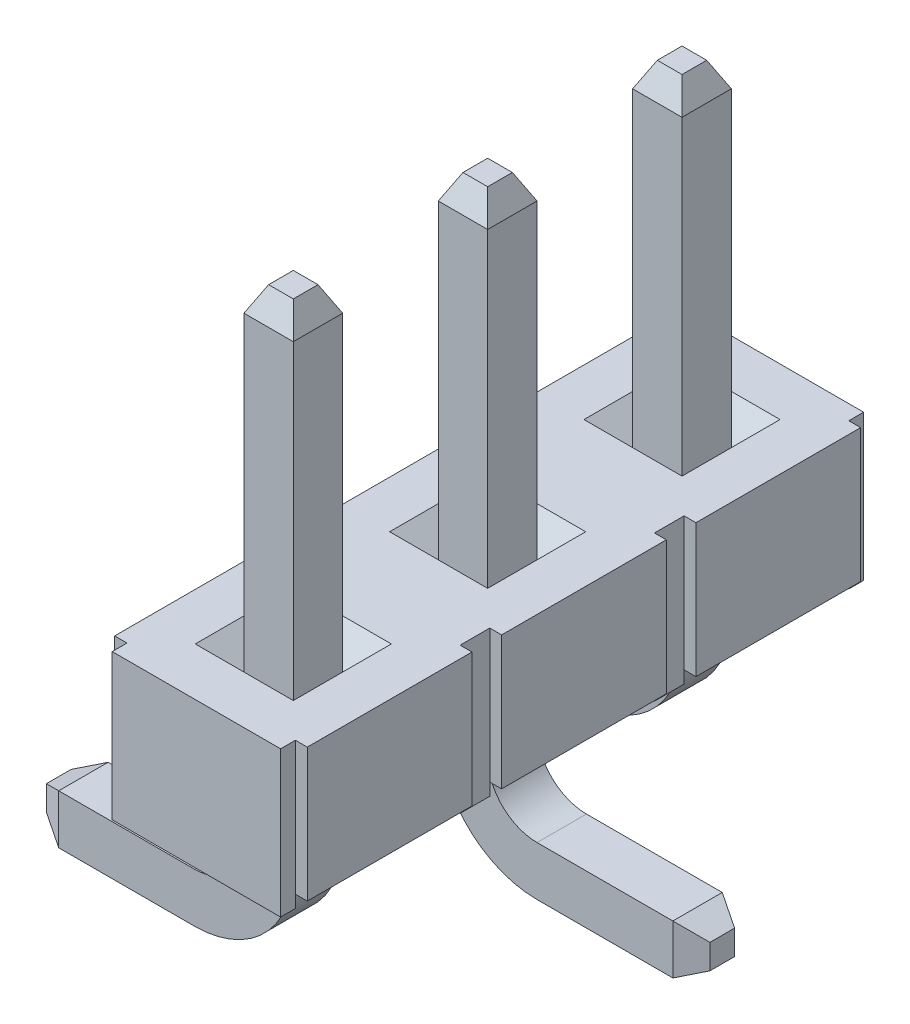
ISO-10303-21;
HEADER;
FILE_DESCRIPTION(('STEP AP214'),'2;1');
FILE_NAME('part.step','',(''),(''),'','','');
FILE_SCHEMA(('AUTOMOTIVE_DESIGN { 1 0 10303 214 1 1 1 1 }'));
ENDSEC;
DATA;
#1=APPLICATION_CONTEXT('core data for automotive mechanical design processes');
#2=APPLICATION_PROTOCOL_DEFINITION('international standard','automotive_design',2000,#1);
#3=PRODUCT_CONTEXT('',#1,'mechanical');
#4=PRODUCT('Part','Part','',(#3));
#5=PRODUCT_RELATED_PRODUCT_CATEGORY('part','',(#4));
#6=PRODUCT_DEFINITION_FORMATION('','',#4);
#7=PRODUCT_DEFINITION_CONTEXT('part definition',#1,'design');
#8=PRODUCT_DEFINITION('design','',#6,#7);
#9=PRODUCT_DEFINITION_SHAPE('','',#8);
#10=(LENGTH_UNIT() NAMED_UNIT(*) SI_UNIT(.MILLI.,.METRE.));
#11=(NAMED_UNIT(*) PLANE_ANGLE_UNIT() SI_UNIT($,.RADIAN.));
#12=(NAMED_UNIT(*) SI_UNIT($,.STERADIAN.) SOLID_ANGLE_UNIT());
#13=UNCERTAINTY_MEASURE_WITH_UNIT(LENGTH_MEASURE(1.E-05),#10,'distance_accuracy_value','');
#14=(GEOMETRIC_REPRESENTATION_CONTEXT(3) GLOBAL_UNCERTAINTY_ASSIGNED_CONTEXT((#13)) GLOBAL_UNIT_ASSIGNED_CONTEXT((#10,
#11,#12)) REPRESENTATION_CONTEXT('',''));
#15=CARTESIAN_POINT('',(0.,0.,0.));
#16=DIRECTION('',(0.,0.,1.));
#17=DIRECTION('',(1.,0.,0.));
#18=AXIS2_PLACEMENT_3D('',#15,#16,#17);
#19=CARTESIAN_POINT('',(-2.413,-0.889,-1.87198));
#20=DIRECTION('',(-0.447213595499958,0.,0.894427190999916));
#21=DIRECTION('',(0.894427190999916,0.,0.447213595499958));
#22=AXIS2_PLACEMENT_3D('',#19,#20,#21);
#23=PLANE('',#22);
#24=DIRECTION('',(-0.816496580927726,-0.408248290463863,-0.408248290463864));
#25=VECTOR('',#24,1.);
#26=CARTESIAN_POINT('',(-2.159,-0.762,-1.74498));
#27=LINE('',#26,#25);
#28=CARTESIAN_POINT('',(-2.159,-0.762,-1.74498));
#29=VERTEX_POINT('',#28);
#30=CARTESIAN_POINT('',(-2.413,-0.889,-1.87198));
#31=VERTEX_POINT('',#30);
#32=EDGE_CURVE('E766',#29,#31,#27,.T.);
#33=ORIENTED_EDGE('',*,*,#32,.T.);
#34=DIRECTION('',(0.,1.,0.));
#35=VECTOR('',#34,1.);
#36=CARTESIAN_POINT('',(-2.413,-0.889,-1.87198));
#37=LINE('',#36,#35);
#38=CARTESIAN_POINT('',(-2.413,-1.143,-1.87198));
#39=VERTEX_POINT('',#38);
#40=EDGE_CURVE('E754',#31,#39,#37,.F.);
#41=ORIENTED_EDGE('',*,*,#40,.T.);
#42=DIRECTION('',(0.816496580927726,-0.408248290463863,0.408248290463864));
#43=VECTOR('',#42,1.);
#44=CARTESIAN_POINT('',(-2.413,-1.143,-1.87198));
#45=LINE('',#44,#43);
#46=CARTESIAN_POINT('',(-2.159,-1.27,-1.74498));
#47=VERTEX_POINT('',#46);
#48=EDGE_CURVE('E745',#39,#47,#45,.T.);
#49=ORIENTED_EDGE('',*,*,#48,.T.);
#50=DIRECTION('',(0.,1.,0.));
#51=VECTOR('',#50,1.);
#52=CARTESIAN_POINT('',(-2.159,-0.254,-1.74498));
#53=LINE('',#52,#51);
#54=EDGE_CURVE('E607',#29,#47,#53,.F.);
#55=ORIENTED_EDGE('',*,*,#54,.F.);
#56=EDGE_LOOP('',(#33,#41,#49,#55));
#57=FACE_BOUND('',#56,.T.);
#58=ADVANCED_FACE('F17',(#57),#23,.T.);
#59=CARTESIAN_POINT('',(2.413,-1.143,0.127));
#60=DIRECTION('',(0.447213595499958,0.,0.894427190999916));
#61=DIRECTION('',(0.894427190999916,0.,-0.447213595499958));
#62=AXIS2_PLACEMENT_3D('',#59,#60,#61);
#63=PLANE('',#62);
#64=DIRECTION('',(0.816496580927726,0.408248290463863,-0.408248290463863));
#65=VECTOR('',#64,1.);
#66=CARTESIAN_POINT('',(2.159,-1.27,0.254));
#67=LINE('',#66,#65);
#68=CARTESIAN_POINT('',(2.159,-1.27,0.254));
#69=VERTEX_POINT('',#68);
#70=CARTESIAN_POINT('',(2.413,-1.143,0.127));
#71=VERTEX_POINT('',#70);
#72=EDGE_CURVE('E721',#69,#71,#67,.T.);
#73=ORIENTED_EDGE('',*,*,#72,.T.);
#74=DIRECTION('',(0.,1.,0.));
#75=VECTOR('',#74,1.);
#76=CARTESIAN_POINT('',(2.413,-1.143,0.127));
#77=LINE('',#76,#75);
#78=CARTESIAN_POINT('',(2.413,-0.889,0.127));
#79=VERTEX_POINT('',#78);
#80=EDGE_CURVE('E709',#71,#79,#77,.T.);
#81=ORIENTED_EDGE('',*,*,#80,.T.);
#82=DIRECTION('',(-0.816496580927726,0.408248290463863,0.408248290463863));
#83=VECTOR('',#82,1.);
#84=CARTESIAN_POINT('',(2.413,-0.889,0.127));
#85=LINE('',#84,#83);
#86=CARTESIAN_POINT('',(2.159,-0.762,0.254));
#87=VERTEX_POINT('',#86);
#88=EDGE_CURVE('E700',#79,#87,#85,.T.);
#89=ORIENTED_EDGE('',*,*,#88,.T.);
#90=DIRECTION('',(0.,1.,0.));
#91=VECTOR('',#90,1.);
#92=CARTESIAN_POINT('',(2.159,-0.254,0.254));
#93=LINE('',#92,#91);
#94=EDGE_CURVE('E695',#69,#87,#93,.T.);
#95=ORIENTED_EDGE('',*,*,#94,.F.);
#96=EDGE_LOOP('',(#73,#81,#89,#95));
#97=FACE_BOUND('',#96,.T.);
#98=ADVANCED_FACE('F2000',(#97),#63,.T.);
#99=CARTESIAN_POINT('',(-2.413,-0.889,2.12598));
#100=DIRECTION('',(-0.447213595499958,0.,0.894427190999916));
#101=DIRECTION('',(0.894427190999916,0.,0.447213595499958));
#102=AXIS2_PLACEMENT_3D('',#99,#100,#101);
#103=PLANE('',#102);
#104=DIRECTION('',(-0.816496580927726,-0.408248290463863,-0.408248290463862));
#105=VECTOR('',#104,1.);
#106=CARTESIAN_POINT('',(-2.159,-0.762,2.25298));
#107=LINE('',#106,#105);
#108=CARTESIAN_POINT('',(-2.159,-0.762,2.25298));
#109=VERTEX_POINT('',#108);
#110=CARTESIAN_POINT('',(-2.413,-0.889,2.12598));
#111=VERTEX_POINT('',#110);
#112=EDGE_CURVE('E669',#109,#111,#107,.T.);
#113=ORIENTED_EDGE('',*,*,#112,.T.);
#114=DIRECTION('',(0.,1.,0.));
#115=VECTOR('',#114,1.);
#116=CARTESIAN_POINT('',(-2.413,-0.889,2.12598));
#117=LINE('',#116,#115);
#118=CARTESIAN_POINT('',(-2.413,-1.143,2.12598));
#119=VERTEX_POINT('',#118);
#120=EDGE_CURVE('E657',#111,#119,#117,.F.);
#121=ORIENTED_EDGE('',*,*,#120,.T.);
#122=DIRECTION('',(0.816496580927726,-0.408248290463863,0.408248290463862));
#123=VECTOR('',#122,1.);
#124=CARTESIAN_POINT('',(-2.413,-1.143,2.12598));
#125=LINE('',#124,#123);
#126=CARTESIAN_POINT('',(-2.159,-1.27,2.25298));
#127=VERTEX_POINT('',#126);
#128=EDGE_CURVE('E648',#119,#127,#125,.T.);
#129=ORIENTED_EDGE('',*,*,#128,.T.);
#130=DIRECTION('',(0.,1.,0.));
#131=VECTOR('',#130,1.);
#132=CARTESIAN_POINT('',(-2.159,-0.254,2.25298));
#133=LINE('',#132,#131);
#134=EDGE_CURVE('E636',#109,#127,#133,.F.);
#135=ORIENTED_EDGE('',*,*,#134,.F.);
#136=EDGE_LOOP('',(#113,#121,#129,#135));
#137=FACE_BOUND('',#136,.T.);
#138=ADVANCED_FACE('F1992',(#137),#103,.T.);
#139=CARTESIAN_POINT('',(-2.159,-0.762,-2.25298));
#140=DIRECTION('',(0.447213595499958,-0.894427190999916,0.));
#141=DIRECTION('',(0.894427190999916,0.447213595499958,0.));
#142=AXIS2_PLACEMENT_3D('',#139,#140,#141);
#143=PLANE('',#142);
#144=ORIENTED_EDGE('',*,*,#32,.F.);
#145=DIRECTION('',(0.,0.,1.));
#146=VECTOR('',#145,1.);
#147=CARTESIAN_POINT('',(-2.159,-0.762,-2.25298));
#148=LINE('',#147,#146);
#149=CARTESIAN_POINT('',(-2.159,-0.762,-2.25298));
#150=VERTEX_POINT('',#149);
#151=EDGE_CURVE('E624',#29,#150,#148,.F.);
#152=ORIENTED_EDGE('',*,*,#151,.T.);
#153=DIRECTION('',(-0.816496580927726,-0.408248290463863,0.408248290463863));
#154=VECTOR('',#153,1.);
#155=CARTESIAN_POINT('',(-2.159,-0.762,-2.25298));
#156=LINE('',#155,#154);
#157=CARTESIAN_POINT('',(-2.413,-0.889,-2.12598));
#158=VERTEX_POINT('',#157);
#159=EDGE_CURVE('E760',#150,#158,#156,.T.);
#160=ORIENTED_EDGE('',*,*,#159,.T.);
#161=DIRECTION('',(0.,0.,-1.));
#162=VECTOR('',#161,1.);
#163=CARTESIAN_POINT('',(-2.413,-0.889,-2.25298));
#164=LINE('',#163,#162);
#165=EDGE_CURVE('E763',#158,#31,#164,.F.);
#166=ORIENTED_EDGE('',*,*,#165,.T.);
#167=EDGE_LOOP('',(#144,#152,#160,#166));
#168=FACE_BOUND('',#167,.T.);
#169=ADVANCED_FACE('F1984',(#168),#143,.F.);
#170=CARTESIAN_POINT('',(-2.413,-0.889,-2.25298));
#171=DIRECTION('',(1.,0.,0.));
#172=DIRECTION('',(0.,0.,-1.));
#173=AXIS2_PLACEMENT_3D('',#170,#171,#172);
#174=PLANE('',#173);
#175=ORIENTED_EDGE('',*,*,#40,.F.);
#176=ORIENTED_EDGE('',*,*,#165,.F.);
#177=DIRECTION('',(0.,1.,0.));
#178=VECTOR('',#177,1.);
#179=CARTESIAN_POINT('',(-2.413,-0.254,-2.12598));
#180=LINE('',#179,#178);
#181=CARTESIAN_POINT('',(-2.413,-1.143,-2.12598));
#182=VERTEX_POINT('',#181);
#183=EDGE_CURVE('E757',#158,#182,#180,.F.);
#184=ORIENTED_EDGE('',*,*,#183,.T.);
#185=DIRECTION('',(0.,0.,1.));
#186=VECTOR('',#185,1.);
#187=CARTESIAN_POINT('',(-2.413,-1.143,-2.25298));
#188=LINE('',#187,#186);
#189=EDGE_CURVE('E749',#182,#39,#188,.T.);
#190=ORIENTED_EDGE('',*,*,#189,.T.);
#191=EDGE_LOOP('',(#175,#176,#184,#190));
#192=FACE_BOUND('',#191,.T.);
#193=ADVANCED_FACE('F1976',(#192),#174,.F.);
#194=CARTESIAN_POINT('',(-2.413,-1.143,-2.25298));
#195=DIRECTION('',(0.447213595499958,0.894427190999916,0.));
#196=DIRECTION('',(-0.894427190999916,0.447213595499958,0.));
#197=AXIS2_PLACEMENT_3D('',#194,#195,#196);
#198=PLANE('',#197);
#199=ORIENTED_EDGE('',*,*,#48,.F.);
#200=ORIENTED_EDGE('',*,*,#189,.F.);
#201=DIRECTION('',(0.816496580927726,-0.408248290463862,-0.408248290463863));
#202=VECTOR('',#201,1.);
#203=CARTESIAN_POINT('',(-2.413,-1.143,-2.12598));
#204=LINE('',#203,#202);
#205=CARTESIAN_POINT('',(-2.159,-1.27,-2.25298));
#206=VERTEX_POINT('',#205);
#207=EDGE_CURVE('E759',#182,#206,#204,.T.);
#208=ORIENTED_EDGE('',*,*,#207,.T.);
#209=DIRECTION('',(0.,0.,1.));
#210=VECTOR('',#209,1.);
#211=CARTESIAN_POINT('',(-2.159,-1.27,-2.25298));
#212=LINE('',#211,#210);
#213=EDGE_CURVE('E741',#206,#47,#212,.T.);
#214=ORIENTED_EDGE('',*,*,#213,.T.);
#215=EDGE_LOOP('',(#199,#200,#208,#214));
#216=FACE_BOUND('',#215,.T.);
#217=ADVANCED_FACE('F1969',(#216),#198,.F.);
#218=CARTESIAN_POINT('',(-0.762,-0.254,-1.74498));
#219=DIRECTION('',(0.,0.,1.));
#220=DIRECTION('',(1.,0.,0.));
#221=AXIS2_PLACEMENT_3D('',#218,#219,#220);
#222=PLANE('',#221);
#223=DIRECTION('',(0.,1.,0.));
#224=VECTOR('',#223,1.);
#225=CARTESIAN_POINT('',(-0.254,-0.254,-1.74498));
#226=LINE('',#225,#224);
#227=CARTESIAN_POINT('',(-0.254,0.25019,-1.74498));
#228=VERTEX_POINT('',#227);
#229=CARTESIAN_POINT('',(-0.254,-0.254,-1.74498));
#230=VERTEX_POINT('',#229);
#231=EDGE_CURVE('E731',#228,#230,#226,.F.);
#232=ORIENTED_EDGE('',*,*,#231,.T.);
#233=CARTESIAN_POINT('',(-0.762,-0.254,-1.74498));
#234=DIRECTION('',(0.,0.,1.));
#235=DIRECTION('',(1.,0.,0.));
#236=AXIS2_PLACEMENT_3D('',#233,#234,#235);
#237=CIRCLE('',#236,0.508);
#238=CARTESIAN_POINT('',(-0.762,-0.762,-1.74498));
#239=VERTEX_POINT('',#238);
#240=EDGE_CURVE('E622',#230,#239,#237,.F.);
#241=ORIENTED_EDGE('',*,*,#240,.T.);
#242=DIRECTION('',(1.,0.,0.));
#243=VECTOR('',#242,1.);
#244=CARTESIAN_POINT('',(-0.762,-0.762,-1.74498));
#245=LINE('',#244,#243);
#246=EDGE_CURVE('E769',#239,#29,#245,.F.);
#247=ORIENTED_EDGE('',*,*,#246,.T.);
#248=ORIENTED_EDGE('',*,*,#54,.T.);
#249=DIRECTION('',(1.,0.,0.));
#250=VECTOR('',#249,1.);
#251=CARTESIAN_POINT('',(-2.159,-1.27,-1.74498));
#252=LINE('',#251,#250);
#253=CARTESIAN_POINT('',(-0.762,-1.27,-1.74498));
#254=VERTEX_POINT('',#253);
#255=EDGE_CURVE('E614',#47,#254,#252,.T.);
#256=ORIENTED_EDGE('',*,*,#255,.T.);
#257=CARTESIAN_POINT('',(-0.762,-0.254,-1.74498));
#258=DIRECTION('',(0.,0.,1.));
#259=DIRECTION('',(1.,0.,0.));
#260=AXIS2_PLACEMENT_3D('',#257,#258,#259);
#261=CIRCLE('',#260,1.016);
#262=CARTESIAN_POINT('',(0.254,-0.254,-1.74498));
#263=VERTEX_POINT('',#262);
#264=EDGE_CURVE('E20',#263,#254,#261,.F.);
#265=ORIENTED_EDGE('',*,*,#264,.F.);
#266=DIRECTION('',(0.,1.,0.));
#267=VECTOR('',#266,1.);
#268=CARTESIAN_POINT('',(0.254,-0.254,-1.74498));
#269=LINE('',#268,#267);
#270=CARTESIAN_POINT('',(0.254,0.25019,-1.74498));
#271=VERTEX_POINT('',#270);
#272=EDGE_CURVE('E595',#263,#271,#269,.T.);
#273=ORIENTED_EDGE('',*,*,#272,.T.);
#274=DIRECTION('',(1.,0.,0.));
#275=VECTOR('',#274,1.);
#276=CARTESIAN_POINT('',(-0.762,0.25019,-1.74498));
#277=LINE('',#276,#275);
#278=EDGE_CURVE('E606',#271,#228,#277,.F.);
#279=ORIENTED_EDGE('',*,*,#278,.T.);
#280=EDGE_LOOP('',(#232,#241,#247,#248,#256,#265,#273,#279));
#281=FACE_BOUND('',#280,.T.);
#282=ADVANCED_FACE('F611',(#281),#222,.T.);
#283=CARTESIAN_POINT('',(2.159,-1.27,-0.254));
#284=DIRECTION('',(-0.447213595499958,0.894427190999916,0.));
#285=DIRECTION('',(-0.894427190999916,-0.447213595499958,0.));
#286=AXIS2_PLACEMENT_3D('',#283,#284,#285);
#287=PLANE('',#286);
#288=ORIENTED_EDGE('',*,*,#72,.F.);
#289=DIRECTION('',(0.,0.,1.));
#290=VECTOR('',#289,1.);
#291=CARTESIAN_POINT('',(2.159,-1.27,-0.254));
#292=LINE('',#291,#290);
#293=CARTESIAN_POINT('',(2.159,-1.27,-0.254));
#294=VERTEX_POINT('',#293);
#295=EDGE_CURVE('E867',#69,#294,#292,.F.);
#296=ORIENTED_EDGE('',*,*,#295,.T.);
#297=DIRECTION('',(0.816496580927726,0.408248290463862,0.408248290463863));
#298=VECTOR('',#297,1.);
#299=CARTESIAN_POINT('',(2.159,-1.27,-0.254));
#300=LINE('',#299,#298);
#301=CARTESIAN_POINT('',(2.413,-1.143,-0.127));
#302=VERTEX_POINT('',#301);
#303=EDGE_CURVE('E715',#294,#302,#300,.T.);
#304=ORIENTED_EDGE('',*,*,#303,.T.);
#305=DIRECTION('',(0.,0.,1.));
#306=VECTOR('',#305,1.);
#307=CARTESIAN_POINT('',(2.413,-1.143,-0.254));
#308=LINE('',#307,#306);
#309=EDGE_CURVE('E718',#302,#71,#308,.T.);
#310=ORIENTED_EDGE('',*,*,#309,.T.);
#311=EDGE_LOOP('',(#288,#296,#304,#310));
#312=FACE_BOUND('',#311,.T.);
#313=ADVANCED_FACE('F1955',(#312),#287,.F.);
#314=CARTESIAN_POINT('',(2.413,-1.143,-0.254));
#315=DIRECTION('',(-1.,0.,0.));
#316=DIRECTION('',(0.,0.,1.));
#317=AXIS2_PLACEMENT_3D('',#314,#315,#316);
#318=PLANE('',#317);
#319=ORIENTED_EDGE('',*,*,#80,.F.);
#320=ORIENTED_EDGE('',*,*,#309,.F.);
#321=DIRECTION('',(0.,1.,0.));
#322=VECTOR('',#321,1.);
#323=CARTESIAN_POINT('',(2.413,-0.254,-0.127));
#324=LINE('',#323,#322);
#325=CARTESIAN_POINT('',(2.413,-0.889,-0.127));
#326=VERTEX_POINT('',#325);
#327=EDGE_CURVE('E712',#302,#326,#324,.T.);
#328=ORIENTED_EDGE('',*,*,#327,.T.);
#329=DIRECTION('',(0.,0.,1.));
#330=VECTOR('',#329,1.);
#331=CARTESIAN_POINT('',(2.413,-0.889,-0.254));
#332=LINE('',#331,#330);
#333=EDGE_CURVE('E704',#326,#79,#332,.T.);
#334=ORIENTED_EDGE('',*,*,#333,.T.);
#335=EDGE_LOOP('',(#319,#320,#328,#334));
#336=FACE_BOUND('',#335,.T.);
#337=ADVANCED_FACE('F1947',(#336),#318,.F.);
#338=CARTESIAN_POINT('',(2.413,-0.889,-0.254));
#339=DIRECTION('',(-0.447213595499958,-0.894427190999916,0.));
#340=DIRECTION('',(0.894427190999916,-0.447213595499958,0.));
#341=AXIS2_PLACEMENT_3D('',#338,#339,#340);
#342=PLANE('',#341);
#343=ORIENTED_EDGE('',*,*,#88,.F.);
#344=ORIENTED_EDGE('',*,*,#333,.F.);
#345=DIRECTION('',(-0.816496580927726,0.408248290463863,-0.408248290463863));
#346=VECTOR('',#345,1.);
#347=CARTESIAN_POINT('',(2.413,-0.889,-0.127));
#348=LINE('',#347,#346);
#349=CARTESIAN_POINT('',(2.159,-0.762,-0.254));
#350=VERTEX_POINT('',#349);
#351=EDGE_CURVE('E714',#326,#350,#348,.T.);
#352=ORIENTED_EDGE('',*,*,#351,.T.);
#353=DIRECTION('',(0.,0.,-1.));
#354=VECTOR('',#353,1.);
#355=CARTESIAN_POINT('',(2.159,-0.762,-0.254));
#356=LINE('',#355,#354);
#357=EDGE_CURVE('E685',#350,#87,#356,.F.);
#358=ORIENTED_EDGE('',*,*,#357,.T.);
#359=EDGE_LOOP('',(#343,#344,#352,#358));
#360=FACE_BOUND('',#359,.T.);
#361=ADVANCED_FACE('F1939',(#360),#342,.F.);
#362=CARTESIAN_POINT('',(0.762,-0.254,0.254));
#363=DIRECTION('',(0.,0.,1.));
#364=DIRECTION('',(1.,0.,0.));
#365=AXIS2_PLACEMENT_3D('',#362,#363,#364);
#366=PLANE('',#365);
#367=DIRECTION('',(0.,1.,0.));
#368=VECTOR('',#367,1.);
#369=CARTESIAN_POINT('',(-0.254,-0.254,0.254));
#370=LINE('',#369,#368);
#371=CARTESIAN_POINT('',(-0.254,0.25019,0.254));
#372=VERTEX_POINT('',#371);
#373=CARTESIAN_POINT('',(-0.254,-0.254,0.254));
#374=VERTEX_POINT('',#373);
#375=EDGE_CURVE('E679',#372,#374,#370,.F.);
#376=ORIENTED_EDGE('',*,*,#375,.T.);
#377=CARTESIAN_POINT('',(0.762,-0.254,0.254));
#378=DIRECTION('',(0.,0.,1.));
#379=DIRECTION('',(1.,0.,0.));
#380=AXIS2_PLACEMENT_3D('',#377,#378,#379);
#381=CIRCLE('',#380,1.016);
#382=CARTESIAN_POINT('',(0.762,-1.27,0.254));
#383=VERTEX_POINT('',#382);
#384=EDGE_CURVE('E740',#383,#374,#381,.F.);
#385=ORIENTED_EDGE('',*,*,#384,.F.);
#386=DIRECTION('',(-1.,0.,0.));
#387=VECTOR('',#386,1.);
#388=CARTESIAN_POINT('',(0.762,-1.27,0.254));
#389=LINE('',#388,#387);
#390=EDGE_CURVE('E724',#383,#69,#389,.F.);
#391=ORIENTED_EDGE('',*,*,#390,.T.);
#392=ORIENTED_EDGE('',*,*,#94,.T.);
#393=DIRECTION('',(1.,0.,0.));
#394=VECTOR('',#393,1.);
#395=CARTESIAN_POINT('',(2.159,-0.762,0.254));
#396=LINE('',#395,#394);
#397=CARTESIAN_POINT('',(0.762,-0.762,0.254));
#398=VERTEX_POINT('',#397);
#399=EDGE_CURVE('E682',#87,#398,#396,.F.);
#400=ORIENTED_EDGE('',*,*,#399,.T.);
#401=CARTESIAN_POINT('',(0.762,-0.254,0.254));
#402=DIRECTION('',(0.,0.,1.));
#403=DIRECTION('',(1.,0.,0.));
#404=AXIS2_PLACEMENT_3D('',#401,#402,#403);
#405=CIRCLE('',#404,0.508);
#406=CARTESIAN_POINT('',(0.253999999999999,-0.254,0.254));
#407=VERTEX_POINT('',#406);
#408=EDGE_CURVE('E684',#398,#407,#405,.F.);
#409=ORIENTED_EDGE('',*,*,#408,.T.);
#410=DIRECTION('',(0.,1.,0.));
#411=VECTOR('',#410,1.);
#412=CARTESIAN_POINT('',(0.254,-0.254,0.254));
#413=LINE('',#412,#411);
#414=CARTESIAN_POINT('',(0.254,0.25019,0.254));
#415=VERTEX_POINT('',#414);
#416=EDGE_CURVE('E692',#407,#415,#413,.T.);
#417=ORIENTED_EDGE('',*,*,#416,.T.);
#418=DIRECTION('',(1.,0.,0.));
#419=VECTOR('',#418,1.);
#420=CARTESIAN_POINT('',(0.762,0.25019,0.254));
#421=LINE('',#420,#419);
#422=EDGE_CURVE('E689',#415,#372,#421,.F.);
#423=ORIENTED_EDGE('',*,*,#422,.T.);
#424=EDGE_LOOP('',(#376,#385,#391,#392,#400,#409,#417,#423));
#425=FACE_BOUND('',#424,.T.);
#426=ADVANCED_FACE('F1931',(#425),#366,.T.);
#427=CARTESIAN_POINT('',(-2.159,-0.762,1.74498));
#428=DIRECTION('',(0.447213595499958,-0.894427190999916,0.));
#429=DIRECTION('',(0.894427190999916,0.447213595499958,0.));
#430=AXIS2_PLACEMENT_3D('',#427,#428,#429);
#431=PLANE('',#430);
#432=ORIENTED_EDGE('',*,*,#112,.F.);
#433=DIRECTION('',(0.,0.,1.));
#434=VECTOR('',#433,1.);
#435=CARTESIAN_POINT('',(-2.159,-0.762,1.74498));
#436=LINE('',#435,#434);
#437=CARTESIAN_POINT('',(-2.159,-0.762,1.74498));
#438=VERTEX_POINT('',#437);
#439=EDGE_CURVE('E859',#109,#438,#436,.F.);
#440=ORIENTED_EDGE('',*,*,#439,.T.);
#441=DIRECTION('',(-0.816496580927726,-0.408248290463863,0.408248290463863));
#442=VECTOR('',#441,1.);
#443=CARTESIAN_POINT('',(-2.159,-0.762,1.74498));
#444=LINE('',#443,#442);
#445=CARTESIAN_POINT('',(-2.413,-0.889,1.87198));
#446=VERTEX_POINT('',#445);
#447=EDGE_CURVE('E663',#438,#446,#444,.T.);
#448=ORIENTED_EDGE('',*,*,#447,.T.);
#449=DIRECTION('',(0.,0.,-1.));
#450=VECTOR('',#449,1.);
#451=CARTESIAN_POINT('',(-2.413,-0.889,1.74498));
#452=LINE('',#451,#450);
#453=EDGE_CURVE('E666',#446,#111,#452,.F.);
#454=ORIENTED_EDGE('',*,*,#453,.T.);
#455=EDGE_LOOP('',(#432,#440,#448,#454));
#456=FACE_BOUND('',#455,.T.);
#457=ADVANCED_FACE('F1923',(#456),#431,.F.);
#458=CARTESIAN_POINT('',(-2.413,-0.889,1.74498));
#459=DIRECTION('',(1.,0.,0.));
#460=DIRECTION('',(0.,0.,-1.));
#461=AXIS2_PLACEMENT_3D('',#458,#459,#460);
#462=PLANE('',#461);
#463=ORIENTED_EDGE('',*,*,#120,.F.);
#464=ORIENTED_EDGE('',*,*,#453,.F.);
#465=DIRECTION('',(0.,1.,0.));
#466=VECTOR('',#465,1.);
#467=CARTESIAN_POINT('',(-2.413,-0.254,1.87198));
#468=LINE('',#467,#466);
#469=CARTESIAN_POINT('',(-2.413,-1.143,1.87198));
#470=VERTEX_POINT('',#469);
#471=EDGE_CURVE('E660',#446,#470,#468,.F.);
#472=ORIENTED_EDGE('',*,*,#471,.T.);
#473=DIRECTION('',(0.,0.,1.));
#474=VECTOR('',#473,1.);
#475=CARTESIAN_POINT('',(-2.413,-1.143,1.74498));
#476=LINE('',#475,#474);
#477=EDGE_CURVE('E652',#470,#119,#476,.T.);
#478=ORIENTED_EDGE('',*,*,#477,.T.);
#479=EDGE_LOOP('',(#463,#464,#472,#478));
#480=FACE_BOUND('',#479,.T.);
#481=ADVANCED_FACE('F1915',(#480),#462,.F.);
#482=CARTESIAN_POINT('',(-2.413,-1.143,1.74498));
#483=DIRECTION('',(0.447213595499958,0.894427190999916,0.));
#484=DIRECTION('',(-0.894427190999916,0.447213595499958,0.));
#485=AXIS2_PLACEMENT_3D('',#482,#483,#484);
#486=PLANE('',#485);
#487=ORIENTED_EDGE('',*,*,#128,.F.);
#488=ORIENTED_EDGE('',*,*,#477,.F.);
#489=DIRECTION('',(0.816496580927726,-0.408248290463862,-0.408248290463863));
#490=VECTOR('',#489,1.);
#491=CARTESIAN_POINT('',(-2.413,-1.143,1.87198));
#492=LINE('',#491,#490);
#493=CARTESIAN_POINT('',(-2.159,-1.27,1.74498));
#494=VERTEX_POINT('',#493);
#495=EDGE_CURVE('E662',#470,#494,#492,.T.);
#496=ORIENTED_EDGE('',*,*,#495,.T.);
#497=DIRECTION('',(0.,0.,1.));
#498=VECTOR('',#497,1.);
#499=CARTESIAN_POINT('',(-2.159,-1.27,1.74498));
#500=LINE('',#499,#498);
#501=EDGE_CURVE('E643',#494,#127,#500,.T.);
#502=ORIENTED_EDGE('',*,*,#501,.T.);
#503=EDGE_LOOP('',(#487,#488,#496,#502));
#504=FACE_BOUND('',#503,.T.);
#505=ADVANCED_FACE('F1907',(#504),#486,.F.);
#506=CARTESIAN_POINT('',(-0.762,-0.254,2.25298));
#507=DIRECTION('',(0.,0.,1.));
#508=DIRECTION('',(1.,0.,0.));
#509=AXIS2_PLACEMENT_3D('',#506,#507,#508);
#510=PLANE('',#509);
#511=DIRECTION('',(0.,1.,0.));
#512=VECTOR('',#511,1.);
#513=CARTESIAN_POINT('',(-0.254,-0.254,2.25298));
#514=LINE('',#513,#512);
#515=CARTESIAN_POINT('',(-0.254,0.25019,2.25298));
#516=VERTEX_POINT('',#515);
#517=CARTESIAN_POINT('',(-0.254,-0.254,2.25298));
#518=VERTEX_POINT('',#517);
#519=EDGE_CURVE('E617',#516,#518,#514,.F.);
#520=ORIENTED_EDGE('',*,*,#519,.T.);
#521=CARTESIAN_POINT('',(-0.762,-0.254,2.25298));
#522=DIRECTION('',(0.,0.,1.));
#523=DIRECTION('',(1.,0.,0.));
#524=AXIS2_PLACEMENT_3D('',#521,#522,#523);
#525=CIRCLE('',#524,0.508);
#526=CARTESIAN_POINT('',(-0.762,-0.762,2.25298));
#527=VERTEX_POINT('',#526);
#528=EDGE_CURVE('E857',#518,#527,#525,.F.);
#529=ORIENTED_EDGE('',*,*,#528,.T.);
#530=DIRECTION('',(1.,0.,0.));
#531=VECTOR('',#530,1.);
#532=CARTESIAN_POINT('',(-0.762,-0.762,2.25298));
#533=LINE('',#532,#531);
#534=EDGE_CURVE('E672',#527,#109,#533,.F.);
#535=ORIENTED_EDGE('',*,*,#534,.T.);
#536=ORIENTED_EDGE('',*,*,#134,.T.);
#537=DIRECTION('',(1.,0.,0.));
#538=VECTOR('',#537,1.);
#539=CARTESIAN_POINT('',(-2.159,-1.27,2.25298));
#540=LINE('',#539,#538);
#541=CARTESIAN_POINT('',(-0.762,-1.27,2.25298));
#542=VERTEX_POINT('',#541);
#543=EDGE_CURVE('E639',#127,#542,#540,.T.);
#544=ORIENTED_EDGE('',*,*,#543,.T.);
#545=CARTESIAN_POINT('',(-0.762,-0.254,2.25298));
#546=DIRECTION('',(0.,0.,1.));
#547=DIRECTION('',(1.,0.,0.));
#548=AXIS2_PLACEMENT_3D('',#545,#546,#547);
#549=CIRCLE('',#548,1.016);
#550=CARTESIAN_POINT('',(0.254,-0.254,2.25298));
#551=VERTEX_POINT('',#550);
#552=EDGE_CURVE('E861',#551,#542,#549,.F.);
#553=ORIENTED_EDGE('',*,*,#552,.F.);
#554=DIRECTION('',(0.,1.,0.));
#555=VECTOR('',#554,1.);
#556=CARTESIAN_POINT('',(0.254,-0.254,2.25298));
#557=LINE('',#556,#555);
#558=CARTESIAN_POINT('',(0.254,0.25019,2.25298));
#559=VERTEX_POINT('',#558);
#560=EDGE_CURVE('E633',#551,#559,#557,.T.);
#561=ORIENTED_EDGE('',*,*,#560,.T.);
#562=DIRECTION('',(1.,0.,0.));
#563=VECTOR('',#562,1.);
#564=CARTESIAN_POINT('',(-0.762,0.25019,2.25298));
#565=LINE('',#564,#563);
#566=EDGE_CURVE('E630',#559,#516,#565,.F.);
#567=ORIENTED_EDGE('',*,*,#566,.T.);
#568=EDGE_LOOP('',(#520,#529,#535,#536,#544,#553,#561,#567));
#569=FACE_BOUND('',#568,.T.);
#570=ADVANCED_FACE('F1899',(#569),#510,.T.);
#571=CARTESIAN_POINT('',(-0.762,4.445,1.74498));
#572=DIRECTION('',(0.,-0.447213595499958,0.894427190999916));
#573=DIRECTION('',(0.,-0.894427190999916,-0.447213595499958));
#574=AXIS2_PLACEMENT_3D('',#571,#572,#573);
#575=PLANE('',#574);
#576=DIRECTION('',(1.,0.,0.));
#577=VECTOR('',#576,1.);
#578=CARTESIAN_POINT('',(-0.127,4.699,1.87198));
#579=LINE('',#578,#577);
#580=CARTESIAN_POINT('',(-0.127,4.699,1.87198));
#581=VERTEX_POINT('',#580);
#582=CARTESIAN_POINT('',(0.127,4.699,1.87198));
#583=VERTEX_POINT('',#582);
#584=EDGE_CURVE('E2063',#581,#583,#579,.T.);
#585=ORIENTED_EDGE('',*,*,#584,.T.);
#586=DIRECTION('',(0.408248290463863,-0.816496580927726,-0.408248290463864));
#587=VECTOR('',#586,1.);
#588=CARTESIAN_POINT('',(0.127,4.699,1.87198));
#589=LINE('',#588,#587);
#590=CARTESIAN_POINT('',(0.254,4.445,1.74498));
#591=VERTEX_POINT('',#590);
#592=EDGE_CURVE('E642',#583,#591,#589,.T.);
#593=ORIENTED_EDGE('',*,*,#592,.T.);
#594=DIRECTION('',(1.,0.,0.));
#595=VECTOR('',#594,1.);
#596=CARTESIAN_POINT('',(-0.762,4.445,1.74498));
#597=LINE('',#596,#595);
#598=CARTESIAN_POINT('',(-0.254,4.445,1.74498));
#599=VERTEX_POINT('',#598);
#600=EDGE_CURVE('E2057',#591,#599,#597,.F.);
#601=ORIENTED_EDGE('',*,*,#600,.T.);
#602=DIRECTION('',(0.408248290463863,0.816496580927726,0.408248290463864));
#603=VECTOR('',#602,1.);
#604=CARTESIAN_POINT('',(-0.254,4.445,1.74498));
#605=LINE('',#604,#603);
#606=EDGE_CURVE('E2055',#599,#581,#605,.T.);
#607=ORIENTED_EDGE('',*,*,#606,.T.);
#608=EDGE_LOOP('',(#585,#593,#601,#607));
#609=FACE_BOUND('',#608,.T.);
#610=ADVANCED_FACE('F1891',(#609),#575,.F.);
#611=CARTESIAN_POINT('',(0.762,4.445,-0.254));
#612=DIRECTION('',(0.,-0.447213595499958,0.894427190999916));
#613=DIRECTION('',(0.,-0.894427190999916,-0.447213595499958));
#614=AXIS2_PLACEMENT_3D('',#611,#612,#613);
#615=PLANE('',#614);
#616=DIRECTION('',(1.,0.,0.));
#617=VECTOR('',#616,1.);
#618=CARTESIAN_POINT('',(-0.127,4.699,-0.127));
#619=LINE('',#618,#617);
#620=CARTESIAN_POINT('',(-0.127,4.699,-0.127));
#621=VERTEX_POINT('',#620);
#622=CARTESIAN_POINT('',(0.127,4.699,-0.127));
#623=VERTEX_POINT('',#622);
#624=EDGE_CURVE('E2049',#621,#623,#619,.T.);
#625=ORIENTED_EDGE('',*,*,#624,.T.);
#626=DIRECTION('',(0.408248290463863,-0.816496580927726,-0.408248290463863));
#627=VECTOR('',#626,1.);
#628=CARTESIAN_POINT('',(0.127,4.699,-0.127));
#629=LINE('',#628,#627);
#630=CARTESIAN_POINT('',(0.254,4.445,-0.254));
#631=VERTEX_POINT('',#630);
#632=EDGE_CURVE('E2051',#623,#631,#629,.T.);
#633=ORIENTED_EDGE('',*,*,#632,.T.);
#634=DIRECTION('',(1.,0.,0.));
#635=VECTOR('',#634,1.);
#636=CARTESIAN_POINT('',(0.762,4.445,-0.254));
#637=LINE('',#636,#635);
#638=CARTESIAN_POINT('',(-0.254,4.445,-0.254));
#639=VERTEX_POINT('',#638);
#640=EDGE_CURVE('E2043',#631,#639,#637,.F.);
#641=ORIENTED_EDGE('',*,*,#640,.T.);
#642=DIRECTION('',(0.408248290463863,0.816496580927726,0.408248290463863));
#643=VECTOR('',#642,1.);
#644=CARTESIAN_POINT('',(-0.254,4.445,-0.254));
#645=LINE('',#644,#643);
#646=EDGE_CURVE('E2041',#639,#621,#645,.T.);
#647=ORIENTED_EDGE('',*,*,#646,.T.);
#648=EDGE_LOOP('',(#625,#633,#641,#647));
#649=FACE_BOUND('',#648,.T.);
#650=ADVANCED_FACE('F1884',(#649),#615,.F.);
#651=CARTESIAN_POINT('',(-0.762,-0.254,-2.25298));
#652=DIRECTION('',(0.,0.,1.));
#653=DIRECTION('',(1.,0.,0.));
#654=AXIS2_PLACEMENT_3D('',#651,#652,#653);
#655=CYLINDRICAL_SURFACE('',#654,1.016);
#656=CARTESIAN_POINT('',(-0.762,-0.254,-2.25298));
#657=DIRECTION('',(0.,0.,1.));
#658=DIRECTION('',(1.,0.,0.));
#659=AXIS2_PLACEMENT_3D('',#656,#657,#658);
#660=CIRCLE('',#659,1.016);
#661=CARTESIAN_POINT('',(-0.762,-1.27,-2.25298));
#662=VERTEX_POINT('',#661);
#663=CARTESIAN_POINT('',(0.253999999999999,-0.254,-2.25298));
#664=VERTEX_POINT('',#663);
#665=EDGE_CURVE('E620',#662,#664,#660,.T.);
#666=ORIENTED_EDGE('',*,*,#665,.T.);
#667=DIRECTION('',(0.,0.,1.));
#668=VECTOR('',#667,1.);
#669=CARTESIAN_POINT('',(0.254,-0.254,-2.25298));
#670=LINE('',#669,#668);
#671=EDGE_CURVE('E600',#664,#263,#670,.T.);
#672=ORIENTED_EDGE('',*,*,#671,.T.);
#673=ORIENTED_EDGE('',*,*,#264,.T.);
#674=DIRECTION('',(0.,0.,1.));
#675=VECTOR('',#674,1.);
#676=CARTESIAN_POINT('',(-0.762,-1.27,-2.25298));
#677=LINE('',#676,#675);
#678=EDGE_CURVE('E911',#254,#662,#677,.F.);
#679=ORIENTED_EDGE('',*,*,#678,.T.);
#680=EDGE_LOOP('',(#666,#672,#673,#679));
#681=FACE_BOUND('',#680,.T.);
#682=ADVANCED_FACE('F618',(#681),#655,.T.);
#683=CARTESIAN_POINT('',(-0.762,-0.254,-2.25298));
#684=DIRECTION('',(0.,0.,1.));
#685=DIRECTION('',(1.,0.,0.));
#686=AXIS2_PLACEMENT_3D('',#683,#684,#685);
#687=CYLINDRICAL_SURFACE('',#686,0.508);
#688=CARTESIAN_POINT('',(-0.762,-0.254,-2.25298));
#689=DIRECTION('',(0.,0.,1.));
#690=DIRECTION('',(1.,0.,0.));
#691=AXIS2_PLACEMENT_3D('',#688,#689,#690);
#692=CIRCLE('',#691,0.508);
#693=CARTESIAN_POINT('',(-0.254,-0.254,-2.25298));
#694=VERTEX_POINT('',#693);
#695=CARTESIAN_POINT('',(-0.762,-0.762,-2.25298));
#696=VERTEX_POINT('',#695);
#697=EDGE_CURVE('E851',#694,#696,#692,.F.);
#698=ORIENTED_EDGE('',*,*,#697,.T.);
#699=DIRECTION('',(0.,0.,1.));
#700=VECTOR('',#699,1.);
#701=CARTESIAN_POINT('',(-0.762,-0.762,-2.25298));
#702=LINE('',#701,#700);
#703=EDGE_CURVE('E772',#696,#239,#702,.T.);
#704=ORIENTED_EDGE('',*,*,#703,.T.);
#705=ORIENTED_EDGE('',*,*,#240,.F.);
#706=DIRECTION('',(0.,0.,-1.));
#707=VECTOR('',#706,1.);
#708=CARTESIAN_POINT('',(-0.254,-0.254,-2.25298));
#709=LINE('',#708,#707);
#710=EDGE_CURVE('E856',#230,#694,#709,.T.);
#711=ORIENTED_EDGE('',*,*,#710,.T.);
#712=EDGE_LOOP('',(#698,#704,#705,#711));
#713=FACE_BOUND('',#712,.T.);
#714=ADVANCED_FACE('F973',(#713),#687,.F.);
#715=CARTESIAN_POINT('',(-0.762,-0.762,-2.25298));
#716=DIRECTION('',(0.,-1.,0.));
#717=DIRECTION('',(1.,0.,0.));
#718=AXIS2_PLACEMENT_3D('',#715,#716,#717);
#719=PLANE('',#718);
#720=ORIENTED_EDGE('',*,*,#703,.F.);
#721=DIRECTION('',(1.,0.,0.));
#722=VECTOR('',#721,1.);
#723=CARTESIAN_POINT('',(-0.762,-0.762,-2.25298));
#724=LINE('',#723,#722);
#725=EDGE_CURVE('E853',#696,#150,#724,.F.);
#726=ORIENTED_EDGE('',*,*,#725,.T.);
#727=ORIENTED_EDGE('',*,*,#151,.F.);
#728=ORIENTED_EDGE('',*,*,#246,.F.);
#729=EDGE_LOOP('',(#720,#726,#727,#728));
#730=FACE_BOUND('',#729,.T.);
#731=ADVANCED_FACE('F1863',(#730),#719,.F.);
#732=CARTESIAN_POINT('',(-2.159,-0.254,-2.25298));
#733=DIRECTION('',(0.447213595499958,0.,0.894427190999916));
#734=DIRECTION('',(0.894427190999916,0.,-0.447213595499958));
#735=AXIS2_PLACEMENT_3D('',#732,#733,#734);
#736=PLANE('',#735);
#737=ORIENTED_EDGE('',*,*,#183,.F.);
#738=ORIENTED_EDGE('',*,*,#159,.F.);
#739=DIRECTION('',(0.,1.,0.));
#740=VECTOR('',#739,1.);
#741=CARTESIAN_POINT('',(-2.159,-0.254,-2.25298));
#742=LINE('',#741,#740);
#743=EDGE_CURVE('E917',#150,#206,#742,.F.);
#744=ORIENTED_EDGE('',*,*,#743,.T.);
#745=ORIENTED_EDGE('',*,*,#207,.F.);
#746=EDGE_LOOP('',(#737,#738,#744,#745));
#747=FACE_BOUND('',#746,.T.);
#748=ADVANCED_FACE('F1855',(#747),#736,.F.);
#749=CARTESIAN_POINT('',(-2.159,-1.27,-2.25298));
#750=DIRECTION('',(0.,1.,0.));
#751=DIRECTION('',(0.,0.,1.));
#752=AXIS2_PLACEMENT_3D('',#749,#750,#751);
#753=PLANE('',#752);
#754=ORIENTED_EDGE('',*,*,#213,.F.);
#755=DIRECTION('',(1.,0.,0.));
#756=VECTOR('',#755,1.);
#757=CARTESIAN_POINT('',(-0.762,-1.27,-2.25298));
#758=LINE('',#757,#756);
#759=EDGE_CURVE('E895',#206,#662,#758,.T.);
#760=ORIENTED_EDGE('',*,*,#759,.T.);
#761=ORIENTED_EDGE('',*,*,#678,.F.);
#762=ORIENTED_EDGE('',*,*,#255,.F.);
#763=EDGE_LOOP('',(#754,#760,#761,#762));
#764=FACE_BOUND('',#763,.T.);
#765=ADVANCED_FACE('F1848',(#764),#753,.F.);
#766=CARTESIAN_POINT('',(0.762,-0.254,-0.254));
#767=DIRECTION('',(0.,0.,1.));
#768=DIRECTION('',(1.,0.,0.));
#769=AXIS2_PLACEMENT_3D('',#766,#767,#768);
#770=CYLINDRICAL_SURFACE('',#769,1.016);
#771=CARTESIAN_POINT('',(0.762,-0.254,-0.254));
#772=DIRECTION('',(0.,0.,1.));
#773=DIRECTION('',(1.,0.,0.));
#774=AXIS2_PLACEMENT_3D('',#771,#772,#773);
#775=CIRCLE('',#774,1.016);
#776=CARTESIAN_POINT('',(-0.254,-0.254,-0.254));
#777=VERTEX_POINT('',#776);
#778=CARTESIAN_POINT('',(0.762,-1.27,-0.254));
#779=VERTEX_POINT('',#778);
#780=EDGE_CURVE('E844',#777,#779,#775,.T.);
#781=ORIENTED_EDGE('',*,*,#780,.T.);
#782=DIRECTION('',(0.,0.,1.));
#783=VECTOR('',#782,1.);
#784=CARTESIAN_POINT('',(0.762,-1.27,-0.254));
#785=LINE('',#784,#783);
#786=EDGE_CURVE('E727',#779,#383,#785,.T.);
#787=ORIENTED_EDGE('',*,*,#786,.T.);
#788=ORIENTED_EDGE('',*,*,#384,.T.);
#789=DIRECTION('',(0.,0.,-1.));
#790=VECTOR('',#789,1.);
#791=CARTESIAN_POINT('',(-0.254,-0.254,-0.254));
#792=LINE('',#791,#790);
#793=EDGE_CURVE('E850',#374,#777,#792,.T.);
#794=ORIENTED_EDGE('',*,*,#793,.T.);
#795=EDGE_LOOP('',(#781,#787,#788,#794));
#796=FACE_BOUND('',#795,.T.);
#797=ADVANCED_FACE('F1840',(#796),#770,.T.);
#798=CARTESIAN_POINT('',(0.762,-1.27,-0.254));
#799=DIRECTION('',(0.,1.,0.));
#800=DIRECTION('',(-1.,0.,0.));
#801=AXIS2_PLACEMENT_3D('',#798,#799,#800);
#802=PLANE('',#801);
#803=ORIENTED_EDGE('',*,*,#786,.F.);
#804=DIRECTION('',(1.,0.,0.));
#805=VECTOR('',#804,1.);
#806=CARTESIAN_POINT('',(0.762,-1.27,-0.254));
#807=LINE('',#806,#805);
#808=EDGE_CURVE('E846',#779,#294,#807,.T.);
#809=ORIENTED_EDGE('',*,*,#808,.T.);
#810=ORIENTED_EDGE('',*,*,#295,.F.);
#811=ORIENTED_EDGE('',*,*,#390,.F.);
#812=EDGE_LOOP('',(#803,#809,#810,#811));
#813=FACE_BOUND('',#812,.T.);
#814=ADVANCED_FACE('F1832',(#813),#802,.F.);
#815=CARTESIAN_POINT('',(2.159,-0.254,-0.254));
#816=DIRECTION('',(-0.447213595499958,0.,0.894427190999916));
#817=DIRECTION('',(0.894427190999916,0.,0.447213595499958));
#818=AXIS2_PLACEMENT_3D('',#815,#816,#817);
#819=PLANE('',#818);
#820=ORIENTED_EDGE('',*,*,#327,.F.);
#821=ORIENTED_EDGE('',*,*,#303,.F.);
#822=DIRECTION('',(0.,1.,0.));
#823=VECTOR('',#822,1.);
#824=CARTESIAN_POINT('',(2.159,-0.254,-0.254));
#825=LINE('',#824,#823);
#826=EDGE_CURVE('E2145',#294,#350,#825,.T.);
#827=ORIENTED_EDGE('',*,*,#826,.T.);
#828=ORIENTED_EDGE('',*,*,#351,.F.);
#829=EDGE_LOOP('',(#820,#821,#827,#828));
#830=FACE_BOUND('',#829,.T.);
#831=ADVANCED_FACE('F1824',(#830),#819,.F.);
#832=CARTESIAN_POINT('',(2.159,-0.762,-0.254));
#833=DIRECTION('',(0.,-1.,0.));
#834=DIRECTION('',(0.,0.,-1.));
#835=AXIS2_PLACEMENT_3D('',#832,#833,#834);
#836=PLANE('',#835);
#837=ORIENTED_EDGE('',*,*,#357,.F.);
#838=DIRECTION('',(1.,0.,0.));
#839=VECTOR('',#838,1.);
#840=CARTESIAN_POINT('',(0.762,-0.762,-0.254));
#841=LINE('',#840,#839);
#842=CARTESIAN_POINT('',(0.762,-0.762,-0.254));
#843=VERTEX_POINT('',#842);
#844=EDGE_CURVE('E2124',#350,#843,#841,.F.);
#845=ORIENTED_EDGE('',*,*,#844,.T.);
#846=DIRECTION('',(0.,0.,1.));
#847=VECTOR('',#846,1.);
#848=CARTESIAN_POINT('',(0.762,-0.762,-0.254));
#849=LINE('',#848,#847);
#850=EDGE_CURVE('E863',#843,#398,#849,.T.);
#851=ORIENTED_EDGE('',*,*,#850,.T.);
#852=ORIENTED_EDGE('',*,*,#399,.F.);
#853=EDGE_LOOP('',(#837,#845,#851,#852));
#854=FACE_BOUND('',#853,.T.);
#855=ADVANCED_FACE('F1816',(#854),#836,.F.);
#856=CARTESIAN_POINT('',(0.762,-0.254,-0.254));
#857=DIRECTION('',(0.,0.,1.));
#858=DIRECTION('',(1.,0.,0.));
#859=AXIS2_PLACEMENT_3D('',#856,#857,#858);
#860=CYLINDRICAL_SURFACE('',#859,0.508);
#861=CARTESIAN_POINT('',(0.762,-0.254,-0.254));
#862=DIRECTION('',(0.,0.,1.));
#863=DIRECTION('',(1.,0.,0.));
#864=AXIS2_PLACEMENT_3D('',#861,#862,#863);
#865=CIRCLE('',#864,0.508);
#866=CARTESIAN_POINT('',(0.253999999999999,-0.254,-0.254));
#867=VERTEX_POINT('',#866);
#868=EDGE_CURVE('E848',#843,#867,#865,.F.);
#869=ORIENTED_EDGE('',*,*,#868,.T.);
#870=DIRECTION('',(0.,0.,1.));
#871=VECTOR('',#870,1.);
#872=CARTESIAN_POINT('',(0.253999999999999,-0.254,-0.254));
#873=LINE('',#872,#871);
#874=EDGE_CURVE('E2123',#867,#407,#873,.T.);
#875=ORIENTED_EDGE('',*,*,#874,.T.);
#876=ORIENTED_EDGE('',*,*,#408,.F.);
#877=ORIENTED_EDGE('',*,*,#850,.F.);
#878=EDGE_LOOP('',(#869,#875,#876,#877));
#879=FACE_BOUND('',#878,.T.);
#880=ADVANCED_FACE('F1808',(#879),#860,.F.);
#881=CARTESIAN_POINT('',(-0.762,-0.254,1.74498));
#882=DIRECTION('',(0.,0.,1.));
#883=DIRECTION('',(1.,0.,0.));
#884=AXIS2_PLACEMENT_3D('',#881,#882,#883);
#885=CYLINDRICAL_SURFACE('',#884,1.016);
#886=CARTESIAN_POINT('',(-0.762,-0.254,1.74498));
#887=DIRECTION('',(0.,0.,1.));
#888=DIRECTION('',(1.,0.,0.));
#889=AXIS2_PLACEMENT_3D('',#886,#887,#888);
#890=CIRCLE('',#889,1.016);
#891=CARTESIAN_POINT('',(-0.762,-1.27,1.74498));
#892=VERTEX_POINT('',#891);
#893=CARTESIAN_POINT('',(0.253999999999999,-0.254,1.74498));
#894=VERTEX_POINT('',#893);
#895=EDGE_CURVE('E840',#892,#894,#890,.T.);
#896=ORIENTED_EDGE('',*,*,#895,.T.);
#897=DIRECTION('',(0.,0.,1.));
#898=VECTOR('',#897,1.);
#899=CARTESIAN_POINT('',(0.254,-0.254,1.74498));
#900=LINE('',#899,#898);
#901=EDGE_CURVE('E860',#894,#551,#900,.T.);
#902=ORIENTED_EDGE('',*,*,#901,.T.);
#903=ORIENTED_EDGE('',*,*,#552,.T.);
#904=DIRECTION('',(0.,0.,1.));
#905=VECTOR('',#904,1.);
#906=CARTESIAN_POINT('',(-0.762,-1.27,1.74498));
#907=LINE('',#906,#905);
#908=EDGE_CURVE('E2087',#542,#892,#907,.F.);
#909=ORIENTED_EDGE('',*,*,#908,.T.);
#910=EDGE_LOOP('',(#896,#902,#903,#909));
#911=FACE_BOUND('',#910,.T.);
#912=ADVANCED_FACE('F1800',(#911),#885,.T.);
#913=CARTESIAN_POINT('',(-0.762,-0.254,1.74498));
#914=DIRECTION('',(0.,0.,1.));
#915=DIRECTION('',(1.,0.,0.));
#916=AXIS2_PLACEMENT_3D('',#913,#914,#915);
#917=CYLINDRICAL_SURFACE('',#916,0.508);
#918=CARTESIAN_POINT('',(-0.762,-0.254,1.74498));
#919=DIRECTION('',(0.,0.,1.));
#920=DIRECTION('',(1.,0.,0.));
#921=AXIS2_PLACEMENT_3D('',#918,#919,#920);
#922=CIRCLE('',#921,0.508);
#923=CARTESIAN_POINT('',(-0.254,-0.254,1.74498));
#924=VERTEX_POINT('',#923);
#925=CARTESIAN_POINT('',(-0.762,-0.762,1.74498));
#926=VERTEX_POINT('',#925);
#927=EDGE_CURVE('E836',#924,#926,#922,.F.);
#928=ORIENTED_EDGE('',*,*,#927,.T.);
#929=DIRECTION('',(0.,0.,1.));
#930=VECTOR('',#929,1.);
#931=CARTESIAN_POINT('',(-0.762,-0.762,1.74498));
#932=LINE('',#931,#930);
#933=EDGE_CURVE('E675',#926,#527,#932,.T.);
#934=ORIENTED_EDGE('',*,*,#933,.T.);
#935=ORIENTED_EDGE('',*,*,#528,.F.);
#936=DIRECTION('',(0.,0.,-1.));
#937=VECTOR('',#936,1.);
#938=CARTESIAN_POINT('',(-0.254,-0.254,1.74498));
#939=LINE('',#938,#937);
#940=EDGE_CURVE('E843',#518,#924,#939,.T.);
#941=ORIENTED_EDGE('',*,*,#940,.T.);
#942=EDGE_LOOP('',(#928,#934,#935,#941));
#943=FACE_BOUND('',#942,.T.);
#944=ADVANCED_FACE('F1792',(#943),#917,.F.);
#945=CARTESIAN_POINT('',(-0.762,-0.762,1.74498));
#946=DIRECTION('',(0.,-1.,0.));
#947=DIRECTION('',(1.,0.,0.));
#948=AXIS2_PLACEMENT_3D('',#945,#946,#947);
#949=PLANE('',#948);
#950=ORIENTED_EDGE('',*,*,#933,.F.);
#951=DIRECTION('',(1.,0.,0.));
#952=VECTOR('',#951,1.);
#953=CARTESIAN_POINT('',(-0.762,-0.762,1.74498));
#954=LINE('',#953,#952);
#955=EDGE_CURVE('E838',#926,#438,#954,.F.);
#956=ORIENTED_EDGE('',*,*,#955,.T.);
#957=ORIENTED_EDGE('',*,*,#439,.F.);
#958=ORIENTED_EDGE('',*,*,#534,.F.);
#959=EDGE_LOOP('',(#950,#956,#957,#958));
#960=FACE_BOUND('',#959,.T.);
#961=ADVANCED_FACE('F1784',(#960),#949,.F.);
#962=CARTESIAN_POINT('',(-2.159,-0.254,1.74498));
#963=DIRECTION('',(0.447213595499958,0.,0.894427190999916));
#964=DIRECTION('',(0.894427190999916,0.,-0.447213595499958));
#965=AXIS2_PLACEMENT_3D('',#962,#963,#964);
#966=PLANE('',#965);
#967=ORIENTED_EDGE('',*,*,#471,.F.);
#968=ORIENTED_EDGE('',*,*,#447,.F.);
#969=DIRECTION('',(0.,1.,0.));
#970=VECTOR('',#969,1.);
#971=CARTESIAN_POINT('',(-2.159,-0.254,1.74498));
#972=LINE('',#971,#970);
#973=EDGE_CURVE('E2093',#438,#494,#972,.F.);
#974=ORIENTED_EDGE('',*,*,#973,.T.);
#975=ORIENTED_EDGE('',*,*,#495,.F.);
#976=EDGE_LOOP('',(#967,#968,#974,#975));
#977=FACE_BOUND('',#976,.T.);
#978=ADVANCED_FACE('F1776',(#977),#966,.F.);
#979=CARTESIAN_POINT('',(-2.159,-1.27,1.74498));
#980=DIRECTION('',(0.,1.,0.));
#981=DIRECTION('',(0.,0.,1.));
#982=AXIS2_PLACEMENT_3D('',#979,#980,#981);
#983=PLANE('',#982);
#984=ORIENTED_EDGE('',*,*,#501,.F.);
#985=DIRECTION('',(1.,0.,0.));
#986=VECTOR('',#985,1.);
#987=CARTESIAN_POINT('',(-0.762,-1.27,1.74498));
#988=LINE('',#987,#986);
#989=EDGE_CURVE('E2070',#494,#892,#988,.T.);
#990=ORIENTED_EDGE('',*,*,#989,.T.);
#991=ORIENTED_EDGE('',*,*,#908,.F.);
#992=ORIENTED_EDGE('',*,*,#543,.F.);
#993=EDGE_LOOP('',(#984,#990,#991,#992));
#994=FACE_BOUND('',#993,.T.);
#995=ADVANCED_FACE('F1768',(#994),#983,.F.);
#996=CARTESIAN_POINT('',(-0.762,4.445,-2.25298));
#997=DIRECTION('',(0.,-0.447213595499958,0.894427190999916));
#998=DIRECTION('',(0.,-0.894427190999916,-0.447213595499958));
#999=AXIS2_PLACEMENT_3D('',#996,#997,#998);
#1000=PLANE('',#999);
#1001=DIRECTION('',(1.,0.,0.));
#1002=VECTOR('',#1001,1.);
#1003=CARTESIAN_POINT('',(-0.127,4.699,-2.12598));
#1004=LINE('',#1003,#1002);
#1005=CARTESIAN_POINT('',(-0.127,4.699,-2.12598));
#1006=VERTEX_POINT('',#1005);
#1007=CARTESIAN_POINT('',(0.127,4.699,-2.12598));
#1008=VERTEX_POINT('',#1007);
#1009=EDGE_CURVE('E2198',#1006,#1008,#1004,.T.);
#1010=ORIENTED_EDGE('',*,*,#1009,.T.);
#1011=DIRECTION('',(0.408248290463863,-0.816496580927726,-0.408248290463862));
#1012=VECTOR('',#1011,1.);
#1013=CARTESIAN_POINT('',(0.127,4.699,-2.12598));
#1014=LINE('',#1013,#1012);
#1015=CARTESIAN_POINT('',(0.254,4.445,-2.25298));
#1016=VERTEX_POINT('',#1015);
#1017=EDGE_CURVE('E2196',#1008,#1016,#1014,.T.);
#1018=ORIENTED_EDGE('',*,*,#1017,.T.);
#1019=DIRECTION('',(1.,0.,0.));
#1020=VECTOR('',#1019,1.);
#1021=CARTESIAN_POINT('',(-0.762,4.445,-2.25298));
#1022=LINE('',#1021,#1020);
#1023=CARTESIAN_POINT('',(-0.254,4.445,-2.25298));
#1024=VERTEX_POINT('',#1023);
#1025=EDGE_CURVE('E2204',#1016,#1024,#1022,.F.);
#1026=ORIENTED_EDGE('',*,*,#1025,.T.);
#1027=DIRECTION('',(0.408248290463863,0.816496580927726,0.408248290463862));
#1028=VECTOR('',#1027,1.);
#1029=CARTESIAN_POINT('',(-0.254,4.445,-2.25298));
#1030=LINE('',#1029,#1028);
#1031=EDGE_CURVE('E2206',#1024,#1006,#1030,.T.);
#1032=ORIENTED_EDGE('',*,*,#1031,.T.);
#1033=EDGE_LOOP('',(#1010,#1018,#1026,#1032));
#1034=FACE_BOUND('',#1033,.T.);
#1035=ADVANCED_FACE('F1760',(#1034),#1000,.F.);
#1036=CARTESIAN_POINT('',(0.254,4.445,1.74498));
#1037=DIRECTION('',(-0.894427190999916,-0.447213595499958,0.));
#1038=DIRECTION('',(0.447213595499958,-0.894427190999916,0.));
#1039=AXIS2_PLACEMENT_3D('',#1036,#1037,#1038);
#1040=PLANE('',#1039);
#1041=ORIENTED_EDGE('',*,*,#592,.F.);
#1042=DIRECTION('',(0.,0.,-1.));
#1043=VECTOR('',#1042,1.);
#1044=CARTESIAN_POINT('',(0.127,4.699,1.74498));
#1045=LINE('',#1044,#1043);
#1046=CARTESIAN_POINT('',(0.127,4.699,2.12598));
#1047=VERTEX_POINT('',#1046);
#1048=EDGE_CURVE('E2061',#583,#1047,#1045,.F.);
#1049=ORIENTED_EDGE('',*,*,#1048,.T.);
#1050=DIRECTION('',(-0.408248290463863,0.816496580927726,-0.408248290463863));
#1051=VECTOR('',#1050,1.);
#1052=CARTESIAN_POINT('',(0.254,4.445,2.25298));
#1053=LINE('',#1052,#1051);
#1054=CARTESIAN_POINT('',(0.254,4.445,2.25298));
#1055=VERTEX_POINT('',#1054);
#1056=EDGE_CURVE('E2221',#1055,#1047,#1053,.T.);
#1057=ORIENTED_EDGE('',*,*,#1056,.F.);
#1058=DIRECTION('',(0.,0.,1.));
#1059=VECTOR('',#1058,1.);
#1060=CARTESIAN_POINT('',(0.254,4.445,1.74498));
#1061=LINE('',#1060,#1059);
#1062=EDGE_CURVE('E2210',#1055,#591,#1061,.F.);
#1063=ORIENTED_EDGE('',*,*,#1062,.T.);
#1064=EDGE_LOOP('',(#1041,#1049,#1057,#1063));
#1065=FACE_BOUND('',#1064,.T.);
#1066=ADVANCED_FACE('F1752',(#1065),#1040,.F.);
#1067=CARTESIAN_POINT('',(-0.127,4.699,1.74498));
#1068=DIRECTION('',(0.,-1.,0.));
#1069=DIRECTION('',(0.,0.,-1.));
#1070=AXIS2_PLACEMENT_3D('',#1067,#1068,#1069);
#1071=PLANE('',#1070);
#1072=ORIENTED_EDGE('',*,*,#584,.F.);
#1073=DIRECTION('',(0.,0.,1.));
#1074=VECTOR('',#1073,1.);
#1075=CARTESIAN_POINT('',(-0.127,4.699,1.74498));
#1076=LINE('',#1075,#1074);
#1077=CARTESIAN_POINT('',(-0.127,4.699,2.12598));
#1078=VERTEX_POINT('',#1077);
#1079=EDGE_CURVE('E2053',#581,#1078,#1076,.T.);
#1080=ORIENTED_EDGE('',*,*,#1079,.T.);
#1081=DIRECTION('',(1.,0.,0.));
#1082=VECTOR('',#1081,1.);
#1083=CARTESIAN_POINT('',(-0.127,4.699,2.12598));
#1084=LINE('',#1083,#1082);
#1085=EDGE_CURVE('E2224',#1047,#1078,#1084,.F.);
#1086=ORIENTED_EDGE('',*,*,#1085,.F.);
#1087=ORIENTED_EDGE('',*,*,#1048,.F.);
#1088=EDGE_LOOP('',(#1072,#1080,#1086,#1087));
#1089=FACE_BOUND('',#1088,.T.);
#1090=ADVANCED_FACE('F1744',(#1089),#1071,.F.);
#1091=CARTESIAN_POINT('',(-0.762,-0.254,1.74498));
#1092=DIRECTION('',(0.,0.,1.));
#1093=DIRECTION('',(1.,0.,0.));
#1094=AXIS2_PLACEMENT_3D('',#1091,#1092,#1093);
#1095=PLANE('',#1094);
#1096=ORIENTED_EDGE('',*,*,#600,.F.);
#1097=DIRECTION('',(0.,-1.,0.));
#1098=VECTOR('',#1097,1.);
#1099=CARTESIAN_POINT('',(0.254,4.445,1.74498));
#1100=LINE('',#1099,#1098);
#1101=CARTESIAN_POINT('',(0.254,1.24841,1.74498));
#1102=VERTEX_POINT('',#1101);
#1103=EDGE_CURVE('E2213',#591,#1102,#1100,.T.);
#1104=ORIENTED_EDGE('',*,*,#1103,.T.);
#1105=DIRECTION('',(1.,0.,0.));
#1106=VECTOR('',#1105,1.);
#1107=CARTESIAN_POINT('',(-0.762,1.24841,1.74498));
#1108=LINE('',#1107,#1106);
#1109=CARTESIAN_POINT('',(-0.254,1.24841,1.74498));
#1110=VERTEX_POINT('',#1109);
#1111=EDGE_CURVE('E2059',#1110,#1102,#1108,.T.);
#1112=ORIENTED_EDGE('',*,*,#1111,.F.);
#1113=DIRECTION('',(0.,1.,0.));
#1114=VECTOR('',#1113,1.);
#1115=CARTESIAN_POINT('',(-0.254,-0.254,1.74498));
#1116=LINE('',#1115,#1114);
#1117=EDGE_CURVE('E2227',#1110,#599,#1116,.T.);
#1118=ORIENTED_EDGE('',*,*,#1117,.T.);
#1119=EDGE_LOOP('',(#1096,#1104,#1112,#1118));
#1120=FACE_BOUND('',#1119,.T.);
#1121=ADVANCED_FACE('F1736',(#1120),#1095,.F.);
#1122=CARTESIAN_POINT('',(-0.254,4.445,1.74498));
#1123=DIRECTION('',(0.894427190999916,-0.447213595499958,0.));
#1124=DIRECTION('',(0.447213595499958,0.894427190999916,0.));
#1125=AXIS2_PLACEMENT_3D('',#1122,#1123,#1124);
#1126=PLANE('',#1125);
#1127=ORIENTED_EDGE('',*,*,#606,.F.);
#1128=DIRECTION('',(0.,0.,-1.));
#1129=VECTOR('',#1128,1.);
#1130=CARTESIAN_POINT('',(-0.254,4.445,1.74498));
#1131=LINE('',#1130,#1129);
#1132=CARTESIAN_POINT('',(-0.254,4.445,2.25298));
#1133=VERTEX_POINT('',#1132);
#1134=EDGE_CURVE('E2230',#599,#1133,#1131,.F.);
#1135=ORIENTED_EDGE('',*,*,#1134,.T.);
#1136=DIRECTION('',(-0.408248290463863,-0.816496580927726,0.408248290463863));
#1137=VECTOR('',#1136,1.);
#1138=CARTESIAN_POINT('',(-0.127,4.699,2.12598));
#1139=LINE('',#1138,#1137);
#1140=EDGE_CURVE('E2218',#1078,#1133,#1139,.T.);
#1141=ORIENTED_EDGE('',*,*,#1140,.F.);
#1142=ORIENTED_EDGE('',*,*,#1079,.F.);
#1143=EDGE_LOOP('',(#1127,#1135,#1141,#1142));
#1144=FACE_BOUND('',#1143,.T.);
#1145=ADVANCED_FACE('F1728',(#1144),#1126,.F.);
#1146=CARTESIAN_POINT('',(0.127,4.699,-0.254));
#1147=DIRECTION('',(-0.894427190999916,-0.447213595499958,0.));
#1148=DIRECTION('',(0.447213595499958,-0.894427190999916,0.));
#1149=AXIS2_PLACEMENT_3D('',#1146,#1147,#1148);
#1150=PLANE('',#1149);
#1151=DIRECTION('',(-0.408248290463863,0.816496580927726,-0.408248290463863));
#1152=VECTOR('',#1151,1.);
#1153=CARTESIAN_POINT('',(0.254,4.445,0.254));
#1154=LINE('',#1153,#1152);
#1155=CARTESIAN_POINT('',(0.254,4.445,0.254));
#1156=VERTEX_POINT('',#1155);
#1157=CARTESIAN_POINT('',(0.127,4.699,0.127));
#1158=VERTEX_POINT('',#1157);
#1159=EDGE_CURVE('E2246',#1156,#1158,#1154,.T.);
#1160=ORIENTED_EDGE('',*,*,#1159,.F.);
#1161=DIRECTION('',(0.,0.,1.));
#1162=VECTOR('',#1161,1.);
#1163=CARTESIAN_POINT('',(0.254,4.445,-0.254));
#1164=LINE('',#1163,#1162);
#1165=EDGE_CURVE('E2235',#1156,#631,#1164,.F.);
#1166=ORIENTED_EDGE('',*,*,#1165,.T.);
#1167=ORIENTED_EDGE('',*,*,#632,.F.);
#1168=DIRECTION('',(0.,0.,-1.));
#1169=VECTOR('',#1168,1.);
#1170=CARTESIAN_POINT('',(0.127,4.699,-0.254));
#1171=LINE('',#1170,#1169);
#1172=EDGE_CURVE('E2047',#623,#1158,#1171,.F.);
#1173=ORIENTED_EDGE('',*,*,#1172,.T.);
#1174=EDGE_LOOP('',(#1160,#1166,#1167,#1173));
#1175=FACE_BOUND('',#1174,.T.);
#1176=ADVANCED_FACE('F1720',(#1175),#1150,.F.);
#1177=CARTESIAN_POINT('',(-0.127,4.699,-0.254));
#1178=DIRECTION('',(0.,-1.,0.));
#1179=DIRECTION('',(0.,0.,-1.));
#1180=AXIS2_PLACEMENT_3D('',#1177,#1178,#1179);
#1181=PLANE('',#1180);
#1182=DIRECTION('',(1.,0.,0.));
#1183=VECTOR('',#1182,1.);
#1184=CARTESIAN_POINT('',(-0.127,4.699,0.127));
#1185=LINE('',#1184,#1183);
#1186=CARTESIAN_POINT('',(-0.127,4.699,0.127));
#1187=VERTEX_POINT('',#1186);
#1188=EDGE_CURVE('E2249',#1158,#1187,#1185,.F.);
#1189=ORIENTED_EDGE('',*,*,#1188,.F.);
#1190=ORIENTED_EDGE('',*,*,#1172,.F.);
#1191=ORIENTED_EDGE('',*,*,#624,.F.);
#1192=DIRECTION('',(0.,0.,1.));
#1193=VECTOR('',#1192,1.);
#1194=CARTESIAN_POINT('',(-0.127,4.699,-0.254));
#1195=LINE('',#1194,#1193);
#1196=EDGE_CURVE('E934',#621,#1187,#1195,.T.);
#1197=ORIENTED_EDGE('',*,*,#1196,.T.);
#1198=EDGE_LOOP('',(#1189,#1190,#1191,#1197));
#1199=FACE_BOUND('',#1198,.T.);
#1200=ADVANCED_FACE('F1712',(#1199),#1181,.F.);
#1201=CARTESIAN_POINT('',(0.762,-0.254,-0.254));
#1202=DIRECTION('',(0.,0.,1.));
#1203=DIRECTION('',(1.,0.,0.));
#1204=AXIS2_PLACEMENT_3D('',#1201,#1202,#1203);
#1205=PLANE('',#1204);
#1206=ORIENTED_EDGE('',*,*,#640,.F.);
#1207=DIRECTION('',(0.,-1.,0.));
#1208=VECTOR('',#1207,1.);
#1209=CARTESIAN_POINT('',(0.254,4.445,-0.254));
#1210=LINE('',#1209,#1208);
#1211=CARTESIAN_POINT('',(0.254,1.24841,-0.254));
#1212=VERTEX_POINT('',#1211);
#1213=EDGE_CURVE('E2238',#631,#1212,#1210,.T.);
#1214=ORIENTED_EDGE('',*,*,#1213,.T.);
#1215=DIRECTION('',(1.,0.,0.));
#1216=VECTOR('',#1215,1.);
#1217=CARTESIAN_POINT('',(0.762,1.24841,-0.254));
#1218=LINE('',#1217,#1216);
#1219=CARTESIAN_POINT('',(-0.254,1.24841,-0.254));
#1220=VERTEX_POINT('',#1219);
#1221=EDGE_CURVE('E2045',#1220,#1212,#1218,.T.);
#1222=ORIENTED_EDGE('',*,*,#1221,.F.);
#1223=DIRECTION('',(0.,1.,0.));
#1224=VECTOR('',#1223,1.);
#1225=CARTESIAN_POINT('',(-0.254,-0.254,-0.254));
#1226=LINE('',#1225,#1224);
#1227=EDGE_CURVE('E2252',#1220,#639,#1226,.T.);
#1228=ORIENTED_EDGE('',*,*,#1227,.T.);
#1229=EDGE_LOOP('',(#1206,#1214,#1222,#1228));
#1230=FACE_BOUND('',#1229,.T.);
#1231=ADVANCED_FACE('F986',(#1230),#1205,.F.);
#1232=CARTESIAN_POINT('',(-0.254,4.445,-0.254));
#1233=DIRECTION('',(0.894427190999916,-0.447213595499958,0.));
#1234=DIRECTION('',(0.447213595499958,0.894427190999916,0.));
#1235=AXIS2_PLACEMENT_3D('',#1232,#1233,#1234);
#1236=PLANE('',#1235);
#1237=DIRECTION('',(-0.408248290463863,-0.816496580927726,0.408248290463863));
#1238=VECTOR('',#1237,1.);
#1239=CARTESIAN_POINT('',(-0.127,4.699,0.127));
#1240=LINE('',#1239,#1238);
#1241=CARTESIAN_POINT('',(-0.254,4.445,0.254));
#1242=VERTEX_POINT('',#1241);
#1243=EDGE_CURVE('E2243',#1187,#1242,#1240,.T.);
#1244=ORIENTED_EDGE('',*,*,#1243,.F.);
#1245=ORIENTED_EDGE('',*,*,#1196,.F.);
#1246=ORIENTED_EDGE('',*,*,#646,.F.);
#1247=DIRECTION('',(0.,0.,-1.));
#1248=VECTOR('',#1247,1.);
#1249=CARTESIAN_POINT('',(-0.254,4.445,-0.254));
#1250=LINE('',#1249,#1248);
#1251=EDGE_CURVE('E2255',#639,#1242,#1250,.F.);
#1252=ORIENTED_EDGE('',*,*,#1251,.T.);
#1253=EDGE_LOOP('',(#1244,#1245,#1246,#1252));
#1254=FACE_BOUND('',#1253,.T.);
#1255=ADVANCED_FACE('F978',(#1254),#1236,.F.);
#1256=CARTESIAN_POINT('',(-0.254,-0.254,-2.25298));
#1257=DIRECTION('',(1.,0.,0.));
#1258=DIRECTION('',(0.,0.,-1.));
#1259=AXIS2_PLACEMENT_3D('',#1256,#1257,#1258);
#1260=PLANE('',#1259);
#1261=DIRECTION('',(0.,1.,0.));
#1262=VECTOR('',#1261,1.);
#1263=CARTESIAN_POINT('',(-0.254,-0.254,-2.25298));
#1264=LINE('',#1263,#1262);
#1265=CARTESIAN_POINT('',(-0.254,0.25019,-2.25298));
#1266=VERTEX_POINT('',#1265);
#1267=EDGE_CURVE('E854',#1266,#694,#1264,.F.);
#1268=ORIENTED_EDGE('',*,*,#1267,.T.);
#1269=ORIENTED_EDGE('',*,*,#710,.F.);
#1270=ORIENTED_EDGE('',*,*,#231,.F.);
#1271=DIRECTION('',(0.,0.,1.));
#1272=VECTOR('',#1271,1.);
#1273=CARTESIAN_POINT('',(-0.254,0.25019,-1.74879));
#1274=LINE('',#1273,#1272);
#1275=EDGE_CURVE('E821',#228,#1266,#1274,.F.);
#1276=ORIENTED_EDGE('',*,*,#1275,.T.);
#1277=EDGE_LOOP('',(#1268,#1269,#1270,#1276));
#1278=FACE_BOUND('',#1277,.T.);
#1279=ADVANCED_FACE('F976',(#1278),#1260,.F.);
#1280=CARTESIAN_POINT('',(-0.762,-0.254,-2.25298));
#1281=DIRECTION('',(0.,0.,1.));
#1282=DIRECTION('',(1.,0.,0.));
#1283=AXIS2_PLACEMENT_3D('',#1280,#1281,#1282);
#1284=PLANE('',#1283);
#1285=ORIENTED_EDGE('',*,*,#743,.F.);
#1286=ORIENTED_EDGE('',*,*,#725,.F.);
#1287=ORIENTED_EDGE('',*,*,#697,.F.);
#1288=ORIENTED_EDGE('',*,*,#1267,.F.);
#1289=DIRECTION('',(1.,0.,0.));
#1290=VECTOR('',#1289,1.);
#1291=CARTESIAN_POINT('',(0.25019,0.25019,-2.25298));
#1292=LINE('',#1291,#1290);
#1293=CARTESIAN_POINT('',(0.253999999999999,0.25019,-2.25298));
#1294=VERTEX_POINT('',#1293);
#1295=EDGE_CURVE('E898',#1266,#1294,#1292,.T.);
#1296=ORIENTED_EDGE('',*,*,#1295,.T.);
#1297=DIRECTION('',(0.,-1.,0.));
#1298=VECTOR('',#1297,1.);
#1299=CARTESIAN_POINT('',(0.254,4.445,-2.25298));
#1300=LINE('',#1299,#1298);
#1301=EDGE_CURVE('E882',#1294,#664,#1300,.T.);
#1302=ORIENTED_EDGE('',*,*,#1301,.T.);
#1303=ORIENTED_EDGE('',*,*,#665,.F.);
#1304=ORIENTED_EDGE('',*,*,#759,.F.);
#1305=EDGE_LOOP('',(#1285,#1286,#1287,#1288,#1296,#1302,#1303,#1304));
#1306=FACE_BOUND('',#1305,.T.);
#1307=ADVANCED_FACE('F953',(#1306),#1284,.F.);
#1308=CARTESIAN_POINT('',(0.254,4.445,-2.25298));
#1309=DIRECTION('',(-1.,0.,0.));
#1310=DIRECTION('',(0.,-1.,0.));
#1311=AXIS2_PLACEMENT_3D('',#1308,#1309,#1310);
#1312=PLANE('',#1311);
#1313=ORIENTED_EDGE('',*,*,#272,.F.);
#1314=ORIENTED_EDGE('',*,*,#671,.F.);
#1315=ORIENTED_EDGE('',*,*,#1301,.F.);
#1316=DIRECTION('',(0.,0.,1.));
#1317=VECTOR('',#1316,1.);
#1318=CARTESIAN_POINT('',(0.254,0.25019,-1.74879));
#1319=LINE('',#1318,#1317);
#1320=EDGE_CURVE('E603',#1294,#271,#1319,.T.);
#1321=ORIENTED_EDGE('',*,*,#1320,.T.);
#1322=EDGE_LOOP('',(#1313,#1314,#1315,#1321));
#1323=FACE_BOUND('',#1322,.T.);
#1324=ADVANCED_FACE('F597',(#1323),#1312,.F.);
#1325=CARTESIAN_POINT('',(-0.254,-0.254,-0.254));
#1326=DIRECTION('',(1.,0.,0.));
#1327=DIRECTION('',(0.,0.,-1.));
#1328=AXIS2_PLACEMENT_3D('',#1325,#1326,#1327);
#1329=PLANE('',#1328);
#1330=DIRECTION('',(0.,1.,0.));
#1331=VECTOR('',#1330,1.);
#1332=CARTESIAN_POINT('',(-0.254,-0.254,-0.254));
#1333=LINE('',#1332,#1331);
#1334=CARTESIAN_POINT('',(-0.254,0.25019,-0.254));
#1335=VERTEX_POINT('',#1334);
#1336=EDGE_CURVE('E847',#1335,#777,#1333,.F.);
#1337=ORIENTED_EDGE('',*,*,#1336,.T.);
#1338=ORIENTED_EDGE('',*,*,#793,.F.);
#1339=ORIENTED_EDGE('',*,*,#375,.F.);
#1340=DIRECTION('',(0.,0.,1.));
#1341=VECTOR('',#1340,1.);
#1342=CARTESIAN_POINT('',(-0.254,0.25019,0.25019));
#1343=LINE('',#1342,#1341);
#1344=EDGE_CURVE('E801',#372,#1335,#1343,.F.);
#1345=ORIENTED_EDGE('',*,*,#1344,.T.);
#1346=EDGE_LOOP('',(#1337,#1338,#1339,#1345));
#1347=FACE_BOUND('',#1346,.T.);
#1348=ADVANCED_FACE('F1332',(#1347),#1329,.F.);
#1349=CARTESIAN_POINT('',(0.762,-0.254,-0.254));
#1350=DIRECTION('',(0.,0.,1.));
#1351=DIRECTION('',(1.,0.,0.));
#1352=AXIS2_PLACEMENT_3D('',#1349,#1350,#1351);
#1353=PLANE('',#1352);
#1354=ORIENTED_EDGE('',*,*,#826,.F.);
#1355=ORIENTED_EDGE('',*,*,#808,.F.);
#1356=ORIENTED_EDGE('',*,*,#780,.F.);
#1357=ORIENTED_EDGE('',*,*,#1336,.F.);
#1358=DIRECTION('',(1.,0.,0.));
#1359=VECTOR('',#1358,1.);
#1360=CARTESIAN_POINT('',(0.25019,0.25019,-0.254));
#1361=LINE('',#1360,#1359);
#1362=CARTESIAN_POINT('',(0.253999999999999,0.25019,-0.254));
#1363=VERTEX_POINT('',#1362);
#1364=EDGE_CURVE('E889',#1335,#1363,#1361,.T.);
#1365=ORIENTED_EDGE('',*,*,#1364,.T.);
#1366=DIRECTION('',(0.,-1.,0.));
#1367=VECTOR('',#1366,1.);
#1368=CARTESIAN_POINT('',(0.254,4.445,-0.254));
#1369=LINE('',#1368,#1367);
#1370=EDGE_CURVE('E2120',#1363,#867,#1369,.T.);
#1371=ORIENTED_EDGE('',*,*,#1370,.T.);
#1372=ORIENTED_EDGE('',*,*,#868,.F.);
#1373=ORIENTED_EDGE('',*,*,#844,.F.);
#1374=EDGE_LOOP('',(#1354,#1355,#1356,#1357,#1365,#1371,#1372,#1373));
#1375=FACE_BOUND('',#1374,.T.);
#1376=ADVANCED_FACE('F1328',(#1375),#1353,.F.);
#1377=CARTESIAN_POINT('',(0.254,4.445,-0.254));
#1378=DIRECTION('',(-1.,0.,0.));
#1379=DIRECTION('',(0.,-1.,0.));
#1380=AXIS2_PLACEMENT_3D('',#1377,#1378,#1379);
#1381=PLANE('',#1380);
#1382=ORIENTED_EDGE('',*,*,#416,.F.);
#1383=ORIENTED_EDGE('',*,*,#874,.F.);
#1384=ORIENTED_EDGE('',*,*,#1370,.F.);
#1385=DIRECTION('',(0.,0.,1.));
#1386=VECTOR('',#1385,1.);
#1387=CARTESIAN_POINT('',(0.254,0.25019,0.25019));
#1388=LINE('',#1387,#1386);
#1389=EDGE_CURVE('E812',#1363,#415,#1388,.T.);
#1390=ORIENTED_EDGE('',*,*,#1389,.T.);
#1391=EDGE_LOOP('',(#1382,#1383,#1384,#1390));
#1392=FACE_BOUND('',#1391,.T.);
#1393=ADVANCED_FACE('F1324',(#1392),#1381,.F.);
#1394=CARTESIAN_POINT('',(-0.9906,0.,2.99847));
#1395=DIRECTION('',(0.,1.,0.));
#1396=DIRECTION('',(0.,0.,1.));
#1397=AXIS2_PLACEMENT_3D('',#1394,#1395,#1396);
#1398=PLANE('',#1397);
#1399=DIRECTION('',(1.,0.,0.));
#1400=VECTOR('',#1399,1.);
#1401=CARTESIAN_POINT('',(-0.9906,0.,-0.84709));
#1402=LINE('',#1401,#1400);
#1403=CARTESIAN_POINT('',(0.86868,0.,-0.84709));
#1404=VERTEX_POINT('',#1403);
#1405=CARTESIAN_POINT('',(-0.8636,0.,-0.84709));
#1406=VERTEX_POINT('',#1405);
#1407=EDGE_CURVE('E2272',#1404,#1406,#1402,.F.);
#1408=ORIENTED_EDGE('',*,*,#1407,.T.);
#1409=DIRECTION('',(0.,0.,1.));
#1410=VECTOR('',#1409,1.);
#1411=CARTESIAN_POINT('',(-0.8636,0.,2.99847));
#1412=LINE('',#1411,#1410);
#1413=CARTESIAN_POINT('',(-0.8636,0.,-1.15189));
#1414=VERTEX_POINT('',#1413);
#1415=EDGE_CURVE('E2110',#1414,#1406,#1412,.T.);
#1416=ORIENTED_EDGE('',*,*,#1415,.F.);
#1417=DIRECTION('',(1.,0.,0.));
#1418=VECTOR('',#1417,1.);
#1419=CARTESIAN_POINT('',(-0.9906,0.,-1.15189));
#1420=LINE('',#1419,#1418);
#1421=CARTESIAN_POINT('',(0.86868,0.,-1.15189));
#1422=VERTEX_POINT('',#1421);
#1423=EDGE_CURVE('E802',#1414,#1422,#1420,.T.);
#1424=ORIENTED_EDGE('',*,*,#1423,.T.);
#1425=DIRECTION('',(0.,0.,1.));
#1426=VECTOR('',#1425,1.);
#1427=CARTESIAN_POINT('',(0.86868,0.,-0.99949));
#1428=LINE('',#1427,#1426);
#1429=EDGE_CURVE('E2264',#1422,#1404,#1428,.T.);
#1430=ORIENTED_EDGE('',*,*,#1429,.T.);
#1431=EDGE_LOOP('',(#1408,#1416,#1424,#1430));
#1432=FACE_BOUND('',#1431,.T.);
#1433=ADVANCED_FACE('F1320',(#1432),#1398,.F.);
#1434=CARTESIAN_POINT('',(-0.254,-0.254,1.74498));
#1435=DIRECTION('',(1.,0.,0.));
#1436=DIRECTION('',(0.,0.,-1.));
#1437=AXIS2_PLACEMENT_3D('',#1434,#1435,#1436);
#1438=PLANE('',#1437);
#1439=DIRECTION('',(0.,1.,0.));
#1440=VECTOR('',#1439,1.);
#1441=CARTESIAN_POINT('',(-0.254,-0.254,1.74498));
#1442=LINE('',#1441,#1440);
#1443=CARTESIAN_POINT('',(-0.254,0.25019,1.74498));
#1444=VERTEX_POINT('',#1443);
#1445=EDGE_CURVE('E839',#1444,#924,#1442,.F.);
#1446=ORIENTED_EDGE('',*,*,#1445,.T.);
#1447=ORIENTED_EDGE('',*,*,#940,.F.);
#1448=ORIENTED_EDGE('',*,*,#519,.F.);
#1449=DIRECTION('',(0.,0.,1.));
#1450=VECTOR('',#1449,1.);
#1451=CARTESIAN_POINT('',(-0.254,0.25019,2.24917));
#1452=LINE('',#1451,#1450);
#1453=EDGE_CURVE('E781',#516,#1444,#1452,.F.);
#1454=ORIENTED_EDGE('',*,*,#1453,.T.);
#1455=EDGE_LOOP('',(#1446,#1447,#1448,#1454));
#1456=FACE_BOUND('',#1455,.T.);
#1457=ADVANCED_FACE('F1316',(#1456),#1438,.F.);
#1458=CARTESIAN_POINT('',(-0.762,-0.254,1.74498));
#1459=DIRECTION('',(0.,0.,1.));
#1460=DIRECTION('',(1.,0.,0.));
#1461=AXIS2_PLACEMENT_3D('',#1458,#1459,#1460);
#1462=PLANE('',#1461);
#1463=ORIENTED_EDGE('',*,*,#973,.F.);
#1464=ORIENTED_EDGE('',*,*,#955,.F.);
#1465=ORIENTED_EDGE('',*,*,#927,.F.);
#1466=ORIENTED_EDGE('',*,*,#1445,.F.);
#1467=DIRECTION('',(1.,0.,0.));
#1468=VECTOR('',#1467,1.);
#1469=CARTESIAN_POINT('',(0.25019,0.25019,1.74498));
#1470=LINE('',#1469,#1468);
#1471=CARTESIAN_POINT('',(0.253999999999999,0.25019,1.74498));
#1472=VERTEX_POINT('',#1471);
#1473=EDGE_CURVE('E2073',#1444,#1472,#1470,.T.);
#1474=ORIENTED_EDGE('',*,*,#1473,.T.);
#1475=DIRECTION('',(0.,-1.,0.));
#1476=VECTOR('',#1475,1.);
#1477=CARTESIAN_POINT('',(0.254,4.445,1.74498));
#1478=LINE('',#1477,#1476);
#1479=EDGE_CURVE('E2066',#1472,#894,#1478,.T.);
#1480=ORIENTED_EDGE('',*,*,#1479,.T.);
#1481=ORIENTED_EDGE('',*,*,#895,.F.);
#1482=ORIENTED_EDGE('',*,*,#989,.F.);
#1483=EDGE_LOOP('',(#1463,#1464,#1465,#1466,#1474,#1480,#1481,#1482));
#1484=FACE_BOUND('',#1483,.T.);
#1485=ADVANCED_FACE('F1312',(#1484),#1462,.F.);
#1486=CARTESIAN_POINT('',(0.254,4.445,1.74498));
#1487=DIRECTION('',(-1.,0.,0.));
#1488=DIRECTION('',(0.,-1.,0.));
#1489=AXIS2_PLACEMENT_3D('',#1486,#1487,#1488);
#1490=PLANE('',#1489);
#1491=ORIENTED_EDGE('',*,*,#560,.F.);
#1492=ORIENTED_EDGE('',*,*,#901,.F.);
#1493=ORIENTED_EDGE('',*,*,#1479,.F.);
#1494=DIRECTION('',(0.,0.,1.));
#1495=VECTOR('',#1494,1.);
#1496=CARTESIAN_POINT('',(0.254,0.25019,2.24917));
#1497=LINE('',#1496,#1495);
#1498=EDGE_CURVE('E792',#1472,#559,#1497,.T.);
#1499=ORIENTED_EDGE('',*,*,#1498,.T.);
#1500=EDGE_LOOP('',(#1491,#1492,#1493,#1499));
#1501=FACE_BOUND('',#1500,.T.);
#1502=ADVANCED_FACE('F1308',(#1501),#1490,.F.);
#1503=CARTESIAN_POINT('',(-0.9906,0.,2.99847));
#1504=DIRECTION('',(0.,1.,0.));
#1505=DIRECTION('',(0.,0.,1.));
#1506=AXIS2_PLACEMENT_3D('',#1503,#1504,#1505);
#1507=PLANE('',#1506);
#1508=DIRECTION('',(1.,0.,0.));
#1509=VECTOR('',#1508,1.);
#1510=CARTESIAN_POINT('',(-0.9906,0.,1.15189));
#1511=LINE('',#1510,#1509);
#1512=CARTESIAN_POINT('',(0.86868,0.,1.15189));
#1513=VERTEX_POINT('',#1512);
#1514=CARTESIAN_POINT('',(-0.8636,0.,1.15189));
#1515=VERTEX_POINT('',#1514);
#1516=EDGE_CURVE('E2288',#1513,#1515,#1511,.F.);
#1517=ORIENTED_EDGE('',*,*,#1516,.T.);
#1518=DIRECTION('',(0.,0.,1.));
#1519=VECTOR('',#1518,1.);
#1520=CARTESIAN_POINT('',(-0.8636,0.,2.99847));
#1521=LINE('',#1520,#1519);
#1522=CARTESIAN_POINT('',(-0.8636,0.,0.84709));
#1523=VERTEX_POINT('',#1522);
#1524=EDGE_CURVE('E2069',#1523,#1515,#1521,.T.);
#1525=ORIENTED_EDGE('',*,*,#1524,.F.);
#1526=DIRECTION('',(1.,0.,0.));
#1527=VECTOR('',#1526,1.);
#1528=CARTESIAN_POINT('',(-0.9906,0.,0.84709));
#1529=LINE('',#1528,#1527);
#1530=CARTESIAN_POINT('',(0.86868,0.,0.84709));
#1531=VERTEX_POINT('',#1530);
#1532=EDGE_CURVE('E2277',#1523,#1531,#1529,.T.);
#1533=ORIENTED_EDGE('',*,*,#1532,.T.);
#1534=DIRECTION('',(0.,0.,1.));
#1535=VECTOR('',#1534,1.);
#1536=CARTESIAN_POINT('',(0.86868,0.,0.99949));
#1537=LINE('',#1536,#1535);
#1538=EDGE_CURVE('E2260',#1531,#1513,#1537,.T.);
#1539=ORIENTED_EDGE('',*,*,#1538,.T.);
#1540=EDGE_LOOP('',(#1517,#1525,#1533,#1539));
#1541=FACE_BOUND('',#1540,.T.);
#1542=ADVANCED_FACE('F1304',(#1541),#1507,.F.);
#1543=CARTESIAN_POINT('',(0.254,4.445,-2.25298));
#1544=DIRECTION('',(-0.894427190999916,-0.447213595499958,0.));
#1545=DIRECTION('',(0.447213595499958,-0.894427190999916,0.));
#1546=AXIS2_PLACEMENT_3D('',#1543,#1544,#1545);
#1547=PLANE('',#1546);
#1548=ORIENTED_EDGE('',*,*,#1017,.F.);
#1549=DIRECTION('',(0.,0.,-1.));
#1550=VECTOR('',#1549,1.);
#1551=CARTESIAN_POINT('',(0.127,4.699,-2.25298));
#1552=LINE('',#1551,#1550);
#1553=CARTESIAN_POINT('',(0.127,4.699,-1.87198));
#1554=VERTEX_POINT('',#1553);
#1555=EDGE_CURVE('E2200',#1008,#1554,#1552,.F.);
#1556=ORIENTED_EDGE('',*,*,#1555,.T.);
#1557=DIRECTION('',(-0.408248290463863,0.816496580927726,-0.408248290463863));
#1558=VECTOR('',#1557,1.);
#1559=CARTESIAN_POINT('',(0.254,4.445,-1.74498));
#1560=LINE('',#1559,#1558);
#1561=CARTESIAN_POINT('',(0.254,4.445,-1.74498));
#1562=VERTEX_POINT('',#1561);
#1563=EDGE_CURVE('E2309',#1562,#1554,#1560,.T.);
#1564=ORIENTED_EDGE('',*,*,#1563,.F.);
#1565=DIRECTION('',(0.,0.,1.));
#1566=VECTOR('',#1565,1.);
#1567=CARTESIAN_POINT('',(0.254,4.445,-2.25298));
#1568=LINE('',#1567,#1566);
#1569=EDGE_CURVE('E2298',#1562,#1016,#1568,.F.);
#1570=ORIENTED_EDGE('',*,*,#1569,.T.);
#1571=EDGE_LOOP('',(#1548,#1556,#1564,#1570));
#1572=FACE_BOUND('',#1571,.T.);
#1573=ADVANCED_FACE('F1300',(#1572),#1547,.F.);
#1574=CARTESIAN_POINT('',(-0.127,4.699,-2.25298));
#1575=DIRECTION('',(0.,-1.,0.));
#1576=DIRECTION('',(0.,0.,-1.));
#1577=AXIS2_PLACEMENT_3D('',#1574,#1575,#1576);
#1578=PLANE('',#1577);
#1579=ORIENTED_EDGE('',*,*,#1009,.F.);
#1580=DIRECTION('',(0.,0.,1.));
#1581=VECTOR('',#1580,1.);
#1582=CARTESIAN_POINT('',(-0.127,4.699,-2.25298));
#1583=LINE('',#1582,#1581);
#1584=CARTESIAN_POINT('',(-0.127,4.699,-1.87198));
#1585=VERTEX_POINT('',#1584);
#1586=EDGE_CURVE('E2208',#1006,#1585,#1583,.T.);
#1587=ORIENTED_EDGE('',*,*,#1586,.T.);
#1588=DIRECTION('',(1.,0.,0.));
#1589=VECTOR('',#1588,1.);
#1590=CARTESIAN_POINT('',(-0.127,4.699,-1.87198));
#1591=LINE('',#1590,#1589);
#1592=EDGE_CURVE('E2312',#1554,#1585,#1591,.F.);
#1593=ORIENTED_EDGE('',*,*,#1592,.F.);
#1594=ORIENTED_EDGE('',*,*,#1555,.F.);
#1595=EDGE_LOOP('',(#1579,#1587,#1593,#1594));
#1596=FACE_BOUND('',#1595,.T.);
#1597=ADVANCED_FACE('F1296',(#1596),#1578,.F.);
#1598=CARTESIAN_POINT('',(-0.762,-0.254,-2.25298));
#1599=DIRECTION('',(0.,0.,1.));
#1600=DIRECTION('',(1.,0.,0.));
#1601=AXIS2_PLACEMENT_3D('',#1598,#1599,#1600);
#1602=PLANE('',#1601);
#1603=ORIENTED_EDGE('',*,*,#1025,.F.);
#1604=DIRECTION('',(0.,-1.,0.));
#1605=VECTOR('',#1604,1.);
#1606=CARTESIAN_POINT('',(0.254,4.445,-2.25298));
#1607=LINE('',#1606,#1605);
#1608=CARTESIAN_POINT('',(0.254,1.24841,-2.25298));
#1609=VERTEX_POINT('',#1608);
#1610=EDGE_CURVE('E2301',#1016,#1609,#1607,.T.);
#1611=ORIENTED_EDGE('',*,*,#1610,.T.);
#1612=DIRECTION('',(1.,0.,0.));
#1613=VECTOR('',#1612,1.);
#1614=CARTESIAN_POINT('',(-0.762,1.24841,-2.25298));
#1615=LINE('',#1614,#1613);
#1616=CARTESIAN_POINT('',(-0.254,1.24841,-2.25298));
#1617=VERTEX_POINT('',#1616);
#1618=EDGE_CURVE('E2202',#1617,#1609,#1615,.T.);
#1619=ORIENTED_EDGE('',*,*,#1618,.F.);
#1620=DIRECTION('',(0.,1.,0.));
#1621=VECTOR('',#1620,1.);
#1622=CARTESIAN_POINT('',(-0.254,-0.254,-2.25298));
#1623=LINE('',#1622,#1621);
#1624=EDGE_CURVE('E2315',#1617,#1024,#1623,.T.);
#1625=ORIENTED_EDGE('',*,*,#1624,.T.);
#1626=EDGE_LOOP('',(#1603,#1611,#1619,#1625));
#1627=FACE_BOUND('',#1626,.T.);
#1628=ADVANCED_FACE('F1292',(#1627),#1602,.F.);
#1629=CARTESIAN_POINT('',(-0.254,4.445,-2.25298));
#1630=DIRECTION('',(0.894427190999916,-0.447213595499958,0.));
#1631=DIRECTION('',(0.447213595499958,0.894427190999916,0.));
#1632=AXIS2_PLACEMENT_3D('',#1629,#1630,#1631);
#1633=PLANE('',#1632);
#1634=ORIENTED_EDGE('',*,*,#1031,.F.);
#1635=DIRECTION('',(0.,0.,-1.));
#1636=VECTOR('',#1635,1.);
#1637=CARTESIAN_POINT('',(-0.254,4.445,-2.25298));
#1638=LINE('',#1637,#1636);
#1639=CARTESIAN_POINT('',(-0.254,4.445,-1.74498));
#1640=VERTEX_POINT('',#1639);
#1641=EDGE_CURVE('E2318',#1024,#1640,#1638,.F.);
#1642=ORIENTED_EDGE('',*,*,#1641,.T.);
#1643=DIRECTION('',(-0.408248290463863,-0.816496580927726,0.408248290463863));
#1644=VECTOR('',#1643,1.);
#1645=CARTESIAN_POINT('',(-0.127,4.699,-1.87198));
#1646=LINE('',#1645,#1644);
#1647=EDGE_CURVE('E2306',#1585,#1640,#1646,.T.);
#1648=ORIENTED_EDGE('',*,*,#1647,.F.);
#1649=ORIENTED_EDGE('',*,*,#1586,.F.);
#1650=EDGE_LOOP('',(#1634,#1642,#1648,#1649));
#1651=FACE_BOUND('',#1650,.T.);
#1652=ADVANCED_FACE('F1288',(#1651),#1633,.F.);
#1653=CARTESIAN_POINT('',(0.254,4.445,1.74498));
#1654=DIRECTION('',(-1.,0.,0.));
#1655=DIRECTION('',(0.,-1.,0.));
#1656=AXIS2_PLACEMENT_3D('',#1653,#1654,#1655);
#1657=PLANE('',#1656);
#1658=ORIENTED_EDGE('',*,*,#1103,.F.);
#1659=ORIENTED_EDGE('',*,*,#1062,.F.);
#1660=DIRECTION('',(0.,1.,0.));
#1661=VECTOR('',#1660,1.);
#1662=CARTESIAN_POINT('',(0.254,-0.254,2.25298));
#1663=LINE('',#1662,#1661);
#1664=CARTESIAN_POINT('',(0.254,1.24841,2.25298));
#1665=VERTEX_POINT('',#1664);
#1666=EDGE_CURVE('E2323',#1665,#1055,#1663,.T.);
#1667=ORIENTED_EDGE('',*,*,#1666,.F.);
#1668=DIRECTION('',(0.,0.,1.));
#1669=VECTOR('',#1668,1.);
#1670=CARTESIAN_POINT('',(0.253999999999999,1.24841,1.74498));
#1671=LINE('',#1670,#1669);
#1672=EDGE_CURVE('E2216',#1102,#1665,#1671,.T.);
#1673=ORIENTED_EDGE('',*,*,#1672,.F.);
#1674=EDGE_LOOP('',(#1658,#1659,#1667,#1673));
#1675=FACE_BOUND('',#1674,.T.);
#1676=ADVANCED_FACE('F1284',(#1675),#1657,.F.);
#1677=CARTESIAN_POINT('',(-0.127,4.699,2.12598));
#1678=DIRECTION('',(0.,0.447213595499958,0.894427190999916));
#1679=DIRECTION('',(0.,-0.894427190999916,0.447213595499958));
#1680=AXIS2_PLACEMENT_3D('',#1677,#1678,#1679);
#1681=PLANE('',#1680);
#1682=ORIENTED_EDGE('',*,*,#1056,.T.);
#1683=ORIENTED_EDGE('',*,*,#1085,.T.);
#1684=ORIENTED_EDGE('',*,*,#1140,.T.);
#1685=DIRECTION('',(1.,0.,0.));
#1686=VECTOR('',#1685,1.);
#1687=CARTESIAN_POINT('',(-0.762,4.445,2.25298));
#1688=LINE('',#1687,#1686);
#1689=EDGE_CURVE('E2326',#1055,#1133,#1688,.F.);
#1690=ORIENTED_EDGE('',*,*,#1689,.F.);
#1691=EDGE_LOOP('',(#1682,#1683,#1684,#1690));
#1692=FACE_BOUND('',#1691,.T.);
#1693=ADVANCED_FACE('F1280',(#1692),#1681,.T.);
#1694=CARTESIAN_POINT('',(-0.254,-0.254,1.74498));
#1695=DIRECTION('',(1.,0.,0.));
#1696=DIRECTION('',(0.,0.,-1.));
#1697=AXIS2_PLACEMENT_3D('',#1694,#1695,#1696);
#1698=PLANE('',#1697);
#1699=DIRECTION('',(0.,1.,0.));
#1700=VECTOR('',#1699,1.);
#1701=CARTESIAN_POINT('',(-0.254,-0.254,2.25298));
#1702=LINE('',#1701,#1700);
#1703=CARTESIAN_POINT('',(-0.254,1.24841,2.25298));
#1704=VERTEX_POINT('',#1703);
#1705=EDGE_CURVE('E2329',#1133,#1704,#1702,.F.);
#1706=ORIENTED_EDGE('',*,*,#1705,.F.);
#1707=ORIENTED_EDGE('',*,*,#1134,.F.);
#1708=ORIENTED_EDGE('',*,*,#1117,.F.);
#1709=DIRECTION('',(0.,0.,-1.));
#1710=VECTOR('',#1709,1.);
#1711=CARTESIAN_POINT('',(-0.254,1.24841,1.74498));
#1712=LINE('',#1711,#1710);
#1713=EDGE_CURVE('E2232',#1704,#1110,#1712,.T.);
#1714=ORIENTED_EDGE('',*,*,#1713,.F.);
#1715=EDGE_LOOP('',(#1706,#1707,#1708,#1714));
#1716=FACE_BOUND('',#1715,.T.);
#1717=ADVANCED_FACE('F1276',(#1716),#1698,.F.);
#1718=CARTESIAN_POINT('',(0.254,4.445,-0.254));
#1719=DIRECTION('',(-1.,0.,0.));
#1720=DIRECTION('',(0.,-1.,0.));
#1721=AXIS2_PLACEMENT_3D('',#1718,#1719,#1720);
#1722=PLANE('',#1721);
#1723=ORIENTED_EDGE('',*,*,#1213,.F.);
#1724=ORIENTED_EDGE('',*,*,#1165,.F.);
#1725=DIRECTION('',(0.,1.,0.));
#1726=VECTOR('',#1725,1.);
#1727=CARTESIAN_POINT('',(0.254,-0.254,0.254));
#1728=LINE('',#1727,#1726);
#1729=CARTESIAN_POINT('',(0.254,1.24841,0.254));
#1730=VERTEX_POINT('',#1729);
#1731=EDGE_CURVE('E2332',#1730,#1156,#1728,.T.);
#1732=ORIENTED_EDGE('',*,*,#1731,.F.);
#1733=DIRECTION('',(0.,0.,1.));
#1734=VECTOR('',#1733,1.);
#1735=CARTESIAN_POINT('',(0.253999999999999,1.24841,-0.254));
#1736=LINE('',#1735,#1734);
#1737=EDGE_CURVE('E2241',#1212,#1730,#1736,.T.);
#1738=ORIENTED_EDGE('',*,*,#1737,.F.);
#1739=EDGE_LOOP('',(#1723,#1724,#1732,#1738));
#1740=FACE_BOUND('',#1739,.T.);
#1741=ADVANCED_FACE('F1272',(#1740),#1722,.F.);
#1742=CARTESIAN_POINT('',(-0.127,4.699,0.127));
#1743=DIRECTION('',(0.,0.447213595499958,0.894427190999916));
#1744=DIRECTION('',(0.,-0.894427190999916,0.447213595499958));
#1745=AXIS2_PLACEMENT_3D('',#1742,#1743,#1744);
#1746=PLANE('',#1745);
#1747=ORIENTED_EDGE('',*,*,#1159,.T.);
#1748=ORIENTED_EDGE('',*,*,#1188,.T.);
#1749=ORIENTED_EDGE('',*,*,#1243,.T.);
#1750=DIRECTION('',(1.,0.,0.));
#1751=VECTOR('',#1750,1.);
#1752=CARTESIAN_POINT('',(0.762,4.445,0.254));
#1753=LINE('',#1752,#1751);
#1754=EDGE_CURVE('E2335',#1156,#1242,#1753,.F.);
#1755=ORIENTED_EDGE('',*,*,#1754,.F.);
#1756=EDGE_LOOP('',(#1747,#1748,#1749,#1755));
#1757=FACE_BOUND('',#1756,.T.);
#1758=ADVANCED_FACE('F1268',(#1757),#1746,.T.);
#1759=CARTESIAN_POINT('',(-0.254,-0.254,-0.254));
#1760=DIRECTION('',(1.,0.,0.));
#1761=DIRECTION('',(0.,0.,-1.));
#1762=AXIS2_PLACEMENT_3D('',#1759,#1760,#1761);
#1763=PLANE('',#1762);
#1764=DIRECTION('',(0.,1.,0.));
#1765=VECTOR('',#1764,1.);
#1766=CARTESIAN_POINT('',(-0.254,-0.254,0.254));
#1767=LINE('',#1766,#1765);
#1768=CARTESIAN_POINT('',(-0.254,1.24841,0.254));
#1769=VERTEX_POINT('',#1768);
#1770=EDGE_CURVE('E2338',#1242,#1769,#1767,.F.);
#1771=ORIENTED_EDGE('',*,*,#1770,.F.);
#1772=ORIENTED_EDGE('',*,*,#1251,.F.);
#1773=ORIENTED_EDGE('',*,*,#1227,.F.);
#1774=DIRECTION('',(0.,0.,-1.));
#1775=VECTOR('',#1774,1.);
#1776=CARTESIAN_POINT('',(-0.254,1.24841,-0.254));
#1777=LINE('',#1776,#1775);
#1778=EDGE_CURVE('E2257',#1769,#1220,#1777,.T.);
#1779=ORIENTED_EDGE('',*,*,#1778,.F.);
#1780=EDGE_LOOP('',(#1771,#1772,#1773,#1779));
#1781=FACE_BOUND('',#1780,.T.);
#1782=ADVANCED_FACE('F1264',(#1781),#1763,.F.);
#1783=CARTESIAN_POINT('',(0.86868,0.,0.99949));
#1784=DIRECTION('',(-1.,0.,0.));
#1785=DIRECTION('',(0.,0.,1.));
#1786=AXIS2_PLACEMENT_3D('',#1783,#1784,#1785);
#1787=PLANE('',#1786);
#1788=DIRECTION('',(0.,1.,0.));
#1789=VECTOR('',#1788,1.);
#1790=CARTESIAN_POINT('',(0.86868,0.,1.15189));
#1791=LINE('',#1790,#1789);
#1792=CARTESIAN_POINT('',(0.86868,1.4986,1.15189));
#1793=VERTEX_POINT('',#1792);
#1794=CARTESIAN_POINT('',(0.86868,0.127,1.15189));
#1795=VERTEX_POINT('',#1794);
#1796=EDGE_CURVE('E2359',#1793,#1795,#1791,.F.);
#1797=ORIENTED_EDGE('',*,*,#1796,.T.);
#1798=DIRECTION('',(0.,1.,0.));
#1799=VECTOR('',#1798,1.);
#1800=CARTESIAN_POINT('',(0.86868,0.,1.15189));
#1801=LINE('',#1800,#1799);
#1802=EDGE_CURVE('E791',#1795,#1513,#1801,.F.);
#1803=ORIENTED_EDGE('',*,*,#1802,.T.);
#1804=ORIENTED_EDGE('',*,*,#1538,.F.);
#1805=DIRECTION('',(0.,1.,0.));
#1806=VECTOR('',#1805,1.);
#1807=CARTESIAN_POINT('',(0.86868,0.,0.84709));
#1808=LINE('',#1807,#1806);
#1809=CARTESIAN_POINT('',(0.86868,0.127,0.84709));
#1810=VERTEX_POINT('',#1809);
#1811=EDGE_CURVE('E2275',#1531,#1810,#1808,.T.);
#1812=ORIENTED_EDGE('',*,*,#1811,.T.);
#1813=DIRECTION('',(0.,1.,0.));
#1814=VECTOR('',#1813,1.);
#1815=CARTESIAN_POINT('',(0.86868,0.,0.84709));
#1816=LINE('',#1815,#1814);
#1817=CARTESIAN_POINT('',(0.86868,1.4986,0.84709));
#1818=VERTEX_POINT('',#1817);
#1819=EDGE_CURVE('E2372',#1810,#1818,#1816,.T.);
#1820=ORIENTED_EDGE('',*,*,#1819,.T.);
#1821=DIRECTION('',(0.,0.,1.));
#1822=VECTOR('',#1821,1.);
#1823=CARTESIAN_POINT('',(0.86868,1.4986,0.99949));
#1824=LINE('',#1823,#1822);
#1825=EDGE_CURVE('E2262',#1793,#1818,#1824,.F.);
#1826=ORIENTED_EDGE('',*,*,#1825,.F.);
#1827=EDGE_LOOP('',(#1797,#1803,#1804,#1812,#1820,#1826));
#1828=FACE_BOUND('',#1827,.T.);
#1829=ADVANCED_FACE('F1260',(#1828),#1787,.F.);
#1830=CARTESIAN_POINT('',(0.86868,0.,-0.99949));
#1831=DIRECTION('',(-1.,0.,0.));
#1832=DIRECTION('',(0.,0.,1.));
#1833=AXIS2_PLACEMENT_3D('',#1830,#1831,#1832);
#1834=PLANE('',#1833);
#1835=DIRECTION('',(0.,1.,0.));
#1836=VECTOR('',#1835,1.);
#1837=CARTESIAN_POINT('',(0.86868,0.,-0.84709));
#1838=LINE('',#1837,#1836);
#1839=CARTESIAN_POINT('',(0.86868,1.4986,-0.84709));
#1840=VERTEX_POINT('',#1839);
#1841=CARTESIAN_POINT('',(0.86868,0.127,-0.84709));
#1842=VERTEX_POINT('',#1841);
#1843=EDGE_CURVE('E2368',#1840,#1842,#1838,.F.);
#1844=ORIENTED_EDGE('',*,*,#1843,.T.);
#1845=DIRECTION('',(0.,1.,0.));
#1846=VECTOR('',#1845,1.);
#1847=CARTESIAN_POINT('',(0.86868,0.,-0.84709));
#1848=LINE('',#1847,#1846);
#1849=EDGE_CURVE('E811',#1842,#1404,#1848,.F.);
#1850=ORIENTED_EDGE('',*,*,#1849,.T.);
#1851=ORIENTED_EDGE('',*,*,#1429,.F.);
#1852=DIRECTION('',(0.,1.,0.));
#1853=VECTOR('',#1852,1.);
#1854=CARTESIAN_POINT('',(0.86868,0.,-1.15189));
#1855=LINE('',#1854,#1853);
#1856=CARTESIAN_POINT('',(0.86868,0.127,-1.15189));
#1857=VERTEX_POINT('',#1856);
#1858=EDGE_CURVE('E830',#1422,#1857,#1855,.T.);
#1859=ORIENTED_EDGE('',*,*,#1858,.T.);
#1860=DIRECTION('',(0.,1.,0.));
#1861=VECTOR('',#1860,1.);
#1862=CARTESIAN_POINT('',(0.86868,0.,-1.15189));
#1863=LINE('',#1862,#1861);
#1864=CARTESIAN_POINT('',(0.86868,1.4986,-1.15189));
#1865=VERTEX_POINT('',#1864);
#1866=EDGE_CURVE('E2379',#1857,#1865,#1863,.T.);
#1867=ORIENTED_EDGE('',*,*,#1866,.T.);
#1868=DIRECTION('',(0.,0.,1.));
#1869=VECTOR('',#1868,1.);
#1870=CARTESIAN_POINT('',(0.86868,1.4986,-0.99949));
#1871=LINE('',#1870,#1869);
#1872=EDGE_CURVE('E822',#1840,#1865,#1871,.F.);
#1873=ORIENTED_EDGE('',*,*,#1872,.F.);
#1874=EDGE_LOOP('',(#1844,#1850,#1851,#1859,#1867,#1873));
#1875=FACE_BOUND('',#1874,.T.);
#1876=ADVANCED_FACE('F1257',(#1875),#1834,.F.);
#1877=CARTESIAN_POINT('',(0.25019,0.254,-1.74879));
#1878=DIRECTION('',(0.,0.707106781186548,0.707106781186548));
#1879=DIRECTION('',(0.,-0.707106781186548,0.707106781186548));
#1880=AXIS2_PLACEMENT_3D('',#1877,#1878,#1879);
#1881=PLANE('',#1880);
#1882=DIRECTION('',(0.577350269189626,-0.577350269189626,0.577350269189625));
#1883=VECTOR('',#1882,1.);
#1884=CARTESIAN_POINT('',(0.254,0.25019,-1.74498));
#1885=LINE('',#1884,#1883);
#1886=CARTESIAN_POINT('',(0.37719,0.127,-1.62179));
#1887=VERTEX_POINT('',#1886);
#1888=EDGE_CURVE('E828',#271,#1887,#1885,.T.);
#1889=ORIENTED_EDGE('',*,*,#1888,.T.);
#1890=DIRECTION('',(1.,0.,0.));
#1891=VECTOR('',#1890,1.);
#1892=CARTESIAN_POINT('',(-0.9906,0.127,-1.62179));
#1893=LINE('',#1892,#1891);
#1894=CARTESIAN_POINT('',(-0.37719,0.127,-1.62179));
#1895=VERTEX_POINT('',#1894);
#1896=EDGE_CURVE('E970',#1887,#1895,#1893,.F.);
#1897=ORIENTED_EDGE('',*,*,#1896,.T.);
#1898=DIRECTION('',(0.577350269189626,0.577350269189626,-0.577350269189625));
#1899=VECTOR('',#1898,1.);
#1900=CARTESIAN_POINT('',(-0.37719,0.127,-1.62179));
#1901=LINE('',#1900,#1899);
#1902=EDGE_CURVE('E818',#1895,#228,#1901,.T.);
#1903=ORIENTED_EDGE('',*,*,#1902,.T.);
#1904=ORIENTED_EDGE('',*,*,#278,.F.);
#1905=EDGE_LOOP('',(#1889,#1897,#1903,#1904));
#1906=FACE_BOUND('',#1905,.T.);
#1907=ADVANCED_FACE('F969',(#1906),#1881,.F.);
#1908=CARTESIAN_POINT('',(-0.25019,0.254,-1.74879));
#1909=DIRECTION('',(-0.707106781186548,0.707106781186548,0.));
#1910=DIRECTION('',(-0.707106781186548,-0.707106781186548,0.));
#1911=AXIS2_PLACEMENT_3D('',#1908,#1909,#1910);
#1912=PLANE('',#1911);
#1913=ORIENTED_EDGE('',*,*,#1275,.F.);
#1914=ORIENTED_EDGE('',*,*,#1902,.F.);
#1915=DIRECTION('',(0.,0.,1.));
#1916=VECTOR('',#1915,1.);
#1917=CARTESIAN_POINT('',(-0.37719,0.127,-1.15189));
#1918=LINE('',#1917,#1916);
#1919=CARTESIAN_POINT('',(-0.37719,0.127,-2.37617));
#1920=VERTEX_POINT('',#1919);
#1921=EDGE_CURVE('E945',#1895,#1920,#1918,.F.);
#1922=ORIENTED_EDGE('',*,*,#1921,.T.);
#1923=DIRECTION('',(0.577350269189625,0.577350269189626,0.577350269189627));
#1924=VECTOR('',#1923,1.);
#1925=CARTESIAN_POINT('',(-0.37719,0.127,-2.37617));
#1926=LINE('',#1925,#1924);
#1927=EDGE_CURVE('E901',#1920,#1266,#1926,.T.);
#1928=ORIENTED_EDGE('',*,*,#1927,.T.);
#1929=EDGE_LOOP('',(#1913,#1914,#1922,#1928));
#1930=FACE_BOUND('',#1929,.T.);
#1931=ADVANCED_FACE('F942',(#1930),#1912,.F.);
#1932=CARTESIAN_POINT('',(0.25019,0.254,-2.24917));
#1933=DIRECTION('',(0.,0.707106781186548,-0.707106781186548));
#1934=DIRECTION('',(0.,0.707106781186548,0.707106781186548));
#1935=AXIS2_PLACEMENT_3D('',#1932,#1933,#1934);
#1936=PLANE('',#1935);
#1937=ORIENTED_EDGE('',*,*,#1295,.F.);
#1938=ORIENTED_EDGE('',*,*,#1927,.F.);
#1939=DIRECTION('',(1.,0.,0.));
#1940=VECTOR('',#1939,1.);
#1941=CARTESIAN_POINT('',(-0.9906,0.127,-2.37617));
#1942=LINE('',#1941,#1940);
#1943=CARTESIAN_POINT('',(0.37719,0.127,-2.37617));
#1944=VERTEX_POINT('',#1943);
#1945=EDGE_CURVE('E960',#1920,#1944,#1942,.T.);
#1946=ORIENTED_EDGE('',*,*,#1945,.T.);
#1947=DIRECTION('',(-0.577350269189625,0.577350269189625,0.577350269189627));
#1948=VECTOR('',#1947,1.);
#1949=CARTESIAN_POINT('',(0.37719,0.127,-2.37617));
#1950=LINE('',#1949,#1948);
#1951=EDGE_CURVE('E900',#1944,#1294,#1950,.T.);
#1952=ORIENTED_EDGE('',*,*,#1951,.T.);
#1953=EDGE_LOOP('',(#1937,#1938,#1946,#1952));
#1954=FACE_BOUND('',#1953,.T.);
#1955=ADVANCED_FACE('F958',(#1954),#1936,.F.);
#1956=CARTESIAN_POINT('',(0.25019,0.254,-1.74879));
#1957=DIRECTION('',(0.707106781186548,0.707106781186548,0.));
#1958=DIRECTION('',(-0.707106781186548,0.707106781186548,0.));
#1959=AXIS2_PLACEMENT_3D('',#1956,#1957,#1958);
#1960=PLANE('',#1959);
#1961=ORIENTED_EDGE('',*,*,#1320,.F.);
#1962=ORIENTED_EDGE('',*,*,#1951,.F.);
#1963=DIRECTION('',(0.,0.,1.));
#1964=VECTOR('',#1963,1.);
#1965=CARTESIAN_POINT('',(0.37719,0.127,-1.15189));
#1966=LINE('',#1965,#1964);
#1967=EDGE_CURVE('E966',#1944,#1887,#1966,.T.);
#1968=ORIENTED_EDGE('',*,*,#1967,.T.);
#1969=ORIENTED_EDGE('',*,*,#1888,.F.);
#1970=EDGE_LOOP('',(#1961,#1962,#1968,#1969));
#1971=FACE_BOUND('',#1970,.T.);
#1972=ADVANCED_FACE('F965',(#1971),#1960,.F.);
#1973=CARTESIAN_POINT('',(-0.9906,0.,-2.84607));
#1974=DIRECTION('',(0.,0.,-1.));
#1975=DIRECTION('',(0.,1.,0.));
#1976=AXIS2_PLACEMENT_3D('',#1973,#1974,#1975);
#1977=PLANE('',#1976);
#1978=DIRECTION('',(0.,1.,0.));
#1979=VECTOR('',#1978,1.);
#1980=CARTESIAN_POINT('',(-0.8636,0.,-2.84607));
#1981=LINE('',#1980,#1979);
#1982=CARTESIAN_POINT('',(-0.8636,0.127,-2.84607));
#1983=VERTEX_POINT('',#1982);
#1984=CARTESIAN_POINT('',(-0.8636,0.,-2.84607));
#1985=VERTEX_POINT('',#1984);
#1986=EDGE_CURVE('E2389',#1983,#1985,#1981,.F.);
#1987=ORIENTED_EDGE('',*,*,#1986,.T.);
#1988=DIRECTION('',(1.,0.,0.));
#1989=VECTOR('',#1988,1.);
#1990=CARTESIAN_POINT('',(-0.9906,0.,-2.84607));
#1991=LINE('',#1990,#1989);
#1992=CARTESIAN_POINT('',(0.86868,0.,-2.84607));
#1993=VERTEX_POINT('',#1992);
#1994=EDGE_CURVE('E2396',#1985,#1993,#1991,.T.);
#1995=ORIENTED_EDGE('',*,*,#1994,.T.);
#1996=DIRECTION('',(0.,1.,0.));
#1997=VECTOR('',#1996,1.);
#1998=CARTESIAN_POINT('',(0.86868,0.,-2.84607));
#1999=LINE('',#1998,#1997);
#2000=CARTESIAN_POINT('',(0.86868,0.127,-2.84607));
#2001=VERTEX_POINT('',#2000);
#2002=EDGE_CURVE('E2382',#1993,#2001,#1999,.T.);
#2003=ORIENTED_EDGE('',*,*,#2002,.T.);
#2004=DIRECTION('',(1.,0.,0.));
#2005=VECTOR('',#2004,1.);
#2006=CARTESIAN_POINT('',(-0.9906,0.127,-2.84607));
#2007=LINE('',#2006,#2005);
#2008=EDGE_CURVE('E2412',#2001,#1983,#2007,.F.);
#2009=ORIENTED_EDGE('',*,*,#2008,.T.);
#2010=EDGE_LOOP('',(#1987,#1995,#2003,#2009));
#2011=FACE_BOUND('',#2010,.T.);
#2012=ADVANCED_FACE('F1244',(#2011),#1977,.F.);
#2013=CARTESIAN_POINT('',(-0.9906,0.,-1.15189));
#2014=DIRECTION('',(0.,0.,1.));
#2015=DIRECTION('',(1.,0.,0.));
#2016=AXIS2_PLACEMENT_3D('',#2013,#2014,#2015);
#2017=PLANE('',#2016);
#2018=DIRECTION('',(0.,1.,0.));
#2019=VECTOR('',#2018,1.);
#2020=CARTESIAN_POINT('',(-0.8636,0.,-1.15189));
#2021=LINE('',#2020,#2019);
#2022=CARTESIAN_POINT('',(-0.8636,0.127,-1.15189));
#2023=VERTEX_POINT('',#2022);
#2024=EDGE_CURVE('E2283',#1414,#2023,#2021,.T.);
#2025=ORIENTED_EDGE('',*,*,#2024,.T.);
#2026=DIRECTION('',(1.,0.,0.));
#2027=VECTOR('',#2026,1.);
#2028=CARTESIAN_POINT('',(-0.9906,0.127,-1.15189));
#2029=LINE('',#2028,#2027);
#2030=EDGE_CURVE('E2417',#2023,#1857,#2029,.T.);
#2031=ORIENTED_EDGE('',*,*,#2030,.T.);
#2032=ORIENTED_EDGE('',*,*,#1858,.F.);
#2033=ORIENTED_EDGE('',*,*,#1423,.F.);
#2034=EDGE_LOOP('',(#2025,#2031,#2032,#2033));
#2035=FACE_BOUND('',#2034,.T.);
#2036=ADVANCED_FACE('F1240',(#2035),#2017,.F.);
#2037=CARTESIAN_POINT('',(0.25019,0.254,0.25019));
#2038=DIRECTION('',(0.,0.707106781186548,0.707106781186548));
#2039=DIRECTION('',(0.,-0.707106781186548,0.707106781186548));
#2040=AXIS2_PLACEMENT_3D('',#2037,#2038,#2039);
#2041=PLANE('',#2040);
#2042=DIRECTION('',(0.577350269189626,-0.577350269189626,0.577350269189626));
#2043=VECTOR('',#2042,1.);
#2044=CARTESIAN_POINT('',(0.254,0.25019,0.254));
#2045=LINE('',#2044,#2043);
#2046=CARTESIAN_POINT('',(0.37719,0.127,0.37719));
#2047=VERTEX_POINT('',#2046);
#2048=EDGE_CURVE('E809',#415,#2047,#2045,.T.);
#2049=ORIENTED_EDGE('',*,*,#2048,.T.);
#2050=DIRECTION('',(1.,0.,0.));
#2051=VECTOR('',#2050,1.);
#2052=CARTESIAN_POINT('',(-0.9906,0.127,0.37719));
#2053=LINE('',#2052,#2051);
#2054=CARTESIAN_POINT('',(-0.37719,0.127,0.37719));
#2055=VERTEX_POINT('',#2054);
#2056=EDGE_CURVE('E2435',#2047,#2055,#2053,.F.);
#2057=ORIENTED_EDGE('',*,*,#2056,.T.);
#2058=DIRECTION('',(0.577350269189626,0.577350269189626,-0.577350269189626));
#2059=VECTOR('',#2058,1.);
#2060=CARTESIAN_POINT('',(-0.37719,0.127,0.37719));
#2061=LINE('',#2060,#2059);
#2062=EDGE_CURVE('E798',#2055,#372,#2061,.T.);
#2063=ORIENTED_EDGE('',*,*,#2062,.T.);
#2064=ORIENTED_EDGE('',*,*,#422,.F.);
#2065=EDGE_LOOP('',(#2049,#2057,#2063,#2064));
#2066=FACE_BOUND('',#2065,.T.);
#2067=ADVANCED_FACE('F1236',(#2066),#2041,.F.);
#2068=CARTESIAN_POINT('',(-0.25019,0.254,0.25019));
#2069=DIRECTION('',(-0.707106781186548,0.707106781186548,0.));
#2070=DIRECTION('',(-0.707106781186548,-0.707106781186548,0.));
#2071=AXIS2_PLACEMENT_3D('',#2068,#2069,#2070);
#2072=PLANE('',#2071);
#2073=ORIENTED_EDGE('',*,*,#1344,.F.);
#2074=ORIENTED_EDGE('',*,*,#2062,.F.);
#2075=DIRECTION('',(0.,0.,1.));
#2076=VECTOR('',#2075,1.);
#2077=CARTESIAN_POINT('',(-0.37719,0.127,0.84709));
#2078=LINE('',#2077,#2076);
#2079=CARTESIAN_POINT('',(-0.37719,0.127,-0.37719));
#2080=VERTEX_POINT('',#2079);
#2081=EDGE_CURVE('E2437',#2055,#2080,#2078,.F.);
#2082=ORIENTED_EDGE('',*,*,#2081,.T.);
#2083=DIRECTION('',(0.577350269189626,0.577350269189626,0.577350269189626));
#2084=VECTOR('',#2083,1.);
#2085=CARTESIAN_POINT('',(-0.37719,0.127,-0.37719));
#2086=LINE('',#2085,#2084);
#2087=EDGE_CURVE('E884',#2080,#1335,#2086,.T.);
#2088=ORIENTED_EDGE('',*,*,#2087,.T.);
#2089=EDGE_LOOP('',(#2073,#2074,#2082,#2088));
#2090=FACE_BOUND('',#2089,.T.);
#2091=ADVANCED_FACE('F1232',(#2090),#2072,.F.);
#2092=CARTESIAN_POINT('',(0.25019,0.254,-0.25019));
#2093=DIRECTION('',(0.,0.707106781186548,-0.707106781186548));
#2094=DIRECTION('',(0.,0.707106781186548,0.707106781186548));
#2095=AXIS2_PLACEMENT_3D('',#2092,#2093,#2094);
#2096=PLANE('',#2095);
#2097=ORIENTED_EDGE('',*,*,#1364,.F.);
#2098=ORIENTED_EDGE('',*,*,#2087,.F.);
#2099=DIRECTION('',(1.,0.,0.));
#2100=VECTOR('',#2099,1.);
#2101=CARTESIAN_POINT('',(-0.9906,0.127,-0.37719));
#2102=LINE('',#2101,#2100);
#2103=CARTESIAN_POINT('',(0.37719,0.127,-0.37719));
#2104=VERTEX_POINT('',#2103);
#2105=EDGE_CURVE('E2439',#2080,#2104,#2102,.T.);
#2106=ORIENTED_EDGE('',*,*,#2105,.T.);
#2107=DIRECTION('',(-0.577350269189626,0.577350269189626,0.577350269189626));
#2108=VECTOR('',#2107,1.);
#2109=CARTESIAN_POINT('',(0.37719,0.127,-0.37719));
#2110=LINE('',#2109,#2108);
#2111=EDGE_CURVE('E2130',#2104,#1363,#2110,.T.);
#2112=ORIENTED_EDGE('',*,*,#2111,.T.);
#2113=EDGE_LOOP('',(#2097,#2098,#2106,#2112));
#2114=FACE_BOUND('',#2113,.T.);
#2115=ADVANCED_FACE('F1228',(#2114),#2096,.F.);
#2116=CARTESIAN_POINT('',(0.25019,0.254,0.25019));
#2117=DIRECTION('',(0.707106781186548,0.707106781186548,0.));
#2118=DIRECTION('',(-0.707106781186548,0.707106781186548,0.));
#2119=AXIS2_PLACEMENT_3D('',#2116,#2117,#2118);
#2120=PLANE('',#2119);
#2121=ORIENTED_EDGE('',*,*,#1389,.F.);
#2122=ORIENTED_EDGE('',*,*,#2111,.F.);
#2123=DIRECTION('',(0.,0.,1.));
#2124=VECTOR('',#2123,1.);
#2125=CARTESIAN_POINT('',(0.37719,0.127,0.84709));
#2126=LINE('',#2125,#2124);
#2127=EDGE_CURVE('E2441',#2104,#2047,#2126,.T.);
#2128=ORIENTED_EDGE('',*,*,#2127,.T.);
#2129=ORIENTED_EDGE('',*,*,#2048,.F.);
#2130=EDGE_LOOP('',(#2121,#2122,#2128,#2129));
#2131=FACE_BOUND('',#2130,.T.);
#2132=ADVANCED_FACE('F1224',(#2131),#2120,.F.);
#2133=CARTESIAN_POINT('',(-0.9906,0.,-0.84709));
#2134=DIRECTION('',(0.,0.,-1.));
#2135=DIRECTION('',(0.,1.,0.));
#2136=AXIS2_PLACEMENT_3D('',#2133,#2134,#2135);
#2137=PLANE('',#2136);
#2138=DIRECTION('',(0.,1.,0.));
#2139=VECTOR('',#2138,1.);
#2140=CARTESIAN_POINT('',(-0.8636,0.,-0.84709));
#2141=LINE('',#2140,#2139);
#2142=CARTESIAN_POINT('',(-0.8636,0.127,-0.84709));
#2143=VERTEX_POINT('',#2142);
#2144=EDGE_CURVE('E2280',#2143,#1406,#2141,.F.);
#2145=ORIENTED_EDGE('',*,*,#2144,.T.);
#2146=ORIENTED_EDGE('',*,*,#1407,.F.);
#2147=ORIENTED_EDGE('',*,*,#1849,.F.);
#2148=DIRECTION('',(1.,0.,0.));
#2149=VECTOR('',#2148,1.);
#2150=CARTESIAN_POINT('',(-0.9906,0.127,-0.84709));
#2151=LINE('',#2150,#2149);
#2152=EDGE_CURVE('E2447',#1842,#2143,#2151,.F.);
#2153=ORIENTED_EDGE('',*,*,#2152,.T.);
#2154=EDGE_LOOP('',(#2145,#2146,#2147,#2153));
#2155=FACE_BOUND('',#2154,.T.);
#2156=ADVANCED_FACE('F1220',(#2155),#2137,.F.);
#2157=CARTESIAN_POINT('',(-0.9906,0.,0.84709));
#2158=DIRECTION('',(0.,0.,1.));
#2159=DIRECTION('',(1.,0.,0.));
#2160=AXIS2_PLACEMENT_3D('',#2157,#2158,#2159);
#2161=PLANE('',#2160);
#2162=DIRECTION('',(0.,1.,0.));
#2163=VECTOR('',#2162,1.);
#2164=CARTESIAN_POINT('',(-0.8636,0.,0.84709));
#2165=LINE('',#2164,#2163);
#2166=CARTESIAN_POINT('',(-0.8636,0.127,0.84709));
#2167=VERTEX_POINT('',#2166);
#2168=EDGE_CURVE('E2294',#1523,#2167,#2165,.T.);
#2169=ORIENTED_EDGE('',*,*,#2168,.T.);
#2170=DIRECTION('',(1.,0.,0.));
#2171=VECTOR('',#2170,1.);
#2172=CARTESIAN_POINT('',(-0.9906,0.127,0.84709));
#2173=LINE('',#2172,#2171);
#2174=EDGE_CURVE('E2452',#2167,#1810,#2173,.T.);
#2175=ORIENTED_EDGE('',*,*,#2174,.T.);
#2176=ORIENTED_EDGE('',*,*,#1811,.F.);
#2177=ORIENTED_EDGE('',*,*,#1532,.F.);
#2178=EDGE_LOOP('',(#2169,#2175,#2176,#2177));
#2179=FACE_BOUND('',#2178,.T.);
#2180=ADVANCED_FACE('F1216',(#2179),#2161,.F.);
#2181=CARTESIAN_POINT('',(-0.8636,0.,-0.99949));
#2182=DIRECTION('',(1.,0.,0.));
#2183=DIRECTION('',(0.,0.,-1.));
#2184=AXIS2_PLACEMENT_3D('',#2181,#2182,#2183);
#2185=PLANE('',#2184);
#2186=DIRECTION('',(0.,1.,0.));
#2187=VECTOR('',#2186,1.);
#2188=CARTESIAN_POINT('',(-0.8636,0.,-1.15189));
#2189=LINE('',#2188,#2187);
#2190=CARTESIAN_POINT('',(-0.8636,1.4986,-1.15189));
#2191=VERTEX_POINT('',#2190);
#2192=EDGE_CURVE('E2402',#2191,#2023,#2189,.F.);
#2193=ORIENTED_EDGE('',*,*,#2192,.T.);
#2194=ORIENTED_EDGE('',*,*,#2024,.F.);
#2195=ORIENTED_EDGE('',*,*,#1415,.T.);
#2196=ORIENTED_EDGE('',*,*,#2144,.F.);
#2197=DIRECTION('',(0.,1.,0.));
#2198=VECTOR('',#2197,1.);
#2199=CARTESIAN_POINT('',(-0.8636,0.,-0.84709));
#2200=LINE('',#2199,#2198);
#2201=CARTESIAN_POINT('',(-0.8636,1.4986,-0.84709));
#2202=VERTEX_POINT('',#2201);
#2203=EDGE_CURVE('E2462',#2143,#2202,#2200,.T.);
#2204=ORIENTED_EDGE('',*,*,#2203,.T.);
#2205=DIRECTION('',(0.,0.,-1.));
#2206=VECTOR('',#2205,1.);
#2207=CARTESIAN_POINT('',(-0.8636,1.4986,-0.99949));
#2208=LINE('',#2207,#2206);
#2209=EDGE_CURVE('E782',#2191,#2202,#2208,.F.);
#2210=ORIENTED_EDGE('',*,*,#2209,.F.);
#2211=EDGE_LOOP('',(#2193,#2194,#2195,#2196,#2204,#2210));
#2212=FACE_BOUND('',#2211,.T.);
#2213=ADVANCED_FACE('F1212',(#2212),#2185,.F.);
#2214=CARTESIAN_POINT('',(0.25019,0.254,2.24917));
#2215=DIRECTION('',(0.,0.707106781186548,0.707106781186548));
#2216=DIRECTION('',(0.,-0.707106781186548,0.707106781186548));
#2217=AXIS2_PLACEMENT_3D('',#2214,#2215,#2216);
#2218=PLANE('',#2217);
#2219=DIRECTION('',(0.577350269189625,-0.577350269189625,0.577350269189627));
#2220=VECTOR('',#2219,1.);
#2221=CARTESIAN_POINT('',(0.254,0.25019,2.25298));
#2222=LINE('',#2221,#2220);
#2223=CARTESIAN_POINT('',(0.37719,0.127,2.37617));
#2224=VERTEX_POINT('',#2223);
#2225=EDGE_CURVE('E789',#559,#2224,#2222,.T.);
#2226=ORIENTED_EDGE('',*,*,#2225,.T.);
#2227=DIRECTION('',(1.,0.,0.));
#2228=VECTOR('',#2227,1.);
#2229=CARTESIAN_POINT('',(-0.9906,0.127,2.37617));
#2230=LINE('',#2229,#2228);
#2231=CARTESIAN_POINT('',(-0.37719,0.127,2.37617));
#2232=VERTEX_POINT('',#2231);
#2233=EDGE_CURVE('E2470',#2224,#2232,#2230,.F.);
#2234=ORIENTED_EDGE('',*,*,#2233,.T.);
#2235=DIRECTION('',(0.577350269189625,0.577350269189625,-0.577350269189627));
#2236=VECTOR('',#2235,1.);
#2237=CARTESIAN_POINT('',(-0.37719,0.127,2.37617));
#2238=LINE('',#2237,#2236);
#2239=EDGE_CURVE('E778',#2232,#516,#2238,.T.);
#2240=ORIENTED_EDGE('',*,*,#2239,.T.);
#2241=ORIENTED_EDGE('',*,*,#566,.F.);
#2242=EDGE_LOOP('',(#2226,#2234,#2240,#2241));
#2243=FACE_BOUND('',#2242,.T.);
#2244=ADVANCED_FACE('F1208',(#2243),#2218,.F.);
#2245=CARTESIAN_POINT('',(-0.25019,0.254,2.24917));
#2246=DIRECTION('',(-0.707106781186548,0.707106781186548,0.));
#2247=DIRECTION('',(-0.707106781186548,-0.707106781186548,0.));
#2248=AXIS2_PLACEMENT_3D('',#2245,#2246,#2247);
#2249=PLANE('',#2248);
#2250=ORIENTED_EDGE('',*,*,#1453,.F.);
#2251=ORIENTED_EDGE('',*,*,#2239,.F.);
#2252=DIRECTION('',(0.,0.,1.));
#2253=VECTOR('',#2252,1.);
#2254=CARTESIAN_POINT('',(-0.37719,0.127,2.84607));
#2255=LINE('',#2254,#2253);
#2256=CARTESIAN_POINT('',(-0.37719,0.127,1.62179));
#2257=VERTEX_POINT('',#2256);
#2258=EDGE_CURVE('E2472',#2232,#2257,#2255,.F.);
#2259=ORIENTED_EDGE('',*,*,#2258,.T.);
#2260=DIRECTION('',(0.577350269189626,0.577350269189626,0.577350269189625));
#2261=VECTOR('',#2260,1.);
#2262=CARTESIAN_POINT('',(-0.37719,0.127,1.62179));
#2263=LINE('',#2262,#2261);
#2264=EDGE_CURVE('E2076',#2257,#1444,#2263,.T.);
#2265=ORIENTED_EDGE('',*,*,#2264,.T.);
#2266=EDGE_LOOP('',(#2250,#2251,#2259,#2265));
#2267=FACE_BOUND('',#2266,.T.);
#2268=ADVANCED_FACE('F1204',(#2267),#2249,.F.);
#2269=CARTESIAN_POINT('',(0.25019,0.254,1.74879));
#2270=DIRECTION('',(0.,0.707106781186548,-0.707106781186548));
#2271=DIRECTION('',(0.,0.707106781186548,0.707106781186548));
#2272=AXIS2_PLACEMENT_3D('',#2269,#2270,#2271);
#2273=PLANE('',#2272);
#2274=ORIENTED_EDGE('',*,*,#1473,.F.);
#2275=ORIENTED_EDGE('',*,*,#2264,.F.);
#2276=DIRECTION('',(1.,0.,0.));
#2277=VECTOR('',#2276,1.);
#2278=CARTESIAN_POINT('',(-0.9906,0.127,1.62179));
#2279=LINE('',#2278,#2277);
#2280=CARTESIAN_POINT('',(0.37719,0.127,1.62179));
#2281=VERTEX_POINT('',#2280);
#2282=EDGE_CURVE('E2474',#2257,#2281,#2279,.T.);
#2283=ORIENTED_EDGE('',*,*,#2282,.T.);
#2284=DIRECTION('',(-0.577350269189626,0.577350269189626,0.577350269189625));
#2285=VECTOR('',#2284,1.);
#2286=CARTESIAN_POINT('',(0.37719,0.127,1.62179));
#2287=LINE('',#2286,#2285);
#2288=EDGE_CURVE('E2075',#2281,#1472,#2287,.T.);
#2289=ORIENTED_EDGE('',*,*,#2288,.T.);
#2290=EDGE_LOOP('',(#2274,#2275,#2283,#2289));
#2291=FACE_BOUND('',#2290,.T.);
#2292=ADVANCED_FACE('F1200',(#2291),#2273,.F.);
#2293=CARTESIAN_POINT('',(0.25019,0.254,2.24917));
#2294=DIRECTION('',(0.707106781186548,0.707106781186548,0.));
#2295=DIRECTION('',(-0.707106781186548,0.707106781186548,0.));
#2296=AXIS2_PLACEMENT_3D('',#2293,#2294,#2295);
#2297=PLANE('',#2296);
#2298=ORIENTED_EDGE('',*,*,#1498,.F.);
#2299=ORIENTED_EDGE('',*,*,#2288,.F.);
#2300=DIRECTION('',(0.,0.,1.));
#2301=VECTOR('',#2300,1.);
#2302=CARTESIAN_POINT('',(0.37719,0.127,2.84607));
#2303=LINE('',#2302,#2301);
#2304=EDGE_CURVE('E2476',#2281,#2224,#2303,.T.);
#2305=ORIENTED_EDGE('',*,*,#2304,.T.);
#2306=ORIENTED_EDGE('',*,*,#2225,.F.);
#2307=EDGE_LOOP('',(#2298,#2299,#2305,#2306));
#2308=FACE_BOUND('',#2307,.T.);
#2309=ADVANCED_FACE('F1196',(#2308),#2297,.F.);
#2310=CARTESIAN_POINT('',(-0.9906,0.,1.15189));
#2311=DIRECTION('',(0.,0.,-1.));
#2312=DIRECTION('',(0.,1.,0.));
#2313=AXIS2_PLACEMENT_3D('',#2310,#2311,#2312);
#2314=PLANE('',#2313);
#2315=DIRECTION('',(0.,1.,0.));
#2316=VECTOR('',#2315,1.);
#2317=CARTESIAN_POINT('',(-0.8636,0.,1.15189));
#2318=LINE('',#2317,#2316);
#2319=CARTESIAN_POINT('',(-0.8636,0.127,1.15189));
#2320=VERTEX_POINT('',#2319);
#2321=EDGE_CURVE('E2291',#2320,#1515,#2318,.F.);
#2322=ORIENTED_EDGE('',*,*,#2321,.T.);
#2323=ORIENTED_EDGE('',*,*,#1516,.F.);
#2324=ORIENTED_EDGE('',*,*,#1802,.F.);
#2325=DIRECTION('',(1.,0.,0.));
#2326=VECTOR('',#2325,1.);
#2327=CARTESIAN_POINT('',(-0.9906,0.127,1.15189));
#2328=LINE('',#2327,#2326);
#2329=EDGE_CURVE('E2482',#1795,#2320,#2328,.F.);
#2330=ORIENTED_EDGE('',*,*,#2329,.T.);
#2331=EDGE_LOOP('',(#2322,#2323,#2324,#2330));
#2332=FACE_BOUND('',#2331,.T.);
#2333=ADVANCED_FACE('F1192',(#2332),#2314,.F.);
#2334=CARTESIAN_POINT('',(-0.9906,0.,2.84607));
#2335=DIRECTION('',(0.,0.,1.));
#2336=DIRECTION('',(1.,0.,0.));
#2337=AXIS2_PLACEMENT_3D('',#2334,#2335,#2336);
#2338=PLANE('',#2337);
#2339=DIRECTION('',(0.,1.,0.));
#2340=VECTOR('',#2339,1.);
#2341=CARTESIAN_POINT('',(-0.8636,0.,2.84607));
#2342=LINE('',#2341,#2340);
#2343=CARTESIAN_POINT('',(-0.8636,0.,2.84607));
#2344=VERTEX_POINT('',#2343);
#2345=CARTESIAN_POINT('',(-0.8636,0.127,2.84607));
#2346=VERTEX_POINT('',#2345);
#2347=EDGE_CURVE('E2353',#2344,#2346,#2342,.T.);
#2348=ORIENTED_EDGE('',*,*,#2347,.T.);
#2349=DIRECTION('',(1.,0.,0.));
#2350=VECTOR('',#2349,1.);
#2351=CARTESIAN_POINT('',(-0.9906,0.127,2.84607));
#2352=LINE('',#2351,#2350);
#2353=CARTESIAN_POINT('',(0.86868,0.127,2.84607));
#2354=VERTEX_POINT('',#2353);
#2355=EDGE_CURVE('E2487',#2346,#2354,#2352,.T.);
#2356=ORIENTED_EDGE('',*,*,#2355,.T.);
#2357=DIRECTION('',(0.,1.,0.));
#2358=VECTOR('',#2357,1.);
#2359=CARTESIAN_POINT('',(0.86868,0.,2.84607));
#2360=LINE('',#2359,#2358);
#2361=CARTESIAN_POINT('',(0.86868,0.,2.84607));
#2362=VERTEX_POINT('',#2361);
#2363=EDGE_CURVE('E2341',#2354,#2362,#2360,.F.);
#2364=ORIENTED_EDGE('',*,*,#2363,.T.);
#2365=DIRECTION('',(1.,0.,0.));
#2366=VECTOR('',#2365,1.);
#2367=CARTESIAN_POINT('',(-0.9906,0.,2.84607));
#2368=LINE('',#2367,#2366);
#2369=EDGE_CURVE('E2348',#2362,#2344,#2368,.F.);
#2370=ORIENTED_EDGE('',*,*,#2369,.T.);
#2371=EDGE_LOOP('',(#2348,#2356,#2364,#2370));
#2372=FACE_BOUND('',#2371,.T.);
#2373=ADVANCED_FACE('F1188',(#2372),#2338,.F.);
#2374=CARTESIAN_POINT('',(-0.8636,0.,0.99949));
#2375=DIRECTION('',(1.,0.,0.));
#2376=DIRECTION('',(0.,0.,-1.));
#2377=AXIS2_PLACEMENT_3D('',#2374,#2375,#2376);
#2378=PLANE('',#2377);
#2379=DIRECTION('',(0.,1.,0.));
#2380=VECTOR('',#2379,1.);
#2381=CARTESIAN_POINT('',(-0.8636,0.,0.84709));
#2382=LINE('',#2381,#2380);
#2383=CARTESIAN_POINT('',(-0.8636,1.4986,0.84709));
#2384=VERTEX_POINT('',#2383);
#2385=EDGE_CURVE('E2432',#2384,#2167,#2382,.F.);
#2386=ORIENTED_EDGE('',*,*,#2385,.T.);
#2387=ORIENTED_EDGE('',*,*,#2168,.F.);
#2388=ORIENTED_EDGE('',*,*,#1524,.T.);
#2389=ORIENTED_EDGE('',*,*,#2321,.F.);
#2390=DIRECTION('',(0.,1.,0.));
#2391=VECTOR('',#2390,1.);
#2392=CARTESIAN_POINT('',(-0.8636,0.,1.15189));
#2393=LINE('',#2392,#2391);
#2394=CARTESIAN_POINT('',(-0.8636,1.4986,1.15189));
#2395=VERTEX_POINT('',#2394);
#2396=EDGE_CURVE('E2497',#2320,#2395,#2393,.T.);
#2397=ORIENTED_EDGE('',*,*,#2396,.T.);
#2398=DIRECTION('',(0.,0.,-1.));
#2399=VECTOR('',#2398,1.);
#2400=CARTESIAN_POINT('',(-0.8636,1.4986,0.99949));
#2401=LINE('',#2400,#2399);
#2402=EDGE_CURVE('E2296',#2384,#2395,#2401,.F.);
#2403=ORIENTED_EDGE('',*,*,#2402,.F.);
#2404=EDGE_LOOP('',(#2386,#2387,#2388,#2389,#2397,#2403));
#2405=FACE_BOUND('',#2404,.T.);
#2406=ADVANCED_FACE('F1184',(#2405),#2378,.F.);
#2407=CARTESIAN_POINT('',(0.254,4.445,-2.25298));
#2408=DIRECTION('',(-1.,0.,0.));
#2409=DIRECTION('',(0.,-1.,0.));
#2410=AXIS2_PLACEMENT_3D('',#2407,#2408,#2409);
#2411=PLANE('',#2410);
#2412=ORIENTED_EDGE('',*,*,#1610,.F.);
#2413=ORIENTED_EDGE('',*,*,#1569,.F.);
#2414=DIRECTION('',(0.,1.,0.));
#2415=VECTOR('',#2414,1.);
#2416=CARTESIAN_POINT('',(0.254,-0.254,-1.74498));
#2417=LINE('',#2416,#2415);
#2418=CARTESIAN_POINT('',(0.254,1.24841,-1.74498));
#2419=VERTEX_POINT('',#2418);
#2420=EDGE_CURVE('E2500',#2419,#1562,#2417,.T.);
#2421=ORIENTED_EDGE('',*,*,#2420,.F.);
#2422=DIRECTION('',(0.,0.,1.));
#2423=VECTOR('',#2422,1.);
#2424=CARTESIAN_POINT('',(0.253999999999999,1.24841,-2.25298));
#2425=LINE('',#2424,#2423);
#2426=EDGE_CURVE('E2304',#1609,#2419,#2425,.T.);
#2427=ORIENTED_EDGE('',*,*,#2426,.F.);
#2428=EDGE_LOOP('',(#2412,#2413,#2421,#2427));
#2429=FACE_BOUND('',#2428,.T.);
#2430=ADVANCED_FACE('F1180',(#2429),#2411,.F.);
#2431=CARTESIAN_POINT('',(-0.127,4.699,-1.87198));
#2432=DIRECTION('',(0.,0.447213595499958,0.894427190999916));
#2433=DIRECTION('',(0.,-0.894427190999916,0.447213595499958));
#2434=AXIS2_PLACEMENT_3D('',#2431,#2432,#2433);
#2435=PLANE('',#2434);
#2436=ORIENTED_EDGE('',*,*,#1563,.T.);
#2437=ORIENTED_EDGE('',*,*,#1592,.T.);
#2438=ORIENTED_EDGE('',*,*,#1647,.T.);
#2439=DIRECTION('',(1.,0.,0.));
#2440=VECTOR('',#2439,1.);
#2441=CARTESIAN_POINT('',(-0.762,4.445,-1.74498));
#2442=LINE('',#2441,#2440);
#2443=EDGE_CURVE('E2503',#1562,#1640,#2442,.F.);
#2444=ORIENTED_EDGE('',*,*,#2443,.F.);
#2445=EDGE_LOOP('',(#2436,#2437,#2438,#2444));
#2446=FACE_BOUND('',#2445,.T.);
#2447=ADVANCED_FACE('F1176',(#2446),#2435,.T.);
#2448=CARTESIAN_POINT('',(-0.254,-0.254,-2.25298));
#2449=DIRECTION('',(1.,0.,0.));
#2450=DIRECTION('',(0.,0.,-1.));
#2451=AXIS2_PLACEMENT_3D('',#2448,#2449,#2450);
#2452=PLANE('',#2451);
#2453=DIRECTION('',(0.,1.,0.));
#2454=VECTOR('',#2453,1.);
#2455=CARTESIAN_POINT('',(-0.254,-0.254,-1.74498));
#2456=LINE('',#2455,#2454);
#2457=CARTESIAN_POINT('',(-0.254,1.24841,-1.74498));
#2458=VERTEX_POINT('',#2457);
#2459=EDGE_CURVE('E2506',#1640,#2458,#2456,.F.);
#2460=ORIENTED_EDGE('',*,*,#2459,.F.);
#2461=ORIENTED_EDGE('',*,*,#1641,.F.);
#2462=ORIENTED_EDGE('',*,*,#1624,.F.);
#2463=DIRECTION('',(0.,0.,-1.));
#2464=VECTOR('',#2463,1.);
#2465=CARTESIAN_POINT('',(-0.254,1.24841,-2.25298));
#2466=LINE('',#2465,#2464);
#2467=EDGE_CURVE('E2320',#2458,#1617,#2466,.T.);
#2468=ORIENTED_EDGE('',*,*,#2467,.F.);
#2469=EDGE_LOOP('',(#2460,#2461,#2462,#2468));
#2470=FACE_BOUND('',#2469,.T.);
#2471=ADVANCED_FACE('F1172',(#2470),#2452,.F.);
#2472=CARTESIAN_POINT('',(-0.762,-0.254,2.25298));
#2473=DIRECTION('',(0.,0.,1.));
#2474=DIRECTION('',(1.,0.,0.));
#2475=AXIS2_PLACEMENT_3D('',#2472,#2473,#2474);
#2476=PLANE('',#2475);
#2477=ORIENTED_EDGE('',*,*,#1705,.T.);
#2478=DIRECTION('',(1.,0.,0.));
#2479=VECTOR('',#2478,1.);
#2480=CARTESIAN_POINT('',(-0.9906,1.24841,2.25298));
#2481=LINE('',#2480,#2479);
#2482=EDGE_CURVE('E2515',#1665,#1704,#2481,.F.);
#2483=ORIENTED_EDGE('',*,*,#2482,.F.);
#2484=ORIENTED_EDGE('',*,*,#1666,.T.);
#2485=ORIENTED_EDGE('',*,*,#1689,.T.);
#2486=EDGE_LOOP('',(#2477,#2483,#2484,#2485));
#2487=FACE_BOUND('',#2486,.T.);
#2488=ADVANCED_FACE('F1168',(#2487),#2476,.T.);
#2489=CARTESIAN_POINT('',(0.762,-0.254,0.254));
#2490=DIRECTION('',(0.,0.,1.));
#2491=DIRECTION('',(1.,0.,0.));
#2492=AXIS2_PLACEMENT_3D('',#2489,#2490,#2491);
#2493=PLANE('',#2492);
#2494=ORIENTED_EDGE('',*,*,#1770,.T.);
#2495=DIRECTION('',(1.,0.,0.));
#2496=VECTOR('',#2495,1.);
#2497=CARTESIAN_POINT('',(-0.9906,1.24841,0.254));
#2498=LINE('',#2497,#2496);
#2499=EDGE_CURVE('E2530',#1730,#1769,#2498,.F.);
#2500=ORIENTED_EDGE('',*,*,#2499,.F.);
#2501=ORIENTED_EDGE('',*,*,#1731,.T.);
#2502=ORIENTED_EDGE('',*,*,#1754,.T.);
#2503=EDGE_LOOP('',(#2494,#2500,#2501,#2502));
#2504=FACE_BOUND('',#2503,.T.);
#2505=ADVANCED_FACE('F1164',(#2504),#2493,.T.);
#2506=CARTESIAN_POINT('',(0.86868,0.,2.99847));
#2507=DIRECTION('',(-1.,0.,0.));
#2508=DIRECTION('',(0.,0.,1.));
#2509=AXIS2_PLACEMENT_3D('',#2506,#2507,#2508);
#2510=PLANE('',#2509);
#2511=DIRECTION('',(0.,1.,0.));
#2512=VECTOR('',#2511,1.);
#2513=CARTESIAN_POINT('',(0.86868,1.4986,2.99847));
#2514=LINE('',#2513,#2512);
#2515=CARTESIAN_POINT('',(0.86868,1.4986,2.99847));
#2516=VERTEX_POINT('',#2515);
#2517=CARTESIAN_POINT('',(0.86868,0.,2.99847));
#2518=VERTEX_POINT('',#2517);
#2519=EDGE_CURVE('E2539',#2516,#2518,#2514,.F.);
#2520=ORIENTED_EDGE('',*,*,#2519,.T.);
#2521=DIRECTION('',(0.,0.,1.));
#2522=VECTOR('',#2521,1.);
#2523=CARTESIAN_POINT('',(0.86868,0.,2.99847));
#2524=LINE('',#2523,#2522);
#2525=EDGE_CURVE('E2345',#2518,#2362,#2524,.F.);
#2526=ORIENTED_EDGE('',*,*,#2525,.T.);
#2527=ORIENTED_EDGE('',*,*,#2363,.F.);
#2528=DIRECTION('',(0.,1.,0.));
#2529=VECTOR('',#2528,1.);
#2530=CARTESIAN_POINT('',(0.86868,0.,2.84607));
#2531=LINE('',#2530,#2529);
#2532=CARTESIAN_POINT('',(0.86868,1.4986,2.84607));
#2533=VERTEX_POINT('',#2532);
#2534=EDGE_CURVE('E2363',#2354,#2533,#2531,.T.);
#2535=ORIENTED_EDGE('',*,*,#2534,.T.);
#2536=DIRECTION('',(0.,0.,1.));
#2537=VECTOR('',#2536,1.);
#2538=CARTESIAN_POINT('',(0.86868,1.4986,2.99847));
#2539=LINE('',#2538,#2537);
#2540=EDGE_CURVE('E2343',#2516,#2533,#2539,.F.);
#2541=ORIENTED_EDGE('',*,*,#2540,.F.);
#2542=EDGE_LOOP('',(#2520,#2526,#2527,#2535,#2541));
#2543=FACE_BOUND('',#2542,.T.);
#2544=ADVANCED_FACE('F1160',(#2543),#2510,.F.);
#2545=CARTESIAN_POINT('',(-0.9906,0.,2.99847));
#2546=DIRECTION('',(0.,1.,0.));
#2547=DIRECTION('',(0.,0.,1.));
#2548=AXIS2_PLACEMENT_3D('',#2545,#2546,#2547);
#2549=PLANE('',#2548);
#2550=ORIENTED_EDGE('',*,*,#2369,.F.);
#2551=ORIENTED_EDGE('',*,*,#2525,.F.);
#2552=DIRECTION('',(-1.,0.,0.));
#2553=VECTOR('',#2552,1.);
#2554=CARTESIAN_POINT('',(-0.9906,0.,2.99847));
#2555=LINE('',#2554,#2553);
#2556=CARTESIAN_POINT('',(-0.8636,0.,2.99847));
#2557=VERTEX_POINT('',#2556);
#2558=EDGE_CURVE('E2541',#2518,#2557,#2555,.T.);
#2559=ORIENTED_EDGE('',*,*,#2558,.T.);
#2560=DIRECTION('',(0.,0.,-1.));
#2561=VECTOR('',#2560,1.);
#2562=CARTESIAN_POINT('',(-0.8636,0.,2.99847));
#2563=LINE('',#2562,#2561);
#2564=EDGE_CURVE('E2350',#2557,#2344,#2563,.T.);
#2565=ORIENTED_EDGE('',*,*,#2564,.T.);
#2566=EDGE_LOOP('',(#2550,#2551,#2559,#2565));
#2567=FACE_BOUND('',#2566,.T.);
#2568=ADVANCED_FACE('F1156',(#2567),#2549,.F.);
#2569=CARTESIAN_POINT('',(-0.8636,0.,2.99847));
#2570=DIRECTION('',(1.,0.,0.));
#2571=DIRECTION('',(0.,0.,-1.));
#2572=AXIS2_PLACEMENT_3D('',#2569,#2570,#2571);
#2573=PLANE('',#2572);
#2574=DIRECTION('',(0.,1.,0.));
#2575=VECTOR('',#2574,1.);
#2576=CARTESIAN_POINT('',(-0.8636,0.,2.84607));
#2577=LINE('',#2576,#2575);
#2578=CARTESIAN_POINT('',(-0.8636,1.4986,2.84607));
#2579=VERTEX_POINT('',#2578);
#2580=EDGE_CURVE('E2467',#2579,#2346,#2577,.F.);
#2581=ORIENTED_EDGE('',*,*,#2580,.T.);
#2582=ORIENTED_EDGE('',*,*,#2347,.F.);
#2583=ORIENTED_EDGE('',*,*,#2564,.F.);
#2584=DIRECTION('',(0.,1.,0.));
#2585=VECTOR('',#2584,1.);
#2586=CARTESIAN_POINT('',(-0.8636,1.4986,2.99847));
#2587=LINE('',#2586,#2585);
#2588=CARTESIAN_POINT('',(-0.8636,1.4986,2.99847));
#2589=VERTEX_POINT('',#2588);
#2590=EDGE_CURVE('E2543',#2557,#2589,#2587,.T.);
#2591=ORIENTED_EDGE('',*,*,#2590,.T.);
#2592=DIRECTION('',(0.,0.,-1.));
#2593=VECTOR('',#2592,1.);
#2594=CARTESIAN_POINT('',(-0.8636,1.4986,2.99847));
#2595=LINE('',#2594,#2593);
#2596=EDGE_CURVE('E2355',#2579,#2589,#2595,.F.);
#2597=ORIENTED_EDGE('',*,*,#2596,.F.);
#2598=EDGE_LOOP('',(#2581,#2582,#2583,#2591,#2597));
#2599=FACE_BOUND('',#2598,.T.);
#2600=ADVANCED_FACE('F1152',(#2599),#2573,.F.);
#2601=CARTESIAN_POINT('',(1.02108,0.,1.15189));
#2602=DIRECTION('',(0.,0.,1.));
#2603=DIRECTION('',(1.,0.,0.));
#2604=AXIS2_PLACEMENT_3D('',#2601,#2602,#2603);
#2605=PLANE('',#2604);
#2606=DIRECTION('',(1.,0.,0.));
#2607=VECTOR('',#2606,1.);
#2608=CARTESIAN_POINT('',(-0.9906,0.127,1.15189));
#2609=LINE('',#2608,#2607);
#2610=CARTESIAN_POINT('',(0.9906,0.127,1.15189));
#2611=VERTEX_POINT('',#2610);
#2612=EDGE_CURVE('E2479',#2611,#1795,#2609,.F.);
#2613=ORIENTED_EDGE('',*,*,#2612,.T.);
#2614=ORIENTED_EDGE('',*,*,#1796,.F.);
#2615=DIRECTION('',(1.,0.,0.));
#2616=VECTOR('',#2615,1.);
#2617=CARTESIAN_POINT('',(1.02108,1.4986,1.15189));
#2618=LINE('',#2617,#2616);
#2619=CARTESIAN_POINT('',(0.9906,1.4986,1.15189));
#2620=VERTEX_POINT('',#2619);
#2621=EDGE_CURVE('E2357',#2620,#1793,#2618,.F.);
#2622=ORIENTED_EDGE('',*,*,#2621,.F.);
#2623=DIRECTION('',(0.,1.,0.));
#2624=VECTOR('',#2623,1.);
#2625=CARTESIAN_POINT('',(0.9906,1.4986,1.15189));
#2626=LINE('',#2625,#2624);
#2627=EDGE_CURVE('E2546',#2620,#2611,#2626,.F.);
#2628=ORIENTED_EDGE('',*,*,#2627,.T.);
#2629=EDGE_LOOP('',(#2613,#2614,#2622,#2628));
#2630=FACE_BOUND('',#2629,.T.);
#2631=ADVANCED_FACE('F1148',(#2630),#2605,.F.);
#2632=CARTESIAN_POINT('',(1.02108,0.,2.84607));
#2633=DIRECTION('',(0.,0.,-1.));
#2634=DIRECTION('',(-1.,0.,0.));
#2635=AXIS2_PLACEMENT_3D('',#2632,#2633,#2634);
#2636=PLANE('',#2635);
#2637=DIRECTION('',(1.,0.,0.));
#2638=VECTOR('',#2637,1.);
#2639=CARTESIAN_POINT('',(-0.9906,0.127,2.84607));
#2640=LINE('',#2639,#2638);
#2641=CARTESIAN_POINT('',(0.9906,0.127,2.84607));
#2642=VERTEX_POINT('',#2641);
#2643=EDGE_CURVE('E2490',#2354,#2642,#2640,.T.);
#2644=ORIENTED_EDGE('',*,*,#2643,.T.);
#2645=DIRECTION('',(0.,1.,0.));
#2646=VECTOR('',#2645,1.);
#2647=CARTESIAN_POINT('',(0.9906,1.4986,2.84607));
#2648=LINE('',#2647,#2646);
#2649=CARTESIAN_POINT('',(0.9906,1.4986,2.84607));
#2650=VERTEX_POINT('',#2649);
#2651=EDGE_CURVE('E2551',#2642,#2650,#2648,.T.);
#2652=ORIENTED_EDGE('',*,*,#2651,.T.);
#2653=DIRECTION('',(-1.,0.,0.));
#2654=VECTOR('',#2653,1.);
#2655=CARTESIAN_POINT('',(1.02108,1.4986,2.84607));
#2656=LINE('',#2655,#2654);
#2657=EDGE_CURVE('E2361',#2533,#2650,#2656,.F.);
#2658=ORIENTED_EDGE('',*,*,#2657,.F.);
#2659=ORIENTED_EDGE('',*,*,#2534,.F.);
#2660=EDGE_LOOP('',(#2644,#2652,#2658,#2659));
#2661=FACE_BOUND('',#2660,.T.);
#2662=ADVANCED_FACE('F1144',(#2661),#2636,.F.);
#2663=CARTESIAN_POINT('',(1.02108,0.,-0.84709));
#2664=DIRECTION('',(0.,0.,1.));
#2665=DIRECTION('',(1.,0.,0.));
#2666=AXIS2_PLACEMENT_3D('',#2663,#2664,#2665);
#2667=PLANE('',#2666);
#2668=DIRECTION('',(1.,0.,0.));
#2669=VECTOR('',#2668,1.);
#2670=CARTESIAN_POINT('',(-0.9906,0.127,-0.84709));
#2671=LINE('',#2670,#2669);
#2672=CARTESIAN_POINT('',(0.9906,0.127,-0.84709));
#2673=VERTEX_POINT('',#2672);
#2674=EDGE_CURVE('E2444',#2673,#1842,#2671,.F.);
#2675=ORIENTED_EDGE('',*,*,#2674,.T.);
#2676=ORIENTED_EDGE('',*,*,#1843,.F.);
#2677=DIRECTION('',(1.,0.,0.));
#2678=VECTOR('',#2677,1.);
#2679=CARTESIAN_POINT('',(1.02108,1.4986,-0.84709));
#2680=LINE('',#2679,#2678);
#2681=CARTESIAN_POINT('',(0.9906,1.4986,-0.84709));
#2682=VERTEX_POINT('',#2681);
#2683=EDGE_CURVE('E2366',#2682,#1840,#2680,.F.);
#2684=ORIENTED_EDGE('',*,*,#2683,.F.);
#2685=DIRECTION('',(0.,1.,0.));
#2686=VECTOR('',#2685,1.);
#2687=CARTESIAN_POINT('',(0.9906,1.4986,-0.84709));
#2688=LINE('',#2687,#2686);
#2689=EDGE_CURVE('E2554',#2682,#2673,#2688,.F.);
#2690=ORIENTED_EDGE('',*,*,#2689,.T.);
#2691=EDGE_LOOP('',(#2675,#2676,#2684,#2690));
#2692=FACE_BOUND('',#2691,.T.);
#2693=ADVANCED_FACE('F1140',(#2692),#2667,.F.);
#2694=CARTESIAN_POINT('',(1.02108,0.,0.84709));
#2695=DIRECTION('',(0.,0.,-1.));
#2696=DIRECTION('',(-1.,0.,0.));
#2697=AXIS2_PLACEMENT_3D('',#2694,#2695,#2696);
#2698=PLANE('',#2697);
#2699=DIRECTION('',(1.,0.,0.));
#2700=VECTOR('',#2699,1.);
#2701=CARTESIAN_POINT('',(-0.9906,0.127,0.84709));
#2702=LINE('',#2701,#2700);
#2703=CARTESIAN_POINT('',(0.9906,0.127,0.84709));
#2704=VERTEX_POINT('',#2703);
#2705=EDGE_CURVE('E2455',#1810,#2704,#2702,.T.);
#2706=ORIENTED_EDGE('',*,*,#2705,.T.);
#2707=DIRECTION('',(0.,1.,0.));
#2708=VECTOR('',#2707,1.);
#2709=CARTESIAN_POINT('',(0.9906,1.4986,0.84709));
#2710=LINE('',#2709,#2708);
#2711=CARTESIAN_POINT('',(0.9906,1.4986,0.84709));
#2712=VERTEX_POINT('',#2711);
#2713=EDGE_CURVE('E2559',#2704,#2712,#2710,.T.);
#2714=ORIENTED_EDGE('',*,*,#2713,.T.);
#2715=DIRECTION('',(-1.,0.,0.));
#2716=VECTOR('',#2715,1.);
#2717=CARTESIAN_POINT('',(1.02108,1.4986,0.84709));
#2718=LINE('',#2717,#2716);
#2719=EDGE_CURVE('E2370',#1818,#2712,#2718,.F.);
#2720=ORIENTED_EDGE('',*,*,#2719,.F.);
#2721=ORIENTED_EDGE('',*,*,#1819,.F.);
#2722=EDGE_LOOP('',(#2706,#2714,#2720,#2721));
#2723=FACE_BOUND('',#2722,.T.);
#2724=ADVANCED_FACE('F1136',(#2723),#2698,.F.);
#2725=CARTESIAN_POINT('',(1.02108,0.,-2.84607));
#2726=DIRECTION('',(0.,0.,1.));
#2727=DIRECTION('',(1.,0.,0.));
#2728=AXIS2_PLACEMENT_3D('',#2725,#2726,#2727);
#2729=PLANE('',#2728);
#2730=DIRECTION('',(1.,0.,0.));
#2731=VECTOR('',#2730,1.);
#2732=CARTESIAN_POINT('',(-0.9906,0.127,-2.84607));
#2733=LINE('',#2732,#2731);
#2734=CARTESIAN_POINT('',(0.9906,0.127,-2.84607));
#2735=VERTEX_POINT('',#2734);
#2736=EDGE_CURVE('E2409',#2735,#2001,#2733,.F.);
#2737=ORIENTED_EDGE('',*,*,#2736,.T.);
#2738=DIRECTION('',(0.,1.,0.));
#2739=VECTOR('',#2738,1.);
#2740=CARTESIAN_POINT('',(0.86868,0.,-2.84607));
#2741=LINE('',#2740,#2739);
#2742=CARTESIAN_POINT('',(0.86868,1.4986,-2.84607));
#2743=VERTEX_POINT('',#2742);
#2744=EDGE_CURVE('E2384',#2001,#2743,#2741,.T.);
#2745=ORIENTED_EDGE('',*,*,#2744,.T.);
#2746=DIRECTION('',(1.,0.,0.));
#2747=VECTOR('',#2746,1.);
#2748=CARTESIAN_POINT('',(1.02108,1.4986,-2.84607));
#2749=LINE('',#2748,#2747);
#2750=CARTESIAN_POINT('',(0.9906,1.4986,-2.84607));
#2751=VERTEX_POINT('',#2750);
#2752=EDGE_CURVE('E2375',#2751,#2743,#2749,.F.);
#2753=ORIENTED_EDGE('',*,*,#2752,.F.);
#2754=DIRECTION('',(0.,1.,0.));
#2755=VECTOR('',#2754,1.);
#2756=CARTESIAN_POINT('',(0.9906,1.4986,-2.84607));
#2757=LINE('',#2756,#2755);
#2758=EDGE_CURVE('E2562',#2751,#2735,#2757,.F.);
#2759=ORIENTED_EDGE('',*,*,#2758,.T.);
#2760=EDGE_LOOP('',(#2737,#2745,#2753,#2759));
#2761=FACE_BOUND('',#2760,.T.);
#2762=ADVANCED_FACE('F1132',(#2761),#2729,.F.);
#2763=CARTESIAN_POINT('',(1.02108,0.,-1.15189));
#2764=DIRECTION('',(0.,0.,-1.));
#2765=DIRECTION('',(-1.,0.,0.));
#2766=AXIS2_PLACEMENT_3D('',#2763,#2764,#2765);
#2767=PLANE('',#2766);
#2768=DIRECTION('',(1.,0.,0.));
#2769=VECTOR('',#2768,1.);
#2770=CARTESIAN_POINT('',(-0.9906,0.127,-1.15189));
#2771=LINE('',#2770,#2769);
#2772=CARTESIAN_POINT('',(0.9906,0.127,-1.15189));
#2773=VERTEX_POINT('',#2772);
#2774=EDGE_CURVE('E2420',#1857,#2773,#2771,.T.);
#2775=ORIENTED_EDGE('',*,*,#2774,.T.);
#2776=DIRECTION('',(0.,1.,0.));
#2777=VECTOR('',#2776,1.);
#2778=CARTESIAN_POINT('',(0.9906,1.4986,-1.15189));
#2779=LINE('',#2778,#2777);
#2780=CARTESIAN_POINT('',(0.9906,1.4986,-1.15189));
#2781=VERTEX_POINT('',#2780);
#2782=EDGE_CURVE('E2567',#2773,#2781,#2779,.T.);
#2783=ORIENTED_EDGE('',*,*,#2782,.T.);
#2784=DIRECTION('',(-1.,0.,0.));
#2785=VECTOR('',#2784,1.);
#2786=CARTESIAN_POINT('',(1.02108,1.4986,-1.15189));
#2787=LINE('',#2786,#2785);
#2788=EDGE_CURVE('E2377',#1865,#2781,#2787,.F.);
#2789=ORIENTED_EDGE('',*,*,#2788,.F.);
#2790=ORIENTED_EDGE('',*,*,#1866,.F.);
#2791=EDGE_LOOP('',(#2775,#2783,#2789,#2790));
#2792=FACE_BOUND('',#2791,.T.);
#2793=ADVANCED_FACE('F1128',(#2792),#2767,.F.);
#2794=CARTESIAN_POINT('',(0.86868,0.,-2.99847));
#2795=DIRECTION('',(-1.,0.,0.));
#2796=DIRECTION('',(0.,0.,1.));
#2797=AXIS2_PLACEMENT_3D('',#2794,#2795,#2796);
#2798=PLANE('',#2797);
#2799=ORIENTED_EDGE('',*,*,#2744,.F.);
#2800=ORIENTED_EDGE('',*,*,#2002,.F.);
#2801=DIRECTION('',(0.,0.,1.));
#2802=VECTOR('',#2801,1.);
#2803=CARTESIAN_POINT('',(0.86868,0.,2.99847));
#2804=LINE('',#2803,#2802);
#2805=CARTESIAN_POINT('',(0.86868,0.,-2.99847));
#2806=VERTEX_POINT('',#2805);
#2807=EDGE_CURVE('E2398',#1993,#2806,#2804,.F.);
#2808=ORIENTED_EDGE('',*,*,#2807,.T.);
#2809=DIRECTION('',(0.,1.,0.));
#2810=VECTOR('',#2809,1.);
#2811=CARTESIAN_POINT('',(0.86868,1.4986,-2.99847));
#2812=LINE('',#2811,#2810);
#2813=CARTESIAN_POINT('',(0.86868,1.4986,-2.99847));
#2814=VERTEX_POINT('',#2813);
#2815=EDGE_CURVE('E2570',#2806,#2814,#2812,.T.);
#2816=ORIENTED_EDGE('',*,*,#2815,.T.);
#2817=DIRECTION('',(0.,0.,1.));
#2818=VECTOR('',#2817,1.);
#2819=CARTESIAN_POINT('',(0.86868,1.4986,-2.99847));
#2820=LINE('',#2819,#2818);
#2821=EDGE_CURVE('E2387',#2743,#2814,#2820,.F.);
#2822=ORIENTED_EDGE('',*,*,#2821,.F.);
#2823=EDGE_LOOP('',(#2799,#2800,#2808,#2816,#2822));
#2824=FACE_BOUND('',#2823,.T.);
#2825=ADVANCED_FACE('F1124',(#2824),#2798,.F.);
#2826=CARTESIAN_POINT('',(-0.8636,0.,-2.99847));
#2827=DIRECTION('',(1.,0.,0.));
#2828=DIRECTION('',(0.,0.,-1.));
#2829=AXIS2_PLACEMENT_3D('',#2826,#2827,#2828);
#2830=PLANE('',#2829);
#2831=DIRECTION('',(0.,1.,0.));
#2832=VECTOR('',#2831,1.);
#2833=CARTESIAN_POINT('',(-0.8636,1.4986,-2.99847));
#2834=LINE('',#2833,#2832);
#2835=CARTESIAN_POINT('',(-0.8636,1.4986,-2.99847));
#2836=VERTEX_POINT('',#2835);
#2837=CARTESIAN_POINT('',(-0.8636,0.,-2.99847));
#2838=VERTEX_POINT('',#2837);
#2839=EDGE_CURVE('E2573',#2836,#2838,#2834,.F.);
#2840=ORIENTED_EDGE('',*,*,#2839,.T.);
#2841=DIRECTION('',(0.,0.,1.));
#2842=VECTOR('',#2841,1.);
#2843=CARTESIAN_POINT('',(-0.8636,0.,2.99847));
#2844=LINE('',#2843,#2842);
#2845=EDGE_CURVE('E2393',#2838,#1985,#2844,.T.);
#2846=ORIENTED_EDGE('',*,*,#2845,.T.);
#2847=ORIENTED_EDGE('',*,*,#1986,.F.);
#2848=DIRECTION('',(0.,1.,0.));
#2849=VECTOR('',#2848,1.);
#2850=CARTESIAN_POINT('',(-0.8636,0.,-2.84607));
#2851=LINE('',#2850,#2849);
#2852=CARTESIAN_POINT('',(-0.8636,1.4986,-2.84607));
#2853=VERTEX_POINT('',#2852);
#2854=EDGE_CURVE('E2427',#1983,#2853,#2851,.T.);
#2855=ORIENTED_EDGE('',*,*,#2854,.T.);
#2856=DIRECTION('',(0.,0.,-1.));
#2857=VECTOR('',#2856,1.);
#2858=CARTESIAN_POINT('',(-0.8636,1.4986,-2.99847));
#2859=LINE('',#2858,#2857);
#2860=EDGE_CURVE('E2391',#2836,#2853,#2859,.F.);
#2861=ORIENTED_EDGE('',*,*,#2860,.F.);
#2862=EDGE_LOOP('',(#2840,#2846,#2847,#2855,#2861));
#2863=FACE_BOUND('',#2862,.T.);
#2864=ADVANCED_FACE('F1120',(#2863),#2830,.F.);
#2865=CARTESIAN_POINT('',(-0.9906,0.,2.99847));
#2866=DIRECTION('',(0.,1.,0.));
#2867=DIRECTION('',(0.,0.,1.));
#2868=AXIS2_PLACEMENT_3D('',#2865,#2866,#2867);
#2869=PLANE('',#2868);
#2870=ORIENTED_EDGE('',*,*,#1994,.F.);
#2871=ORIENTED_EDGE('',*,*,#2845,.F.);
#2872=DIRECTION('',(1.,0.,0.));
#2873=VECTOR('',#2872,1.);
#2874=CARTESIAN_POINT('',(-0.9906,0.,-2.99847));
#2875=LINE('',#2874,#2873);
#2876=EDGE_CURVE('E2575',#2838,#2806,#2875,.T.);
#2877=ORIENTED_EDGE('',*,*,#2876,.T.);
#2878=ORIENTED_EDGE('',*,*,#2807,.F.);
#2879=EDGE_LOOP('',(#2870,#2871,#2877,#2878));
#2880=FACE_BOUND('',#2879,.T.);
#2881=ADVANCED_FACE('F1116',(#2880),#2869,.F.);
#2882=CARTESIAN_POINT('',(-1.016,0.,-1.15189));
#2883=DIRECTION('',(0.,0.,-1.));
#2884=DIRECTION('',(-1.,0.,0.));
#2885=AXIS2_PLACEMENT_3D('',#2882,#2883,#2884);
#2886=PLANE('',#2885);
#2887=DIRECTION('',(1.,0.,0.));
#2888=VECTOR('',#2887,1.);
#2889=CARTESIAN_POINT('',(-0.9906,0.127,-1.15189));
#2890=LINE('',#2889,#2888);
#2891=CARTESIAN_POINT('',(-0.9906,0.127,-1.15189));
#2892=VERTEX_POINT('',#2891);
#2893=EDGE_CURVE('E2414',#2892,#2023,#2890,.T.);
#2894=ORIENTED_EDGE('',*,*,#2893,.T.);
#2895=ORIENTED_EDGE('',*,*,#2192,.F.);
#2896=DIRECTION('',(-1.,0.,0.));
#2897=VECTOR('',#2896,1.);
#2898=CARTESIAN_POINT('',(-1.016,1.4986,-1.15189));
#2899=LINE('',#2898,#2897);
#2900=CARTESIAN_POINT('',(-0.9906,1.4986,-1.15189));
#2901=VERTEX_POINT('',#2900);
#2902=EDGE_CURVE('E2400',#2901,#2191,#2899,.F.);
#2903=ORIENTED_EDGE('',*,*,#2902,.F.);
#2904=DIRECTION('',(0.,1.,0.));
#2905=VECTOR('',#2904,1.);
#2906=CARTESIAN_POINT('',(-0.9906,1.4986,-1.15189));
#2907=LINE('',#2906,#2905);
#2908=EDGE_CURVE('E2578',#2901,#2892,#2907,.F.);
#2909=ORIENTED_EDGE('',*,*,#2908,.T.);
#2910=EDGE_LOOP('',(#2894,#2895,#2903,#2909));
#2911=FACE_BOUND('',#2910,.T.);
#2912=ADVANCED_FACE('F1112',(#2911),#2886,.F.);
#2913=CARTESIAN_POINT('',(-0.9906,0.127,-1.15189));
#2914=DIRECTION('',(0.,1.,0.));
#2915=DIRECTION('',(0.,0.,1.));
#2916=AXIS2_PLACEMENT_3D('',#2913,#2914,#2915);
#2917=PLANE('',#2916);
#2918=ORIENTED_EDGE('',*,*,#2774,.F.);
#2919=ORIENTED_EDGE('',*,*,#2030,.F.);
#2920=ORIENTED_EDGE('',*,*,#2893,.F.);
#2921=DIRECTION('',(0.,0.,-1.));
#2922=VECTOR('',#2921,1.);
#2923=CARTESIAN_POINT('',(-0.9906,0.127,-2.99847));
#2924=LINE('',#2923,#2922);
#2925=CARTESIAN_POINT('',(-0.9906,0.127,-2.84607));
#2926=VERTEX_POINT('',#2925);
#2927=EDGE_CURVE('E2580',#2892,#2926,#2924,.T.);
#2928=ORIENTED_EDGE('',*,*,#2927,.T.);
#2929=DIRECTION('',(1.,0.,0.));
#2930=VECTOR('',#2929,1.);
#2931=CARTESIAN_POINT('',(-1.016,0.127,-2.84607));
#2932=LINE('',#2931,#2930);
#2933=EDGE_CURVE('E2424',#2926,#1983,#2932,.T.);
#2934=ORIENTED_EDGE('',*,*,#2933,.T.);
#2935=ORIENTED_EDGE('',*,*,#2008,.F.);
#2936=ORIENTED_EDGE('',*,*,#2736,.F.);
#2937=DIRECTION('',(0.,0.,1.));
#2938=VECTOR('',#2937,1.);
#2939=CARTESIAN_POINT('',(0.9906,0.127,-2.99847));
#2940=LINE('',#2939,#2938);
#2941=EDGE_CURVE('E2564',#2735,#2773,#2940,.T.);
#2942=ORIENTED_EDGE('',*,*,#2941,.T.);
#2943=EDGE_LOOP('',(#2918,#2919,#2920,#2928,#2934,#2935,#2936,#2942));
#2944=FACE_BOUND('',#2943,.T.);
#2945=ORIENTED_EDGE('',*,*,#1945,.F.);
#2946=ORIENTED_EDGE('',*,*,#1921,.F.);
#2947=ORIENTED_EDGE('',*,*,#1896,.F.);
#2948=ORIENTED_EDGE('',*,*,#1967,.F.);
#2949=EDGE_LOOP('',(#2945,#2946,#2947,#2948));
#2950=FACE_BOUND('',#2949,.T.);
#2951=ADVANCED_FACE('F1108',(#2944,#2950),#2917,.F.);
#2952=CARTESIAN_POINT('',(-1.016,0.,-2.84607));
#2953=DIRECTION('',(0.,0.,1.));
#2954=DIRECTION('',(1.,0.,0.));
#2955=AXIS2_PLACEMENT_3D('',#2952,#2953,#2954);
#2956=PLANE('',#2955);
#2957=ORIENTED_EDGE('',*,*,#2933,.F.);
#2958=DIRECTION('',(0.,1.,0.));
#2959=VECTOR('',#2958,1.);
#2960=CARTESIAN_POINT('',(-0.9906,1.4986,-2.84607));
#2961=LINE('',#2960,#2959);
#2962=CARTESIAN_POINT('',(-0.9906,1.4986,-2.84607));
#2963=VERTEX_POINT('',#2962);
#2964=EDGE_CURVE('E2582',#2926,#2963,#2961,.T.);
#2965=ORIENTED_EDGE('',*,*,#2964,.T.);
#2966=DIRECTION('',(1.,0.,0.));
#2967=VECTOR('',#2966,1.);
#2968=CARTESIAN_POINT('',(-1.016,1.4986,-2.84607));
#2969=LINE('',#2968,#2967);
#2970=EDGE_CURVE('E2422',#2853,#2963,#2969,.F.);
#2971=ORIENTED_EDGE('',*,*,#2970,.F.);
#2972=ORIENTED_EDGE('',*,*,#2854,.F.);
#2973=EDGE_LOOP('',(#2957,#2965,#2971,#2972));
#2974=FACE_BOUND('',#2973,.T.);
#2975=ADVANCED_FACE('F1104',(#2974),#2956,.F.);
#2976=CARTESIAN_POINT('',(-1.016,0.,0.84709));
#2977=DIRECTION('',(0.,0.,-1.));
#2978=DIRECTION('',(-1.,0.,0.));
#2979=AXIS2_PLACEMENT_3D('',#2976,#2977,#2978);
#2980=PLANE('',#2979);
#2981=DIRECTION('',(1.,0.,0.));
#2982=VECTOR('',#2981,1.);
#2983=CARTESIAN_POINT('',(-0.9906,0.127,0.84709));
#2984=LINE('',#2983,#2982);
#2985=CARTESIAN_POINT('',(-0.9906,0.127,0.84709));
#2986=VERTEX_POINT('',#2985);
#2987=EDGE_CURVE('E2449',#2986,#2167,#2984,.T.);
#2988=ORIENTED_EDGE('',*,*,#2987,.T.);
#2989=ORIENTED_EDGE('',*,*,#2385,.F.);
#2990=DIRECTION('',(-1.,0.,0.));
#2991=VECTOR('',#2990,1.);
#2992=CARTESIAN_POINT('',(-1.016,1.4986,0.84709));
#2993=LINE('',#2992,#2991);
#2994=CARTESIAN_POINT('',(-0.9906,1.4986,0.84709));
#2995=VERTEX_POINT('',#2994);
#2996=EDGE_CURVE('E2430',#2995,#2384,#2993,.F.);
#2997=ORIENTED_EDGE('',*,*,#2996,.F.);
#2998=DIRECTION('',(0.,1.,0.));
#2999=VECTOR('',#2998,1.);
#3000=CARTESIAN_POINT('',(-0.9906,1.4986,0.84709));
#3001=LINE('',#3000,#2999);
#3002=EDGE_CURVE('E2585',#2995,#2986,#3001,.F.);
#3003=ORIENTED_EDGE('',*,*,#3002,.T.);
#3004=EDGE_LOOP('',(#2988,#2989,#2997,#3003));
#3005=FACE_BOUND('',#3004,.T.);
#3006=ADVANCED_FACE('F1100',(#3005),#2980,.F.);
#3007=CARTESIAN_POINT('',(-0.9906,0.127,0.84709));
#3008=DIRECTION('',(0.,1.,0.));
#3009=DIRECTION('',(0.,0.,1.));
#3010=AXIS2_PLACEMENT_3D('',#3007,#3008,#3009);
#3011=PLANE('',#3010);
#3012=ORIENTED_EDGE('',*,*,#2705,.F.);
#3013=ORIENTED_EDGE('',*,*,#2174,.F.);
#3014=ORIENTED_EDGE('',*,*,#2987,.F.);
#3015=DIRECTION('',(0.,0.,-1.));
#3016=VECTOR('',#3015,1.);
#3017=CARTESIAN_POINT('',(-0.9906,0.127,-2.99847));
#3018=LINE('',#3017,#3016);
#3019=CARTESIAN_POINT('',(-0.9906,0.127,-0.84709));
#3020=VERTEX_POINT('',#3019);
#3021=EDGE_CURVE('E2587',#2986,#3020,#3018,.T.);
#3022=ORIENTED_EDGE('',*,*,#3021,.T.);
#3023=DIRECTION('',(1.,0.,0.));
#3024=VECTOR('',#3023,1.);
#3025=CARTESIAN_POINT('',(-1.016,0.127,-0.84709));
#3026=LINE('',#3025,#3024);
#3027=EDGE_CURVE('E2459',#3020,#2143,#3026,.T.);
#3028=ORIENTED_EDGE('',*,*,#3027,.T.);
#3029=ORIENTED_EDGE('',*,*,#2152,.F.);
#3030=ORIENTED_EDGE('',*,*,#2674,.F.);
#3031=DIRECTION('',(0.,0.,1.));
#3032=VECTOR('',#3031,1.);
#3033=CARTESIAN_POINT('',(0.9906,0.127,-2.99847));
#3034=LINE('',#3033,#3032);
#3035=EDGE_CURVE('E2556',#2673,#2704,#3034,.T.);
#3036=ORIENTED_EDGE('',*,*,#3035,.T.);
#3037=EDGE_LOOP('',(#3012,#3013,#3014,#3022,#3028,#3029,#3030,#3036));
#3038=FACE_BOUND('',#3037,.T.);
#3039=ORIENTED_EDGE('',*,*,#2105,.F.);
#3040=ORIENTED_EDGE('',*,*,#2081,.F.);
#3041=ORIENTED_EDGE('',*,*,#2056,.F.);
#3042=ORIENTED_EDGE('',*,*,#2127,.F.);
#3043=EDGE_LOOP('',(#3039,#3040,#3041,#3042));
#3044=FACE_BOUND('',#3043,.T.);
#3045=ADVANCED_FACE('F1096',(#3038,#3044),#3011,.F.);
#3046=CARTESIAN_POINT('',(-1.016,0.,-0.84709));
#3047=DIRECTION('',(0.,0.,1.));
#3048=DIRECTION('',(1.,0.,0.));
#3049=AXIS2_PLACEMENT_3D('',#3046,#3047,#3048);
#3050=PLANE('',#3049);
#3051=ORIENTED_EDGE('',*,*,#3027,.F.);
#3052=DIRECTION('',(0.,1.,0.));
#3053=VECTOR('',#3052,1.);
#3054=CARTESIAN_POINT('',(-0.9906,1.4986,-0.84709));
#3055=LINE('',#3054,#3053);
#3056=CARTESIAN_POINT('',(-0.9906,1.4986,-0.84709));
#3057=VERTEX_POINT('',#3056);
#3058=EDGE_CURVE('E2589',#3020,#3057,#3055,.T.);
#3059=ORIENTED_EDGE('',*,*,#3058,.T.);
#3060=DIRECTION('',(1.,0.,0.));
#3061=VECTOR('',#3060,1.);
#3062=CARTESIAN_POINT('',(-1.016,1.4986,-0.84709));
#3063=LINE('',#3062,#3061);
#3064=EDGE_CURVE('E2457',#2202,#3057,#3063,.F.);
#3065=ORIENTED_EDGE('',*,*,#3064,.F.);
#3066=ORIENTED_EDGE('',*,*,#2203,.F.);
#3067=EDGE_LOOP('',(#3051,#3059,#3065,#3066));
#3068=FACE_BOUND('',#3067,.T.);
#3069=ADVANCED_FACE('F1092',(#3068),#3050,.F.);
#3070=CARTESIAN_POINT('',(-1.016,0.,2.84607));
#3071=DIRECTION('',(0.,0.,-1.));
#3072=DIRECTION('',(-1.,0.,0.));
#3073=AXIS2_PLACEMENT_3D('',#3070,#3071,#3072);
#3074=PLANE('',#3073);
#3075=DIRECTION('',(1.,0.,0.));
#3076=VECTOR('',#3075,1.);
#3077=CARTESIAN_POINT('',(-0.9906,0.127,2.84607));
#3078=LINE('',#3077,#3076);
#3079=CARTESIAN_POINT('',(-0.9906,0.127,2.84607));
#3080=VERTEX_POINT('',#3079);
#3081=EDGE_CURVE('E2484',#3080,#2346,#3078,.T.);
#3082=ORIENTED_EDGE('',*,*,#3081,.T.);
#3083=ORIENTED_EDGE('',*,*,#2580,.F.);
#3084=DIRECTION('',(-1.,0.,0.));
#3085=VECTOR('',#3084,1.);
#3086=CARTESIAN_POINT('',(-1.016,1.4986,2.84607));
#3087=LINE('',#3086,#3085);
#3088=CARTESIAN_POINT('',(-0.9906,1.4986,2.84607));
#3089=VERTEX_POINT('',#3088);
#3090=EDGE_CURVE('E2465',#3089,#2579,#3087,.F.);
#3091=ORIENTED_EDGE('',*,*,#3090,.F.);
#3092=DIRECTION('',(0.,1.,0.));
#3093=VECTOR('',#3092,1.);
#3094=CARTESIAN_POINT('',(-0.990600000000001,1.4986,2.84607));
#3095=LINE('',#3094,#3093);
#3096=EDGE_CURVE('E2592',#3089,#3080,#3095,.F.);
#3097=ORIENTED_EDGE('',*,*,#3096,.T.);
#3098=EDGE_LOOP('',(#3082,#3083,#3091,#3097));
#3099=FACE_BOUND('',#3098,.T.);
#3100=ADVANCED_FACE('F1088',(#3099),#3074,.F.);
#3101=CARTESIAN_POINT('',(-0.9906,0.127,2.84607));
#3102=DIRECTION('',(0.,1.,0.));
#3103=DIRECTION('',(0.,0.,1.));
#3104=AXIS2_PLACEMENT_3D('',#3101,#3102,#3103);
#3105=PLANE('',#3104);
#3106=ORIENTED_EDGE('',*,*,#2643,.F.);
#3107=ORIENTED_EDGE('',*,*,#2355,.F.);
#3108=ORIENTED_EDGE('',*,*,#3081,.F.);
#3109=DIRECTION('',(0.,0.,-1.));
#3110=VECTOR('',#3109,1.);
#3111=CARTESIAN_POINT('',(-0.9906,0.127,-2.99847));
#3112=LINE('',#3111,#3110);
#3113=CARTESIAN_POINT('',(-0.9906,0.127,1.15189));
#3114=VERTEX_POINT('',#3113);
#3115=EDGE_CURVE('E2594',#3080,#3114,#3112,.T.);
#3116=ORIENTED_EDGE('',*,*,#3115,.T.);
#3117=DIRECTION('',(1.,0.,0.));
#3118=VECTOR('',#3117,1.);
#3119=CARTESIAN_POINT('',(-1.016,0.127,1.15189));
#3120=LINE('',#3119,#3118);
#3121=EDGE_CURVE('E2494',#3114,#2320,#3120,.T.);
#3122=ORIENTED_EDGE('',*,*,#3121,.T.);
#3123=ORIENTED_EDGE('',*,*,#2329,.F.);
#3124=ORIENTED_EDGE('',*,*,#2612,.F.);
#3125=DIRECTION('',(0.,0.,1.));
#3126=VECTOR('',#3125,1.);
#3127=CARTESIAN_POINT('',(0.9906,0.127,-2.99847));
#3128=LINE('',#3127,#3126);
#3129=EDGE_CURVE('E2548',#2611,#2642,#3128,.T.);
#3130=ORIENTED_EDGE('',*,*,#3129,.T.);
#3131=EDGE_LOOP('',(#3106,#3107,#3108,#3116,#3122,#3123,#3124,#3130));
#3132=FACE_BOUND('',#3131,.T.);
#3133=ORIENTED_EDGE('',*,*,#2282,.F.);
#3134=ORIENTED_EDGE('',*,*,#2258,.F.);
#3135=ORIENTED_EDGE('',*,*,#2233,.F.);
#3136=ORIENTED_EDGE('',*,*,#2304,.F.);
#3137=EDGE_LOOP('',(#3133,#3134,#3135,#3136));
#3138=FACE_BOUND('',#3137,.T.);
#3139=ADVANCED_FACE('F1084',(#3132,#3138),#3105,.F.);
#3140=CARTESIAN_POINT('',(-1.016,0.,1.15189));
#3141=DIRECTION('',(0.,0.,1.));
#3142=DIRECTION('',(1.,0.,0.));
#3143=AXIS2_PLACEMENT_3D('',#3140,#3141,#3142);
#3144=PLANE('',#3143);
#3145=ORIENTED_EDGE('',*,*,#3121,.F.);
#3146=DIRECTION('',(0.,1.,0.));
#3147=VECTOR('',#3146,1.);
#3148=CARTESIAN_POINT('',(-0.9906,1.4986,1.15189));
#3149=LINE('',#3148,#3147);
#3150=CARTESIAN_POINT('',(-0.9906,1.4986,1.15189));
#3151=VERTEX_POINT('',#3150);
#3152=EDGE_CURVE('E2596',#3114,#3151,#3149,.T.);
#3153=ORIENTED_EDGE('',*,*,#3152,.T.);
#3154=DIRECTION('',(1.,0.,0.));
#3155=VECTOR('',#3154,1.);
#3156=CARTESIAN_POINT('',(-1.016,1.4986,1.15189));
#3157=LINE('',#3156,#3155);
#3158=EDGE_CURVE('E2492',#2395,#3151,#3157,.F.);
#3159=ORIENTED_EDGE('',*,*,#3158,.F.);
#3160=ORIENTED_EDGE('',*,*,#2396,.F.);
#3161=EDGE_LOOP('',(#3145,#3153,#3159,#3160));
#3162=FACE_BOUND('',#3161,.T.);
#3163=ADVANCED_FACE('F1080',(#3162),#3144,.F.);
#3164=CARTESIAN_POINT('',(-0.762,-0.254,-1.74498));
#3165=DIRECTION('',(0.,0.,1.));
#3166=DIRECTION('',(1.,0.,0.));
#3167=AXIS2_PLACEMENT_3D('',#3164,#3165,#3166);
#3168=PLANE('',#3167);
#3169=ORIENTED_EDGE('',*,*,#2459,.T.);
#3170=DIRECTION('',(1.,0.,0.));
#3171=VECTOR('',#3170,1.);
#3172=CARTESIAN_POINT('',(-0.9906,1.24841,-1.74498));
#3173=LINE('',#3172,#3171);
#3174=EDGE_CURVE('E2605',#2419,#2458,#3173,.F.);
#3175=ORIENTED_EDGE('',*,*,#3174,.F.);
#3176=ORIENTED_EDGE('',*,*,#2420,.T.);
#3177=ORIENTED_EDGE('',*,*,#2443,.T.);
#3178=EDGE_LOOP('',(#3169,#3175,#3176,#3177));
#3179=FACE_BOUND('',#3178,.T.);
#3180=ADVANCED_FACE('F1076',(#3179),#3168,.T.);
#3181=CARTESIAN_POINT('',(-0.50419,1.4986,2.99847));
#3182=DIRECTION('',(0.707106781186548,0.707106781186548,0.));
#3183=DIRECTION('',(-0.707106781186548,0.707106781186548,0.));
#3184=AXIS2_PLACEMENT_3D('',#3181,#3182,#3183);
#3185=PLANE('',#3184);
#3186=DIRECTION('',(0.577350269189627,-0.577350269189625,0.577350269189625));
#3187=VECTOR('',#3186,1.);
#3188=CARTESIAN_POINT('',(-0.50419,1.4986,1.49479));
#3189=LINE('',#3188,#3187);
#3190=CARTESIAN_POINT('',(-0.50419,1.4986,1.49479));
#3191=VERTEX_POINT('',#3190);
#3192=EDGE_CURVE('E2509',#3191,#1110,#3189,.T.);
#3193=ORIENTED_EDGE('',*,*,#3192,.F.);
#3194=DIRECTION('',(0.,0.,1.));
#3195=VECTOR('',#3194,1.);
#3196=CARTESIAN_POINT('',(-0.50419,1.4986,2.99847));
#3197=LINE('',#3196,#3195);
#3198=CARTESIAN_POINT('',(-0.50419,1.4986,2.50317));
#3199=VERTEX_POINT('',#3198);
#3200=EDGE_CURVE('E2612',#3199,#3191,#3197,.F.);
#3201=ORIENTED_EDGE('',*,*,#3200,.F.);
#3202=DIRECTION('',(-0.577350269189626,0.577350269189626,0.577350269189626));
#3203=VECTOR('',#3202,1.);
#3204=CARTESIAN_POINT('',(-0.254,1.24841,2.25298));
#3205=LINE('',#3204,#3203);
#3206=EDGE_CURVE('E2518',#1704,#3199,#3205,.T.);
#3207=ORIENTED_EDGE('',*,*,#3206,.F.);
#3208=ORIENTED_EDGE('',*,*,#1713,.T.);
#3209=EDGE_LOOP('',(#3193,#3201,#3207,#3208));
#3210=FACE_BOUND('',#3209,.T.);
#3211=ADVANCED_FACE('F1072',(#3210),#3185,.T.);
#3212=CARTESIAN_POINT('',(-0.9906,1.4986,1.49479));
#3213=DIRECTION('',(0.,0.707106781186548,0.707106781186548));
#3214=DIRECTION('',(0.,-0.707106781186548,0.707106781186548));
#3215=AXIS2_PLACEMENT_3D('',#3212,#3213,#3214);
#3216=PLANE('',#3215);
#3217=DIRECTION('',(-0.577350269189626,-0.577350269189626,0.577350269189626));
#3218=VECTOR('',#3217,1.);
#3219=CARTESIAN_POINT('',(0.50419,1.4986,1.49479));
#3220=LINE('',#3219,#3218);
#3221=CARTESIAN_POINT('',(0.504190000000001,1.4986,1.49479));
#3222=VERTEX_POINT('',#3221);
#3223=EDGE_CURVE('E2512',#3222,#1102,#3220,.T.);
#3224=ORIENTED_EDGE('',*,*,#3223,.F.);
#3225=DIRECTION('',(1.,0.,0.));
#3226=VECTOR('',#3225,1.);
#3227=CARTESIAN_POINT('',(-0.9906,1.4986,1.49479));
#3228=LINE('',#3227,#3226);
#3229=EDGE_CURVE('E2615',#3191,#3222,#3228,.T.);
#3230=ORIENTED_EDGE('',*,*,#3229,.F.);
#3231=ORIENTED_EDGE('',*,*,#3192,.T.);
#3232=ORIENTED_EDGE('',*,*,#1111,.T.);
#3233=EDGE_LOOP('',(#3224,#3230,#3231,#3232));
#3234=FACE_BOUND('',#3233,.T.);
#3235=ADVANCED_FACE('F1068',(#3234),#3216,.T.);
#3236=CARTESIAN_POINT('',(0.50419,1.4986,2.99847));
#3237=DIRECTION('',(-0.707106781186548,0.707106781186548,0.));
#3238=DIRECTION('',(-0.707106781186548,-0.707106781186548,0.));
#3239=AXIS2_PLACEMENT_3D('',#3236,#3237,#3238);
#3240=PLANE('',#3239);
#3241=DIRECTION('',(-0.577350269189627,-0.577350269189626,-0.577350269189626));
#3242=VECTOR('',#3241,1.);
#3243=CARTESIAN_POINT('',(0.504190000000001,1.4986,2.50317));
#3244=LINE('',#3243,#3242);
#3245=CARTESIAN_POINT('',(0.50419,1.4986,2.50317));
#3246=VERTEX_POINT('',#3245);
#3247=EDGE_CURVE('E2521',#3246,#1665,#3244,.T.);
#3248=ORIENTED_EDGE('',*,*,#3247,.F.);
#3249=DIRECTION('',(0.,0.,1.));
#3250=VECTOR('',#3249,1.);
#3251=CARTESIAN_POINT('',(0.50419,1.4986,2.99847));
#3252=LINE('',#3251,#3250);
#3253=EDGE_CURVE('E2618',#3222,#3246,#3252,.T.);
#3254=ORIENTED_EDGE('',*,*,#3253,.F.);
#3255=ORIENTED_EDGE('',*,*,#3223,.T.);
#3256=ORIENTED_EDGE('',*,*,#1672,.T.);
#3257=EDGE_LOOP('',(#3248,#3254,#3255,#3256));
#3258=FACE_BOUND('',#3257,.T.);
#3259=ADVANCED_FACE('F1064',(#3258),#3240,.T.);
#3260=CARTESIAN_POINT('',(-0.9906,1.4986,2.50317));
#3261=DIRECTION('',(0.,0.707106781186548,-0.707106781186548));
#3262=DIRECTION('',(0.,0.707106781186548,0.707106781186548));
#3263=AXIS2_PLACEMENT_3D('',#3260,#3261,#3262);
#3264=PLANE('',#3263);
#3265=DIRECTION('',(1.,0.,0.));
#3266=VECTOR('',#3265,1.);
#3267=CARTESIAN_POINT('',(-0.9906,1.4986,2.50317));
#3268=LINE('',#3267,#3266);
#3269=EDGE_CURVE('E2621',#3246,#3199,#3268,.F.);
#3270=ORIENTED_EDGE('',*,*,#3269,.F.);
#3271=ORIENTED_EDGE('',*,*,#3247,.T.);
#3272=ORIENTED_EDGE('',*,*,#2482,.T.);
#3273=ORIENTED_EDGE('',*,*,#3206,.T.);
#3274=EDGE_LOOP('',(#3270,#3271,#3272,#3273));
#3275=FACE_BOUND('',#3274,.T.);
#3276=ADVANCED_FACE('F1060',(#3275),#3264,.T.);
#3277=CARTESIAN_POINT('',(-0.50419,1.4986,2.99847));
#3278=DIRECTION('',(0.707106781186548,0.707106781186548,0.));
#3279=DIRECTION('',(-0.707106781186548,0.707106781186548,0.));
#3280=AXIS2_PLACEMENT_3D('',#3277,#3278,#3279);
#3281=PLANE('',#3280);
#3282=DIRECTION('',(0.577350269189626,-0.577350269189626,0.577350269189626));
#3283=VECTOR('',#3282,1.);
#3284=CARTESIAN_POINT('',(-0.50419,1.4986,-0.50419));
#3285=LINE('',#3284,#3283);
#3286=CARTESIAN_POINT('',(-0.50419,1.4986,-0.504190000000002));
#3287=VERTEX_POINT('',#3286);
#3288=EDGE_CURVE('E2524',#3287,#1220,#3285,.T.);
#3289=ORIENTED_EDGE('',*,*,#3288,.F.);
#3290=DIRECTION('',(0.,0.,1.));
#3291=VECTOR('',#3290,1.);
#3292=CARTESIAN_POINT('',(-0.50419,1.4986,2.99847));
#3293=LINE('',#3292,#3291);
#3294=CARTESIAN_POINT('',(-0.50419,1.4986,0.504189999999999));
#3295=VERTEX_POINT('',#3294);
#3296=EDGE_CURVE('E2624',#3295,#3287,#3293,.F.);
#3297=ORIENTED_EDGE('',*,*,#3296,.F.);
#3298=DIRECTION('',(-0.577350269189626,0.577350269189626,0.577350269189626));
#3299=VECTOR('',#3298,1.);
#3300=CARTESIAN_POINT('',(-0.254,1.24841,0.254));
#3301=LINE('',#3300,#3299);
#3302=EDGE_CURVE('E2533',#1769,#3295,#3301,.T.);
#3303=ORIENTED_EDGE('',*,*,#3302,.F.);
#3304=ORIENTED_EDGE('',*,*,#1778,.T.);
#3305=EDGE_LOOP('',(#3289,#3297,#3303,#3304));
#3306=FACE_BOUND('',#3305,.T.);
#3307=ADVANCED_FACE('F1056',(#3306),#3281,.T.);
#3308=CARTESIAN_POINT('',(-0.9906,1.4986,-0.50419));
#3309=DIRECTION('',(0.,0.707106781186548,0.707106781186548));
#3310=DIRECTION('',(0.,-0.707106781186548,0.707106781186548));
#3311=AXIS2_PLACEMENT_3D('',#3308,#3309,#3310);
#3312=PLANE('',#3311);
#3313=DIRECTION('',(-0.577350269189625,-0.577350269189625,0.577350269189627));
#3314=VECTOR('',#3313,1.);
#3315=CARTESIAN_POINT('',(0.50419,1.4986,-0.504190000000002));
#3316=LINE('',#3315,#3314);
#3317=CARTESIAN_POINT('',(0.504190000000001,1.4986,-0.504190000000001));
#3318=VERTEX_POINT('',#3317);
#3319=EDGE_CURVE('E2527',#3318,#1212,#3316,.T.);
#3320=ORIENTED_EDGE('',*,*,#3319,.F.);
#3321=DIRECTION('',(1.,0.,0.));
#3322=VECTOR('',#3321,1.);
#3323=CARTESIAN_POINT('',(-0.9906,1.4986,-0.50419));
#3324=LINE('',#3323,#3322);
#3325=EDGE_CURVE('E2627',#3287,#3318,#3324,.T.);
#3326=ORIENTED_EDGE('',*,*,#3325,.F.);
#3327=ORIENTED_EDGE('',*,*,#3288,.T.);
#3328=ORIENTED_EDGE('',*,*,#1221,.T.);
#3329=EDGE_LOOP('',(#3320,#3326,#3327,#3328));
#3330=FACE_BOUND('',#3329,.T.);
#3331=ADVANCED_FACE('F1052',(#3330),#3312,.T.);
#3332=CARTESIAN_POINT('',(0.50419,1.4986,2.99847));
#3333=DIRECTION('',(-0.707106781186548,0.707106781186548,0.));
#3334=DIRECTION('',(-0.707106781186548,-0.707106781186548,0.));
#3335=AXIS2_PLACEMENT_3D('',#3332,#3333,#3334);
#3336=PLANE('',#3335);
#3337=DIRECTION('',(-0.577350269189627,-0.577350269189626,-0.577350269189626));
#3338=VECTOR('',#3337,1.);
#3339=CARTESIAN_POINT('',(0.504190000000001,1.4986,0.50419));
#3340=LINE('',#3339,#3338);
#3341=CARTESIAN_POINT('',(0.50419,1.4986,0.504189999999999));
#3342=VERTEX_POINT('',#3341);
#3343=EDGE_CURVE('E2536',#3342,#1730,#3340,.T.);
#3344=ORIENTED_EDGE('',*,*,#3343,.F.);
#3345=DIRECTION('',(0.,0.,1.));
#3346=VECTOR('',#3345,1.);
#3347=CARTESIAN_POINT('',(0.50419,1.4986,2.99847));
#3348=LINE('',#3347,#3346);
#3349=EDGE_CURVE('E2630',#3318,#3342,#3348,.T.);
#3350=ORIENTED_EDGE('',*,*,#3349,.F.);
#3351=ORIENTED_EDGE('',*,*,#3319,.T.);
#3352=ORIENTED_EDGE('',*,*,#1737,.T.);
#3353=EDGE_LOOP('',(#3344,#3350,#3351,#3352));
#3354=FACE_BOUND('',#3353,.T.);
#3355=ADVANCED_FACE('F1048',(#3354),#3336,.T.);
#3356=CARTESIAN_POINT('',(-0.9906,1.4986,0.50419));
#3357=DIRECTION('',(0.,0.707106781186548,-0.707106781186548));
#3358=DIRECTION('',(0.,0.707106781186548,0.707106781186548));
#3359=AXIS2_PLACEMENT_3D('',#3356,#3357,#3358);
#3360=PLANE('',#3359);
#3361=DIRECTION('',(1.,0.,0.));
#3362=VECTOR('',#3361,1.);
#3363=CARTESIAN_POINT('',(-0.9906,1.4986,0.50419));
#3364=LINE('',#3363,#3362);
#3365=EDGE_CURVE('E2633',#3342,#3295,#3364,.F.);
#3366=ORIENTED_EDGE('',*,*,#3365,.F.);
#3367=ORIENTED_EDGE('',*,*,#3343,.T.);
#3368=ORIENTED_EDGE('',*,*,#2499,.T.);
#3369=ORIENTED_EDGE('',*,*,#3302,.T.);
#3370=EDGE_LOOP('',(#3366,#3367,#3368,#3369));
#3371=FACE_BOUND('',#3370,.T.);
#3372=ADVANCED_FACE('F1044',(#3371),#3360,.T.);
#3373=CARTESIAN_POINT('',(-0.9906,1.4986,2.99847));
#3374=DIRECTION('',(0.,0.,-1.));
#3375=DIRECTION('',(-1.,0.,0.));
#3376=AXIS2_PLACEMENT_3D('',#3373,#3374,#3375);
#3377=PLANE('',#3376);
#3378=ORIENTED_EDGE('',*,*,#2590,.F.);
#3379=ORIENTED_EDGE('',*,*,#2558,.F.);
#3380=ORIENTED_EDGE('',*,*,#2519,.F.);
#3381=DIRECTION('',(1.,0.,0.));
#3382=VECTOR('',#3381,1.);
#3383=CARTESIAN_POINT('',(-0.9906,1.4986,2.99847));
#3384=LINE('',#3383,#3382);
#3385=EDGE_CURVE('E2636',#2589,#2516,#3384,.T.);
#3386=ORIENTED_EDGE('',*,*,#3385,.F.);
#3387=EDGE_LOOP('',(#3378,#3379,#3380,#3386));
#3388=FACE_BOUND('',#3387,.T.);
#3389=ADVANCED_FACE('F1040',(#3388),#3377,.F.);
#3390=CARTESIAN_POINT('',(0.9906,1.4986,-2.99847));
#3391=DIRECTION('',(-1.,0.,0.));
#3392=DIRECTION('',(0.,0.,1.));
#3393=AXIS2_PLACEMENT_3D('',#3390,#3391,#3392);
#3394=PLANE('',#3393);
#3395=ORIENTED_EDGE('',*,*,#3129,.F.);
#3396=ORIENTED_EDGE('',*,*,#2627,.F.);
#3397=DIRECTION('',(0.,0.,1.));
#3398=VECTOR('',#3397,1.);
#3399=CARTESIAN_POINT('',(0.9906,1.4986,2.99847));
#3400=LINE('',#3399,#3398);
#3401=EDGE_CURVE('E2639',#2650,#2620,#3400,.F.);
#3402=ORIENTED_EDGE('',*,*,#3401,.F.);
#3403=ORIENTED_EDGE('',*,*,#2651,.F.);
#3404=EDGE_LOOP('',(#3395,#3396,#3402,#3403));
#3405=FACE_BOUND('',#3404,.T.);
#3406=ADVANCED_FACE('F1036',(#3405),#3394,.F.);
#3407=CARTESIAN_POINT('',(0.9906,1.4986,-2.99847));
#3408=DIRECTION('',(-1.,0.,0.));
#3409=DIRECTION('',(0.,0.,1.));
#3410=AXIS2_PLACEMENT_3D('',#3407,#3408,#3409);
#3411=PLANE('',#3410);
#3412=ORIENTED_EDGE('',*,*,#3035,.F.);
#3413=ORIENTED_EDGE('',*,*,#2689,.F.);
#3414=DIRECTION('',(0.,0.,1.));
#3415=VECTOR('',#3414,1.);
#3416=CARTESIAN_POINT('',(0.9906,1.4986,2.99847));
#3417=LINE('',#3416,#3415);
#3418=EDGE_CURVE('E2642',#2712,#2682,#3417,.F.);
#3419=ORIENTED_EDGE('',*,*,#3418,.F.);
#3420=ORIENTED_EDGE('',*,*,#2713,.F.);
#3421=EDGE_LOOP('',(#3412,#3413,#3419,#3420));
#3422=FACE_BOUND('',#3421,.T.);
#3423=ADVANCED_FACE('F1032',(#3422),#3411,.F.);
#3424=CARTESIAN_POINT('',(0.9906,1.4986,-2.99847));
#3425=DIRECTION('',(-1.,0.,0.));
#3426=DIRECTION('',(0.,0.,1.));
#3427=AXIS2_PLACEMENT_3D('',#3424,#3425,#3426);
#3428=PLANE('',#3427);
#3429=ORIENTED_EDGE('',*,*,#2941,.F.);
#3430=ORIENTED_EDGE('',*,*,#2758,.F.);
#3431=DIRECTION('',(0.,0.,1.));
#3432=VECTOR('',#3431,1.);
#3433=CARTESIAN_POINT('',(0.9906,1.4986,2.99847));
#3434=LINE('',#3433,#3432);
#3435=EDGE_CURVE('E2645',#2781,#2751,#3434,.F.);
#3436=ORIENTED_EDGE('',*,*,#3435,.F.);
#3437=ORIENTED_EDGE('',*,*,#2782,.F.);
#3438=EDGE_LOOP('',(#3429,#3430,#3436,#3437));
#3439=FACE_BOUND('',#3438,.T.);
#3440=ADVANCED_FACE('F1028',(#3439),#3428,.F.);
#3441=CARTESIAN_POINT('',(-0.9906,1.4986,-2.99847));
#3442=DIRECTION('',(0.,0.,1.));
#3443=DIRECTION('',(1.,0.,0.));
#3444=AXIS2_PLACEMENT_3D('',#3441,#3442,#3443);
#3445=PLANE('',#3444);
#3446=ORIENTED_EDGE('',*,*,#2839,.F.);
#3447=DIRECTION('',(1.,0.,0.));
#3448=VECTOR('',#3447,1.);
#3449=CARTESIAN_POINT('',(-0.9906,1.4986,-2.99847));
#3450=LINE('',#3449,#3448);
#3451=EDGE_CURVE('E2648',#2814,#2836,#3450,.F.);
#3452=ORIENTED_EDGE('',*,*,#3451,.F.);
#3453=ORIENTED_EDGE('',*,*,#2815,.F.);
#3454=ORIENTED_EDGE('',*,*,#2876,.F.);
#3455=EDGE_LOOP('',(#3446,#3452,#3453,#3454));
#3456=FACE_BOUND('',#3455,.T.);
#3457=ADVANCED_FACE('F1024',(#3456),#3445,.F.);
#3458=CARTESIAN_POINT('',(-0.9906,1.4986,-2.99847));
#3459=DIRECTION('',(1.,0.,0.));
#3460=DIRECTION('',(0.,0.,-1.));
#3461=AXIS2_PLACEMENT_3D('',#3458,#3459,#3460);
#3462=PLANE('',#3461);
#3463=ORIENTED_EDGE('',*,*,#2927,.F.);
#3464=ORIENTED_EDGE('',*,*,#2908,.F.);
#3465=DIRECTION('',(0.,0.,1.));
#3466=VECTOR('',#3465,1.);
#3467=CARTESIAN_POINT('',(-0.9906,1.4986,2.99847));
#3468=LINE('',#3467,#3466);
#3469=EDGE_CURVE('E2651',#2963,#2901,#3468,.T.);
#3470=ORIENTED_EDGE('',*,*,#3469,.F.);
#3471=ORIENTED_EDGE('',*,*,#2964,.F.);
#3472=EDGE_LOOP('',(#3463,#3464,#3470,#3471));
#3473=FACE_BOUND('',#3472,.T.);
#3474=ADVANCED_FACE('F1020',(#3473),#3462,.F.);
#3475=CARTESIAN_POINT('',(-0.9906,1.4986,-2.99847));
#3476=DIRECTION('',(1.,0.,0.));
#3477=DIRECTION('',(0.,0.,-1.));
#3478=AXIS2_PLACEMENT_3D('',#3475,#3476,#3477);
#3479=PLANE('',#3478);
#3480=ORIENTED_EDGE('',*,*,#3021,.F.);
#3481=ORIENTED_EDGE('',*,*,#3002,.F.);
#3482=DIRECTION('',(0.,0.,1.));
#3483=VECTOR('',#3482,1.);
#3484=CARTESIAN_POINT('',(-0.9906,1.4986,2.99847));
#3485=LINE('',#3484,#3483);
#3486=EDGE_CURVE('E2654',#3057,#2995,#3485,.T.);
#3487=ORIENTED_EDGE('',*,*,#3486,.F.);
#3488=ORIENTED_EDGE('',*,*,#3058,.F.);
#3489=EDGE_LOOP('',(#3480,#3481,#3487,#3488));
#3490=FACE_BOUND('',#3489,.T.);
#3491=ADVANCED_FACE('F1016',(#3490),#3479,.F.);
#3492=CARTESIAN_POINT('',(-0.9906,1.4986,-2.99847));
#3493=DIRECTION('',(1.,0.,0.));
#3494=DIRECTION('',(0.,0.,-1.));
#3495=AXIS2_PLACEMENT_3D('',#3492,#3493,#3494);
#3496=PLANE('',#3495);
#3497=ORIENTED_EDGE('',*,*,#3115,.F.);
#3498=ORIENTED_EDGE('',*,*,#3096,.F.);
#3499=DIRECTION('',(0.,0.,1.));
#3500=VECTOR('',#3499,1.);
#3501=CARTESIAN_POINT('',(-0.9906,1.4986,2.99847));
#3502=LINE('',#3501,#3500);
#3503=EDGE_CURVE('E2657',#3151,#3089,#3502,.T.);
#3504=ORIENTED_EDGE('',*,*,#3503,.F.);
#3505=ORIENTED_EDGE('',*,*,#3152,.F.);
#3506=EDGE_LOOP('',(#3497,#3498,#3504,#3505));
#3507=FACE_BOUND('',#3506,.T.);
#3508=ADVANCED_FACE('F1012',(#3507),#3496,.F.);
#3509=CARTESIAN_POINT('',(-0.50419,1.4986,2.99847));
#3510=DIRECTION('',(0.707106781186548,0.707106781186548,0.));
#3511=DIRECTION('',(-0.707106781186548,0.707106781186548,0.));
#3512=AXIS2_PLACEMENT_3D('',#3509,#3510,#3511);
#3513=PLANE('',#3512);
#3514=DIRECTION('',(0.577350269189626,-0.577350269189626,0.577350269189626));
#3515=VECTOR('',#3514,1.);
#3516=CARTESIAN_POINT('',(-0.50419,1.4986,-2.50317));
#3517=LINE('',#3516,#3515);
#3518=CARTESIAN_POINT('',(-0.50419,1.4986,-2.50317));
#3519=VERTEX_POINT('',#3518);
#3520=EDGE_CURVE('E2599',#3519,#1617,#3517,.T.);
#3521=ORIENTED_EDGE('',*,*,#3520,.F.);
#3522=DIRECTION('',(0.,0.,1.));
#3523=VECTOR('',#3522,1.);
#3524=CARTESIAN_POINT('',(-0.50419,1.4986,2.99847));
#3525=LINE('',#3524,#3523);
#3526=CARTESIAN_POINT('',(-0.50419,1.4986,-1.49479));
#3527=VERTEX_POINT('',#3526);
#3528=EDGE_CURVE('E2660',#3527,#3519,#3525,.F.);
#3529=ORIENTED_EDGE('',*,*,#3528,.F.);
#3530=DIRECTION('',(-0.577350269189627,0.577350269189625,0.577350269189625));
#3531=VECTOR('',#3530,1.);
#3532=CARTESIAN_POINT('',(-0.254,1.24841,-1.74498));
#3533=LINE('',#3532,#3531);
#3534=EDGE_CURVE('E2608',#2458,#3527,#3533,.T.);
#3535=ORIENTED_EDGE('',*,*,#3534,.F.);
#3536=ORIENTED_EDGE('',*,*,#2467,.T.);
#3537=EDGE_LOOP('',(#3521,#3529,#3535,#3536));
#3538=FACE_BOUND('',#3537,.T.);
#3539=ADVANCED_FACE('F1008',(#3538),#3513,.T.);
#3540=CARTESIAN_POINT('',(-0.9906,1.4986,-2.50317));
#3541=DIRECTION('',(0.,0.707106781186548,0.707106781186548));
#3542=DIRECTION('',(0.,-0.707106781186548,0.707106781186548));
#3543=AXIS2_PLACEMENT_3D('',#3540,#3541,#3542);
#3544=PLANE('',#3543);
#3545=DIRECTION('',(-0.577350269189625,-0.577350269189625,0.577350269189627));
#3546=VECTOR('',#3545,1.);
#3547=CARTESIAN_POINT('',(0.504190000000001,1.4986,-2.50317));
#3548=LINE('',#3547,#3546);
#3549=CARTESIAN_POINT('',(0.504190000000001,1.4986,-2.50317));
#3550=VERTEX_POINT('',#3549);
#3551=EDGE_CURVE('E2602',#3550,#1609,#3548,.T.);
#3552=ORIENTED_EDGE('',*,*,#3551,.F.);
#3553=DIRECTION('',(1.,0.,0.));
#3554=VECTOR('',#3553,1.);
#3555=CARTESIAN_POINT('',(-0.9906,1.4986,-2.50317));
#3556=LINE('',#3555,#3554);
#3557=EDGE_CURVE('E2663',#3519,#3550,#3556,.T.);
#3558=ORIENTED_EDGE('',*,*,#3557,.F.);
#3559=ORIENTED_EDGE('',*,*,#3520,.T.);
#3560=ORIENTED_EDGE('',*,*,#1618,.T.);
#3561=EDGE_LOOP('',(#3552,#3558,#3559,#3560));
#3562=FACE_BOUND('',#3561,.T.);
#3563=ADVANCED_FACE('F1005',(#3562),#3544,.T.);
#3564=CARTESIAN_POINT('',(0.50419,1.4986,2.99847));
#3565=DIRECTION('',(-0.707106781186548,0.707106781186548,0.));
#3566=DIRECTION('',(-0.707106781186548,-0.707106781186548,0.));
#3567=AXIS2_PLACEMENT_3D('',#3564,#3565,#3566);
#3568=PLANE('',#3567);
#3569=DIRECTION('',(-0.577350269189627,-0.577350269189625,-0.577350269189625));
#3570=VECTOR('',#3569,1.);
#3571=CARTESIAN_POINT('',(0.504190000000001,1.4986,-1.49479));
#3572=LINE('',#3571,#3570);
#3573=CARTESIAN_POINT('',(0.50419,1.4986,-1.49479));
#3574=VERTEX_POINT('',#3573);
#3575=EDGE_CURVE('E35',#3574,#2419,#3572,.T.);
#3576=ORIENTED_EDGE('',*,*,#3575,.F.);
#3577=DIRECTION('',(0.,0.,1.));
#3578=VECTOR('',#3577,1.);
#3579=CARTESIAN_POINT('',(0.50419,1.4986,2.99847));
#3580=LINE('',#3579,#3578);
#3581=EDGE_CURVE('E26',#3550,#3574,#3580,.T.);
#3582=ORIENTED_EDGE('',*,*,#3581,.F.);
#3583=ORIENTED_EDGE('',*,*,#3551,.T.);
#3584=ORIENTED_EDGE('',*,*,#2426,.T.);
#3585=EDGE_LOOP('',(#3576,#3582,#3583,#3584));
#3586=FACE_BOUND('',#3585,.T.);
#3587=ADVANCED_FACE('F997',(#3586),#3568,.T.);
#3588=CARTESIAN_POINT('',(-0.9906,1.4986,-1.49479));
#3589=DIRECTION('',(0.,0.707106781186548,-0.707106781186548));
#3590=DIRECTION('',(0.,0.707106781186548,0.707106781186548));
#3591=AXIS2_PLACEMENT_3D('',#3588,#3589,#3590);
#3592=PLANE('',#3591);
#3593=DIRECTION('',(1.,0.,0.));
#3594=VECTOR('',#3593,1.);
#3595=CARTESIAN_POINT('',(-0.9906,1.4986,-1.49479));
#3596=LINE('',#3595,#3594);
#3597=EDGE_CURVE('E11',#3574,#3527,#3596,.F.);
#3598=ORIENTED_EDGE('',*,*,#3597,.F.);
#3599=ORIENTED_EDGE('',*,*,#3575,.T.);
#3600=ORIENTED_EDGE('',*,*,#3174,.T.);
#3601=ORIENTED_EDGE('',*,*,#3534,.T.);
#3602=EDGE_LOOP('',(#3598,#3599,#3600,#3601));
#3603=FACE_BOUND('',#3602,.T.);
#3604=ADVANCED_FACE('F991',(#3603),#3592,.T.);
#3605=CARTESIAN_POINT('',(-0.9906,1.4986,2.99847));
#3606=DIRECTION('',(0.,1.,0.));
#3607=DIRECTION('',(0.,0.,1.));
#3608=AXIS2_PLACEMENT_3D('',#3605,#3606,#3607);
#3609=PLANE('',#3608);
#3610=ORIENTED_EDGE('',*,*,#3581,.T.);
#3611=ORIENTED_EDGE('',*,*,#3597,.T.);
#3612=ORIENTED_EDGE('',*,*,#3528,.T.);
#3613=ORIENTED_EDGE('',*,*,#3557,.T.);
#3614=EDGE_LOOP('',(#3610,#3611,#3612,#3613));
#3615=FACE_BOUND('',#3614,.T.);
#3616=ORIENTED_EDGE('',*,*,#3158,.T.);
#3617=ORIENTED_EDGE('',*,*,#3503,.T.);
#3618=ORIENTED_EDGE('',*,*,#3090,.T.);
#3619=ORIENTED_EDGE('',*,*,#2596,.T.);
#3620=ORIENTED_EDGE('',*,*,#3385,.T.);
#3621=ORIENTED_EDGE('',*,*,#2540,.T.);
#3622=ORIENTED_EDGE('',*,*,#2657,.T.);
#3623=ORIENTED_EDGE('',*,*,#3401,.T.);
#3624=ORIENTED_EDGE('',*,*,#2621,.T.);
#3625=ORIENTED_EDGE('',*,*,#1825,.T.);
#3626=ORIENTED_EDGE('',*,*,#2719,.T.);
#3627=ORIENTED_EDGE('',*,*,#3418,.T.);
#3628=ORIENTED_EDGE('',*,*,#2683,.T.);
#3629=ORIENTED_EDGE('',*,*,#1872,.T.);
#3630=ORIENTED_EDGE('',*,*,#2788,.T.);
#3631=ORIENTED_EDGE('',*,*,#3435,.T.);
#3632=ORIENTED_EDGE('',*,*,#2752,.T.);
#3633=ORIENTED_EDGE('',*,*,#2821,.T.);
#3634=ORIENTED_EDGE('',*,*,#3451,.T.);
#3635=ORIENTED_EDGE('',*,*,#2860,.T.);
#3636=ORIENTED_EDGE('',*,*,#2970,.T.);
#3637=ORIENTED_EDGE('',*,*,#3469,.T.);
#3638=ORIENTED_EDGE('',*,*,#2902,.T.);
#3639=ORIENTED_EDGE('',*,*,#2209,.T.);
#3640=ORIENTED_EDGE('',*,*,#3064,.T.);
#3641=ORIENTED_EDGE('',*,*,#3486,.T.);
#3642=ORIENTED_EDGE('',*,*,#2996,.T.);
#3643=ORIENTED_EDGE('',*,*,#2402,.T.);
#3644=EDGE_LOOP('',(#3616,#3617,#3618,#3619,#3620,#3621,#3622,#3623,#3624,#3625,#3626,#3627,
#3628,#3629,#3630,#3631,#3632,#3633,#3634,#3635,#3636,#3637,#3638,#3639,#3640,#3641,#3642,#3643));
#3645=FACE_BOUND('',#3644,.T.);
#3646=ORIENTED_EDGE('',*,*,#3349,.T.);
#3647=ORIENTED_EDGE('',*,*,#3365,.T.);
#3648=ORIENTED_EDGE('',*,*,#3296,.T.);
#3649=ORIENTED_EDGE('',*,*,#3325,.T.);
#3650=EDGE_LOOP('',(#3646,#3647,#3648,#3649));
#3651=FACE_BOUND('',#3650,.T.);
#3652=ORIENTED_EDGE('',*,*,#3253,.T.);
#3653=ORIENTED_EDGE('',*,*,#3269,.T.);
#3654=ORIENTED_EDGE('',*,*,#3200,.T.);
#3655=ORIENTED_EDGE('',*,*,#3229,.T.);
#3656=EDGE_LOOP('',(#3652,#3653,#3654,#3655));
#3657=FACE_BOUND('',#3656,.T.);
#3658=ADVANCED_FACE('F989',(#3615,#3645,#3651,#3657),#3609,.T.);
#3659=CLOSED_SHELL('',(#58,#98,#138,#169,#193,#217,#282,#313,#337,#361,#426,#457,#481,#505,#570,
#610,#650,#682,#714,#731,#748,#765,#797,#814,#831,#855,#880,#912,#944,#961,#978,#995,#1035,
#1066,#1090,#1121,#1145,#1176,#1200,#1231,#1255,#1279,#1307,#1324,#1348,#1376,#1393,#1433,#1457,
#1485,#1502,#1542,#1573,#1597,#1628,#1652,#1676,#1693,#1717,#1741,#1758,#1782,#1829,#1876,#1907,
#1931,#1955,#1972,#2012,#2036,#2067,#2091,#2115,#2132,#2156,#2180,#2213,#2244,#2268,#2292,#2309,
#2333,#2373,#2406,#2430,#2447,#2471,#2488,#2505,#2544,#2568,#2600,#2631,#2662,#2693,#2724,#2762,
#2793,#2825,#2864,#2881,#2912,#2951,#2975,#3006,#3045,#3069,#3100,#3139,#3163,#3180,#3211,#3235,
#3259,#3276,#3307,#3331,#3355,#3372,#3389,#3406,#3423,#3440,#3457,#3474,#3491,#3508,#3539,#3563,
#3587,#3604,#3658));
#3660=MANIFOLD_SOLID_BREP('B1',#3659);
#3661=ADVANCED_BREP_SHAPE_REPRESENTATION('',(#18,#3660),#14);
#3662=SHAPE_DEFINITION_REPRESENTATION(#9,#3661);
ENDSEC;
END-ISO-10303-21;
